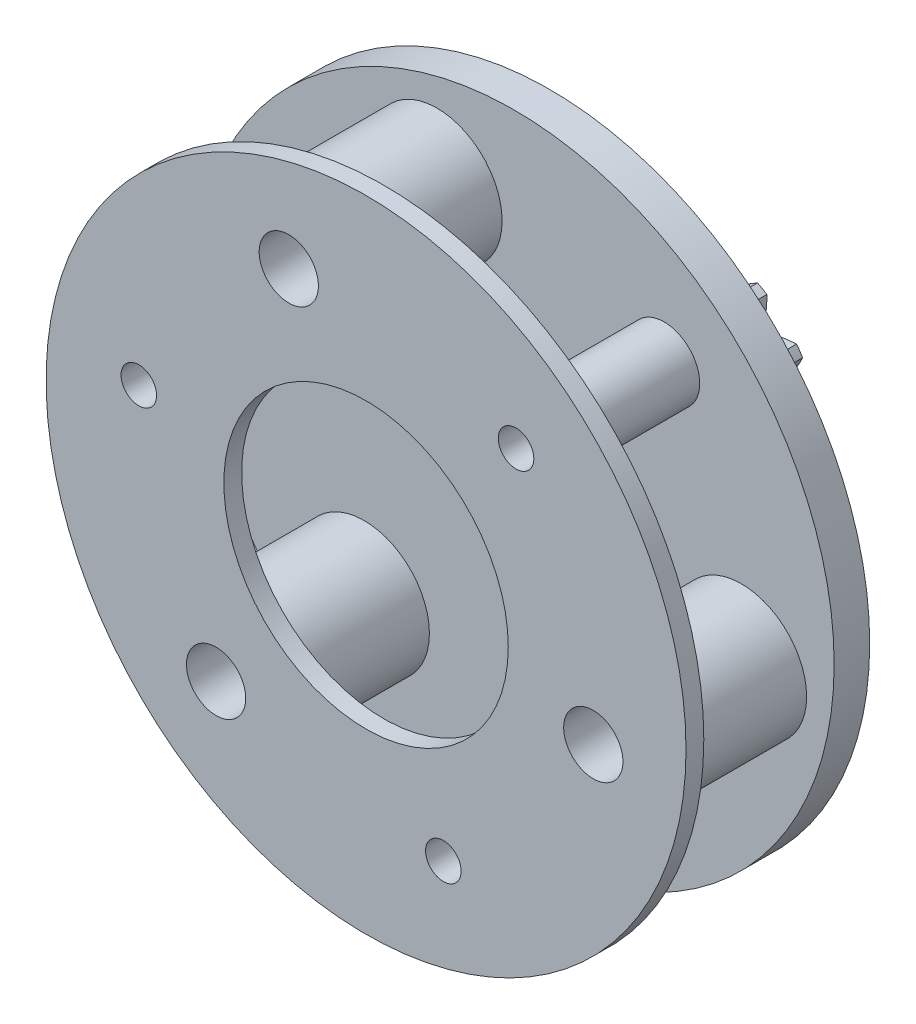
ISO-10303-21;
HEADER;
FILE_DESCRIPTION(('STEP AP214'),'2;1');
FILE_NAME('part.step','',(''),(''),'','','');
FILE_SCHEMA(('AUTOMOTIVE_DESIGN { 1 0 10303 214 1 1 1 1 }'));
ENDSEC;
DATA;
#1=APPLICATION_CONTEXT('core data for automotive mechanical design processes');
#2=APPLICATION_PROTOCOL_DEFINITION('international standard','automotive_design',2000,#1);
#3=PRODUCT_CONTEXT('',#1,'mechanical');
#4=PRODUCT('Part','Part','',(#3));
#5=PRODUCT_RELATED_PRODUCT_CATEGORY('part','',(#4));
#6=PRODUCT_DEFINITION_FORMATION('','',#4);
#7=PRODUCT_DEFINITION_CONTEXT('part definition',#1,'design');
#8=PRODUCT_DEFINITION('design','',#6,#7);
#9=PRODUCT_DEFINITION_SHAPE('','',#8);
#10=(LENGTH_UNIT() NAMED_UNIT(*) SI_UNIT(.MILLI.,.METRE.));
#11=(NAMED_UNIT(*) PLANE_ANGLE_UNIT() SI_UNIT($,.RADIAN.));
#12=(NAMED_UNIT(*) SI_UNIT($,.STERADIAN.) SOLID_ANGLE_UNIT());
#13=UNCERTAINTY_MEASURE_WITH_UNIT(LENGTH_MEASURE(1.E-05),#10,'distance_accuracy_value','');
#14=(GEOMETRIC_REPRESENTATION_CONTEXT(3) GLOBAL_UNCERTAINTY_ASSIGNED_CONTEXT((#13)) GLOBAL_UNIT_ASSIGNED_CONTEXT((#10,
#11,#12)) REPRESENTATION_CONTEXT('',''));
#15=CARTESIAN_POINT('',(0.,0.,0.));
#16=DIRECTION('',(0.,0.,1.));
#17=DIRECTION('',(1.,0.,0.));
#18=AXIS2_PLACEMENT_3D('',#15,#16,#17);
#19=CARTESIAN_POINT('',(0.,0.,13.));
#20=DIRECTION('',(0.,0.,1.));
#21=DIRECTION('',(1.,0.,0.));
#22=AXIS2_PLACEMENT_3D('',#19,#20,#21);
#23=PLANE('',#22);
#24=CARTESIAN_POINT('',(0.,0.,13.));
#25=DIRECTION('',(0.,0.,1.));
#26=DIRECTION('',(1.,0.,0.));
#27=AXIS2_PLACEMENT_3D('',#24,#25,#26);
#28=CIRCLE('',#27,27.);
#29=CARTESIAN_POINT('',(27.,0.,13.));
#30=VERTEX_POINT('',#29);
#31=EDGE_CURVE('E1242',#30,#30,#28,.T.);
#32=ORIENTED_EDGE('',*,*,#31,.F.);
#33=EDGE_LOOP('',(#32));
#34=FACE_BOUND('',#33,.T.);
#35=CARTESIAN_POINT('',(-6.52099198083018,18.3773410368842,13.));
#36=DIRECTION('',(0.,0.,1.));
#37=DIRECTION('',(1.,0.,0.));
#38=AXIS2_PLACEMENT_3D('',#35,#36,#37);
#39=CIRCLE('',#38,2.5);
#40=CARTESIAN_POINT('',(-4.02099198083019,18.3773410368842,13.));
#41=VERTEX_POINT('',#40);
#42=EDGE_CURVE('E1185',#41,#41,#39,.T.);
#43=ORIENTED_EDGE('',*,*,#42,.T.);
#44=EDGE_LOOP('',(#43));
#45=FACE_BOUND('',#44,.T.);
#46=CARTESIAN_POINT('',(12.654748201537,14.8360152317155,13.));
#47=DIRECTION('',(0.,0.,1.));
#48=DIRECTION('',(1.,0.,0.));
#49=AXIS2_PLACEMENT_3D('',#46,#47,#48);
#50=CIRCLE('',#49,1.5);
#51=CARTESIAN_POINT('',(14.154748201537,14.8360152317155,13.));
#52=VERTEX_POINT('',#51);
#53=EDGE_CURVE('E1179',#52,#52,#50,.T.);
#54=ORIENTED_EDGE('',*,*,#53,.T.);
#55=EDGE_LOOP('',(#54));
#56=FACE_BOUND('',#55,.T.);
#57=CARTESIAN_POINT('',(-12.6547482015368,-14.8360152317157,13.));
#58=DIRECTION('',(0.,0.,1.));
#59=DIRECTION('',(1.,0.,0.));
#60=AXIS2_PLACEMENT_3D('',#57,#58,#59);
#61=CIRCLE('',#60,2.5);
#62=CARTESIAN_POINT('',(-10.1547482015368,-14.8360152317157,13.));
#63=VERTEX_POINT('',#62);
#64=EDGE_CURVE('E1173',#63,#63,#61,.T.);
#65=ORIENTED_EDGE('',*,*,#64,.T.);
#66=EDGE_LOOP('',(#65));
#67=FACE_BOUND('',#66,.T.);
#68=CARTESIAN_POINT('',(-19.1757401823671,3.54132580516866,13.));
#69=DIRECTION('',(0.,0.,1.));
#70=DIRECTION('',(1.,0.,0.));
#71=AXIS2_PLACEMENT_3D('',#68,#69,#70);
#72=CIRCLE('',#71,1.5);
#73=CARTESIAN_POINT('',(-17.6757401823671,3.54132580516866,13.));
#74=VERTEX_POINT('',#73);
#75=EDGE_CURVE('E1167',#74,#74,#72,.T.);
#76=ORIENTED_EDGE('',*,*,#75,.T.);
#77=EDGE_LOOP('',(#76));
#78=FACE_BOUND('',#77,.T.);
#79=CARTESIAN_POINT('',(19.1757401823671,-3.54132580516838,13.));
#80=DIRECTION('',(0.,0.,1.));
#81=DIRECTION('',(1.,0.,0.));
#82=AXIS2_PLACEMENT_3D('',#79,#80,#81);
#83=CIRCLE('',#82,2.5);
#84=CARTESIAN_POINT('',(21.6757401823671,-3.54132580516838,13.));
#85=VERTEX_POINT('',#84);
#86=EDGE_CURVE('E1161',#85,#85,#83,.T.);
#87=ORIENTED_EDGE('',*,*,#86,.T.);
#88=EDGE_LOOP('',(#87));
#89=FACE_BOUND('',#88,.T.);
#90=CARTESIAN_POINT('',(6.52099198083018,-18.3773410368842,13.));
#91=DIRECTION('',(0.,0.,1.));
#92=DIRECTION('',(1.,0.,0.));
#93=AXIS2_PLACEMENT_3D('',#90,#91,#92);
#94=CIRCLE('',#93,1.5);
#95=CARTESIAN_POINT('',(8.02099198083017,-18.3773410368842,13.));
#96=VERTEX_POINT('',#95);
#97=EDGE_CURVE('E1155',#96,#96,#94,.T.);
#98=ORIENTED_EDGE('',*,*,#97,.T.);
#99=EDGE_LOOP('',(#98));
#100=FACE_BOUND('',#99,.T.);
#101=CARTESIAN_POINT('',(0.,0.,13.));
#102=DIRECTION('',(0.,0.,1.));
#103=DIRECTION('',(1.,0.,0.));
#104=AXIS2_PLACEMENT_3D('',#101,#102,#103);
#105=CIRCLE('',#104,8.24999999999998);
#106=CARTESIAN_POINT('',(-1.83579770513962,8.04315527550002,13.));
#107=VERTEX_POINT('',#106);
#108=CARTESIAN_POINT('',(-0.50294228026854,8.23465537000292,13.));
#109=VERTEX_POINT('',#108);
#110=EDGE_CURVE('E546',#107,#109,#105,.F.);
#111=ORIENTED_EDGE('',*,*,#110,.F.);
#112=CARTESIAN_POINT('',(-2.00898911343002,6.05017253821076,13.));
#113=CARTESIAN_POINT('',(-1.99003245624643,6.12240859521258,13.));
#114=CARTESIAN_POINT('',(-1.85696825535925,6.62946176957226,13.));
#115=CARTESIAN_POINT('',(-1.4103897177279,7.32951235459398,13.));
#116=CARTESIAN_POINT('',(-2.03836606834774,8.42536142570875,13.));
#117=CARTESIAN_POINT('',(-2.62207245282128,8.89259700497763,13.));
#118=CARTESIAN_POINT('',(-3.07257158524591,9.25320505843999,13.));
#119=B_SPLINE_CURVE_WITH_KNOTS('',3,(#112,#113,#114,#115,#116,#117,#118),.UNSPECIFIED.,.F.,.F.,
(4,1,1,1,4),(0.,0.0589679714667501,0.413919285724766,0.547668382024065,1.),.UNSPECIFIED.);
#120=CARTESIAN_POINT('',(-3.07257158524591,9.25320505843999,13.));
#121=VERTEX_POINT('',#120);
#122=EDGE_CURVE('E556',#107,#121,#119,.T.);
#123=ORIENTED_EDGE('',*,*,#122,.T.);
#124=CARTESIAN_POINT('',(0.,0.,13.));
#125=DIRECTION('',(0.,0.,1.));
#126=DIRECTION('',(-0.222520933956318,0.974927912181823,0.));
#127=AXIS2_PLACEMENT_3D('',#124,#125,#126);
#128=CIRCLE('',#127,9.75);
#129=CARTESIAN_POINT('',(-3.91860195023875,8.92788097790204,13.));
#130=VERTEX_POINT('',#129);
#131=EDGE_CURVE('E567',#121,#130,#128,.T.);
#132=ORIENTED_EDGE('',*,*,#131,.T.);
#133=CARTESIAN_POINT('',(-3.91860195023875,8.92788097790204,13.));
#134=CARTESIAN_POINT('',(-4.01143318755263,8.35834608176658,13.));
#135=CARTESIAN_POINT('',(-4.13171352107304,7.62040646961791,13.));
#136=CARTESIAN_POINT('',(-3.86369199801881,6.38614395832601,13.));
#137=CARTESIAN_POINT('',(-3.06313774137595,6.16565338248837,13.));
#138=CARTESIAN_POINT('',(-2.62463325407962,5.8783855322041,13.));
#139=CARTESIAN_POINT('',(-2.56216281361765,5.83746063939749,13.));
#140=B_SPLINE_CURVE_WITH_KNOTS('',3,(#133,#134,#135,#136,#137,#138,#139),.UNSPECIFIED.,.F.,.F.,
(4,1,1,1,4),(0.,0.452331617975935,0.586080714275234,0.94103202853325,1.),.UNSPECIFIED.);
#141=CARTESIAN_POINT('',(-3.38792805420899,6.28002129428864,13.));
#142=VERTEX_POINT('',#141);
#143=EDGE_CURVE('E570',#130,#142,#140,.T.);
#144=ORIENTED_EDGE('',*,*,#143,.T.);
#145=CARTESIAN_POINT('',(-3.62660390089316,5.84066512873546,13.));
#146=DIRECTION('',(0.,0.,1.));
#147=DIRECTION('',(1.,0.,0.));
#148=AXIS2_PLACEMENT_3D('',#145,#146,#147);
#149=CIRCLE('',#148,0.5);
#150=CARTESIAN_POINT('',(-3.36285088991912,5.41588948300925,13.));
#151=VERTEX_POINT('',#150);
#152=EDGE_CURVE('E1469',#142,#151,#149,.F.);
#153=ORIENTED_EDGE('',*,*,#152,.T.);
#154=CARTESIAN_POINT('',(0.,0.,13.));
#155=DIRECTION('',(0.,0.,1.));
#156=DIRECTION('',(1.,0.,0.));
#157=AXIS2_PLACEMENT_3D('',#154,#155,#156);
#158=CIRCLE('',#157,6.375);
#159=CARTESIAN_POINT('',(-3.74206004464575,5.16116378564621,13.));
#160=VERTEX_POINT('',#159);
#161=EDGE_CURVE('E1818',#151,#160,#158,.T.);
#162=ORIENTED_EDGE('',*,*,#161,.T.);
#163=CARTESIAN_POINT('',(-4.03555495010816,5.56596094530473,13.));
#164=DIRECTION('',(0.,0.,1.));
#165=DIRECTION('',(1.,0.,0.));
#166=AXIS2_PLACEMENT_3D('',#163,#164,#165);
#167=CIRCLE('',#166,0.5);
#168=CARTESIAN_POINT('',(-4.53254177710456,5.51115133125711,13.));
#169=VERTEX_POINT('',#168);
#170=EDGE_CURVE('E1497',#160,#169,#167,.F.);
#171=ORIENTED_EDGE('',*,*,#170,.T.);
#172=CARTESIAN_POINT('',(-4.43510813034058,4.57934939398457,13.));
#173=CARTESIAN_POINT('',(-4.44937082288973,4.65265681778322,13.));
#174=CARTESIAN_POINT('',(-4.54948624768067,5.167230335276,13.));
#175=CARTESIAN_POINT('',(-4.45087345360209,5.99171728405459,13.));
#176=CARTESIAN_POINT('',(-5.49213168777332,6.70657445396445,13.));
#177=CARTESIAN_POINT('',(-6.22075888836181,6.87427845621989,13.));
#178=CARTESIAN_POINT('',(-6.7831065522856,7.00371083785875,13.));
#179=B_SPLINE_CURVE_WITH_KNOTS('',3,(#172,#173,#174,#175,#176,#177,#178),.UNSPECIFIED.,.F.,.F.,
(4,1,1,1,4),(0.,0.0589679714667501,0.413919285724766,0.547668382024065,1.),.UNSPECIFIED.);
#180=CARTESIAN_POINT('',(-6.7831065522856,7.00371083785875,13.));
#181=VERTEX_POINT('',#180);
#182=EDGE_CURVE('E1441',#169,#181,#179,.T.);
#183=ORIENTED_EDGE('',*,*,#182,.T.);
#184=CARTESIAN_POINT('',(0.,0.,13.));
#185=DIRECTION('',(0.,0.,1.));
#186=DIRECTION('',(-0.623489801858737,0.781831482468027,0.));
#187=AXIS2_PLACEMENT_3D('',#184,#185,#186);
#188=CIRCLE('',#187,9.75);
#189=CARTESIAN_POINT('',(-7.40420074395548,6.34352515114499,13.));
#190=VERTEX_POINT('',#189);
#191=EDGE_CURVE('E1101',#181,#190,#188,.T.);
#192=ORIENTED_EDGE('',*,*,#191,.T.);
#193=CARTESIAN_POINT('',(-7.40420074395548,6.34352515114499,13.));
#194=CARTESIAN_POINT('',(-7.24072686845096,5.79011397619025,13.));
#195=CARTESIAN_POINT('',(-7.02891570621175,5.07306567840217,13.));
#196=CARTESIAN_POINT('',(-6.25191022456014,4.07732376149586,13.));
#197=CARTESIAN_POINT('',(-5.43496848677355,4.22601609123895,13.));
#198=CARTESIAN_POINT('',(-4.91524874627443,4.15745666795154,13.));
#199=CARTESIAN_POINT('',(-4.84120817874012,4.14768952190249,13.));
#200=B_SPLINE_CURVE_WITH_KNOTS('',3,(#193,#194,#195,#196,#197,#198,#199),.UNSPECIFIED.,.F.,.F.,
(4,1,1,1,4),(0.,0.452331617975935,0.586080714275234,0.94103202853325,1.),.UNSPECIFIED.);
#201=CARTESIAN_POINT('',(-5.77721682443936,4.18813678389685,13.));
#202=VERTEX_POINT('',#201);
#203=EDGE_CURVE('E1093',#190,#202,#200,.T.);
#204=ORIENTED_EDGE('',*,*,#203,.T.);
#205=CARTESIAN_POINT('',(-5.8016268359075,3.68873298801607,13.));
#206=DIRECTION('',(0.,0.,1.));
#207=DIRECTION('',(1.,0.,0.));
#208=AXIS2_PLACEMENT_3D('',#205,#206,#207);
#209=CIRCLE('',#208,0.5);
#210=CARTESIAN_POINT('',(-5.37969033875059,3.42046149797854,13.));
#211=VERTEX_POINT('',#210);
#212=EDGE_CURVE('E1492',#202,#211,#209,.F.);
#213=ORIENTED_EDGE('',*,*,#212,.T.);
#214=CARTESIAN_POINT('',(-5.61082464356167,3.02642888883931,13.));
#215=VERTEX_POINT('',#214);
#216=EDGE_CURVE('E1826',#211,#215,#158,.T.);
#217=ORIENTED_EDGE('',*,*,#216,.T.);
#218=CARTESIAN_POINT('',(-6.05088932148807,3.26379586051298,13.));
#219=DIRECTION('',(0.,0.,1.));
#220=DIRECTION('',(1.,0.,0.));
#221=AXIS2_PLACEMENT_3D('',#218,#219,#220);
#222=CIRCLE('',#221,0.5);
#223=CARTESIAN_POINT('',(-6.47487798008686,2.99877960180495,13.));
#224=VERTEX_POINT('',#223);
#225=EDGE_CURVE('E1517',#215,#224,#222,.F.);
#226=ORIENTED_EDGE('',*,*,#225,.T.);
#227=CARTESIAN_POINT('',(-5.98279958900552,2.20152994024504,13.));
#228=CARTESIAN_POINT('',(-6.0274567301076,2.26138929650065,13.));
#229=CARTESIAN_POINT('',(-6.34092269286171,2.68156556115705,13.));
#230=CARTESIAN_POINT('',(-6.60980711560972,3.46718912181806,13.));
#231=CARTESIAN_POINT('',(-7.85811326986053,3.65946816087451,13.));
#232=CARTESIAN_POINT('',(-8.58734773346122,3.49442475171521,13.));
#233=CARTESIAN_POINT('',(-9.15016407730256,3.36704579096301,13.));
#234=B_SPLINE_CURVE_WITH_KNOTS('',3,(#227,#228,#229,#230,#231,#232,#233),.UNSPECIFIED.,.F.,.F.,
(4,1,1,1,4),(0.,0.0589679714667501,0.413919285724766,0.547668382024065,1.),.UNSPECIFIED.);
#235=CARTESIAN_POINT('',(-9.15016407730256,3.36704579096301,13.));
#236=VERTEX_POINT('',#235);
#237=EDGE_CURVE('E1064',#224,#236,#234,.T.);
#238=ORIENTED_EDGE('',*,*,#237,.T.);
#239=CARTESIAN_POINT('',(0.,0.,13.));
#240=DIRECTION('',(0.,0.,1.));
#241=DIRECTION('',(-0.900968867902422,0.433883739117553,0.));
#242=AXIS2_PLACEMENT_3D('',#239,#240,#241);
#243=CIRCLE('',#242,9.75);
#244=CARTESIAN_POINT('',(-9.42330677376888,2.5027563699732,13.));
#245=VERTEX_POINT('',#244);
#246=EDGE_CURVE('E1073',#236,#245,#243,.T.);
#247=ORIENTED_EDGE('',*,*,#246,.T.);
#248=CARTESIAN_POINT('',(-9.42330677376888,2.5027563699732,13.));
#249=CARTESIAN_POINT('',(-9.03590579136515,2.07507878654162,13.));
#250=CARTESIAN_POINT('',(-8.53395493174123,1.52094201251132,13.));
#251=CARTESIAN_POINT('',(-7.4018609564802,0.960939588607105,13.));
#252=CARTESIAN_POINT('',(-6.73033706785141,1.44936448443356,13.));
#253=CARTESIAN_POINT('',(-6.2323389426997,1.61309252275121,13.));
#254=CARTESIAN_POINT('',(-6.1613928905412,1.63641762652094,13.));
#255=B_SPLINE_CURVE_WITH_KNOTS('',3,(#248,#249,#250,#251,#252,#253,#254),.UNSPECIFIED.,.F.,.F.,
(4,1,1,1,4),(0.,0.452331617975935,0.586080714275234,0.94103202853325,1.),.UNSPECIFIED.);
#256=CARTESIAN_POINT('',(-7.0222569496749,1.26674041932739,13.));
#257=VERTEX_POINT('',#256);
#258=EDGE_CURVE('E1413',#245,#257,#255,.T.);
#259=ORIENTED_EDGE('',*,*,#258,.T.);
#260=CARTESIAN_POINT('',(-6.82756642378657,0.806202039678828,13.));
#261=DIRECTION('',(0.,0.,1.));
#262=DIRECTION('',(1.,0.,0.));
#263=AXIS2_PLACEMENT_3D('',#260,#261,#262);
#264=CIRCLE('',#263,0.5);
#265=CARTESIAN_POINT('',(-6.33101613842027,0.747569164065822,13.));
#266=VERTEX_POINT('',#265);
#267=EDGE_CURVE('E1512',#257,#266,#264,.F.);
#268=ORIENTED_EDGE('',*,*,#267,.T.);
#269=CARTESIAN_POINT('',(-6.36829660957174,0.292272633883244,13.));
#270=VERTEX_POINT('',#269);
#271=EDGE_CURVE('E1829',#266,#270,#158,.T.);
#272=ORIENTED_EDGE('',*,*,#271,.T.);
#273=CARTESIAN_POINT('',(-6.86777085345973,0.315195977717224,13.));
#274=DIRECTION('',(0.,0.,1.));
#275=DIRECTION('',(1.,0.,0.));
#276=AXIS2_PLACEMENT_3D('',#273,#274,#275);
#277=CIRCLE('',#276,0.5);
#278=CARTESIAN_POINT('',(-7.13478518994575,-0.107537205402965,13.));
#279=VERTEX_POINT('',#278);
#280=EDGE_CURVE('E1537',#270,#279,#277,.F.);
#281=ORIENTED_EDGE('',*,*,#280,.T.);
#282=CARTESIAN_POINT('',(-6.34552421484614,-0.612329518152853,13.));
#283=CARTESIAN_POINT('',(-6.41173091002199,-0.577774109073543,13.));
#284=CARTESIAN_POINT('',(-6.87646163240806,-0.335216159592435,13.));
#285=CARTESIAN_POINT('',(-7.45958741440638,0.255941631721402,13.));
#286=CARTESIAN_POINT('',(-8.6676991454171,-0.112440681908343,13.));
#287=CARTESIAN_POINT('',(-9.2531070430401,-0.577542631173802,13.));
#288=CARTESIAN_POINT('',(-9.70491938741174,-0.936503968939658,13.));
#289=B_SPLINE_CURVE_WITH_KNOTS('',3,(#282,#283,#284,#285,#286,#287,#288),.UNSPECIFIED.,.F.,.F.,
(4,1,1,1,4),(0.,0.0589679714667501,0.413919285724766,0.547668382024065,1.),.UNSPECIFIED.);
#290=CARTESIAN_POINT('',(-9.70491938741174,-0.936503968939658,13.));
#291=VERTEX_POINT('',#290);
#292=EDGE_CURVE('E1396',#279,#291,#289,.T.);
#293=ORIENTED_EDGE('',*,*,#292,.T.);
#294=CARTESIAN_POINT('',(0.,0.,13.));
#295=DIRECTION('',(0.,0.,1.));
#296=DIRECTION('',(-1.,0.,0.));
#297=AXIS2_PLACEMENT_3D('',#294,#295,#296);
#298=CIRCLE('',#297,9.75);
#299=CARTESIAN_POINT('',(-9.57601132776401,-1.83371400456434,13.));
#300=VERTEX_POINT('',#299);
#301=EDGE_CURVE('E1040',#291,#300,#298,.T.);
#302=ORIENTED_EDGE('',*,*,#301,.T.);
#303=CARTESIAN_POINT('',(-9.57601132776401,-1.83371400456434,13.));
#304=CARTESIAN_POINT('',(-9.04141275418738,-2.05095120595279,13.));
#305=CARTESIAN_POINT('',(-8.34873972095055,-2.33242287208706,13.));
#306=CARTESIAN_POINT('',(-7.08578234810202,-2.34577045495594,13.));
#307=CARTESIAN_POINT('',(-6.692679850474,-1.6143515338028,13.));
#308=CARTESIAN_POINT('',(-6.31503797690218,-1.25076437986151,13.));
#309=CARTESIAN_POINT('',(-6.2612381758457,-1.19896684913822,13.));
#310=B_SPLINE_CURVE_WITH_KNOTS('',3,(#303,#304,#305,#306,#307,#308,#309),.UNSPECIFIED.,.F.,.F.,
(4,1,1,1,4),(0.,0.452331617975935,0.586080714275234,0.94103202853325,1.),.UNSPECIFIED.);
#311=CARTESIAN_POINT('',(-6.8764529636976,-1.90554942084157,13.));
#312=VERTEX_POINT('',#311);
#313=EDGE_CURVE('E1032',#300,#312,#310,.T.);
#314=ORIENTED_EDGE('',*,*,#313,.T.);
#315=CARTESIAN_POINT('',(-6.5012227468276,-2.23600711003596,13.));
#316=DIRECTION('',(0.,0.,1.));
#317=DIRECTION('',(1.,0.,0.));
#318=AXIS2_PLACEMENT_3D('',#315,#316,#317);
#319=CIRCLE('',#318,0.5);
#320=CARTESIAN_POINT('',(-6.02840654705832,-2.07338841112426,13.));
#321=VERTEX_POINT('',#320);
#322=EDGE_CURVE('E1532',#312,#321,#319,.F.);
#323=ORIENTED_EDGE('',*,*,#322,.T.);
#324=CARTESIAN_POINT('',(-5.86444933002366,-2.49977180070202,13.));
#325=VERTEX_POINT('',#324);
#326=EDGE_CURVE('E1831',#321,#325,#158,.T.);
#327=ORIENTED_EDGE('',*,*,#326,.T.);
#328=CARTESIAN_POINT('',(-6.3244061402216,-2.69583233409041,13.));
#329=DIRECTION('',(0.,0.,1.));
#330=DIRECTION('',(1.,0.,0.));
#331=AXIS2_PLACEMENT_3D('',#328,#329,#330);
#332=CIRCLE('',#331,0.5);
#333=CARTESIAN_POINT('',(-6.38156069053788,-3.19255495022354,13.));
#334=VERTEX_POINT('',#333);
#335=EDGE_CURVE('E1557',#325,#334,#332,.F.);
#336=ORIENTED_EDGE('',*,*,#335,.T.);
#337=CARTESIAN_POINT('',(-5.4514399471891,-3.30490960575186,13.));
#338=CARTESIAN_POINT('',(-5.52608314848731,-3.30250226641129,13.));
#339=CARTESIAN_POINT('',(-6.05003301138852,-3.28560420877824,13.));
#340=CARTESIAN_POINT('',(-6.83190493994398,-3.0059982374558,13.));
#341=CARTESIAN_POINT('',(-7.76054090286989,-3.86207926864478,13.));
#342=CARTESIAN_POINT('',(-8.08617502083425,-4.5351206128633,13.));
#343=CARTESIAN_POINT('',(-8.33749638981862,-5.05456763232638,13.));
#344=B_SPLINE_CURVE_WITH_KNOTS('',3,(#337,#338,#339,#340,#341,#342,#343),.UNSPECIFIED.,.F.,.F.,
(4,1,1,1,4),(0.,0.0589679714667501,0.413919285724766,0.547668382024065,1.),.UNSPECIFIED.);
#345=CARTESIAN_POINT('',(-8.33749638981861,-5.05456763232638,13.));
#346=VERTEX_POINT('',#345);
#347=EDGE_CURVE('E1003',#334,#346,#344,.T.);
#348=ORIENTED_EDGE('',*,*,#347,.T.);
#349=CARTESIAN_POINT('',(0.,0.,13.));
#350=DIRECTION('',(0.,0.,1.));
#351=DIRECTION('',(-0.900968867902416,-0.433883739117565,0.));
#352=AXIS2_PLACEMENT_3D('',#349,#350,#351);
#353=CIRCLE('',#352,9.75);
#354=CARTESIAN_POINT('',(-7.83206939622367,-5.80699483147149,13.));
#355=VERTEX_POINT('',#354);
#356=EDGE_CURVE('E1012',#346,#355,#353,.T.);
#357=ORIENTED_EDGE('',*,*,#356,.T.);
#358=CARTESIAN_POINT('',(-7.83206939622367,-5.80699483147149,13.));
#359=CARTESIAN_POINT('',(-7.25615703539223,-5.77076515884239,13.));
#360=CARTESIAN_POINT('',(-6.50995421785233,-5.7238228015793,13.));
#361=CARTESIAN_POINT('',(-5.36627764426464,-5.18787189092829,13.));
#362=CARTESIAN_POINT('',(-5.32945530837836,-4.35832543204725,13.));
#363=CARTESIAN_POINT('',(-5.14696629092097,-3.86689205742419,13.));
#364=CARTESIAN_POINT('',(-5.12096845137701,-3.79688123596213,13.));
#365=B_SPLINE_CURVE_WITH_KNOTS('',3,(#358,#359,#360,#361,#362,#363,#364),.UNSPECIFIED.,.F.,.F.,
(4,1,1,1,4),(0.,0.452331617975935,0.586080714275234,0.94103202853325,1.),.UNSPECIFIED.);
#366=CARTESIAN_POINT('',(-5.36868313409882,-4.70042182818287,13.));
#367=VERTEX_POINT('',#366);
#368=EDGE_CURVE('E1368',#355,#367,#365,.T.);
#369=ORIENTED_EDGE('',*,*,#368,.T.);
#370=CARTESIAN_POINT('',(-4.88723217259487,-4.83534762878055,13.));
#371=DIRECTION('',(0.,0.,1.));
#372=DIRECTION('',(1.,0.,0.));
#373=AXIS2_PLACEMENT_3D('',#370,#371,#372);
#374=CIRCLE('',#373,0.5);
#375=CARTESIAN_POINT('',(-4.53179710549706,-4.48368598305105,13.));
#376=VERTEX_POINT('',#375);
#377=EDGE_CURVE('E1552',#367,#376,#374,.F.);
#378=ORIENTED_EDGE('',*,*,#377,.T.);
#379=CARTESIAN_POINT('',(-4.19907593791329,-4.79670577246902,13.));
#380=VERTEX_POINT('',#379);
#381=EDGE_CURVE('E1833',#376,#380,#158,.T.);
#382=ORIENTED_EDGE('',*,*,#381,.T.);
#383=CARTESIAN_POINT('',(-4.5284152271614,-5.17291798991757,13.));
#384=DIRECTION('',(0.,0.,1.));
#385=DIRECTION('',(1.,0.,0.));
#386=AXIS2_PLACEMENT_3D('',#383,#384,#385);
#387=CIRCLE('',#386,0.5);
#388=CARTESIAN_POINT('',(-4.36438983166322,-5.64524803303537,13.));
#389=VERTEX_POINT('',#388);
#390=EDGE_CURVE('E1577',#380,#389,#387,.F.);
#391=ORIENTED_EDGE('',*,*,#390,.T.);
#392=CARTESIAN_POINT('',(-3.47763114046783,-5.34291181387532,13.));
#393=CARTESIAN_POINT('',(-3.5459268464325,-5.37312934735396,13.));
#394=CARTESIAN_POINT('',(-4.02532115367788,-5.58523804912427,13.));
#395=CARTESIAN_POINT('',(-4.85107990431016,-5.67256328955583,13.));
#396=CARTESIAN_POINT('',(-5.3163123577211,-6.84678569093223,13.));
#397=CARTESIAN_POINT('',(-5.31767686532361,-7.59446233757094,13.));
#398=CARTESIAN_POINT('',(-5.31872997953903,-8.17151218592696,13.));
#399=B_SPLINE_CURVE_WITH_KNOTS('',3,(#392,#393,#394,#395,#396,#397,#398),.UNSPECIFIED.,.F.,.F.,
(4,1,1,1,4),(0.,0.0589679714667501,0.413919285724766,0.547668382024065,1.),.UNSPECIFIED.);
#400=CARTESIAN_POINT('',(-5.31872997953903,-8.17151218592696,13.));
#401=VERTEX_POINT('',#400);
#402=EDGE_CURVE('E1351',#389,#401,#399,.T.);
#403=ORIENTED_EDGE('',*,*,#402,.T.);
#404=CARTESIAN_POINT('',(0.,0.,13.));
#405=DIRECTION('',(0.,0.,1.));
#406=DIRECTION('',(-0.623489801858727,-0.781831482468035,0.));
#407=AXIS2_PLACEMENT_3D('',#404,#405,#406);
#408=CIRCLE('',#407,9.75);
#409=CARTESIAN_POINT('',(-4.53689006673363,-8.63012911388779,13.));
#410=VERTEX_POINT('',#409);
#411=EDGE_CURVE('E979',#401,#410,#408,.T.);
#412=ORIENTED_EDGE('',*,*,#411,.T.);
#413=CARTESIAN_POINT('',(-4.53689006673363,-8.63012911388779,13.));
#414=CARTESIAN_POINT('',(-4.03373042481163,-8.34760829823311,13.));
#415=CARTESIAN_POINT('',(-3.38179244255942,-7.98154942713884,13.));
#416=CARTESIAN_POINT('',(-2.58391583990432,-7.00245167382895,13.));
#417=CARTESIAN_POINT('',(-2.91066678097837,-6.23907952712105,13.));
#418=CARTESIAN_POINT('',(-2.95947480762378,-5.71713433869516,13.));
#419=CARTESIAN_POINT('',(-2.9664281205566,-5.64277672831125,13.));
#420=B_SPLINE_CURVE_WITH_KNOTS('',3,(#413,#414,#415,#416,#417,#418,#419),.UNSPECIFIED.,.F.,.F.,
(4,1,1,1,4),(0.,0.452331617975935,0.586080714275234,0.94103202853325,1.),.UNSPECIFIED.);
#421=CARTESIAN_POINT('',(-2.79757976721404,-6.56431804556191,13.));
#422=VERTEX_POINT('',#421);
#423=EDGE_CURVE('E971',#410,#422,#420,.T.);
#424=ORIENTED_EDGE('',*,*,#423,.T.);
#425=CARTESIAN_POINT('',(-2.30526532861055,-6.47698824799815,13.));
#426=DIRECTION('',(0.,0.,1.));
#427=DIRECTION('',(1.,0.,0.));
#428=AXIS2_PLACEMENT_3D('',#425,#426,#427);
#429=CIRCLE('',#428,0.5);
#430=CARTESIAN_POINT('',(-2.13760966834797,-6.00593455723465,13.));
#431=VERTEX_POINT('',#430);
#432=EDGE_CURVE('E1572',#422,#431,#429,.F.);
#433=ORIENTED_EDGE('',*,*,#432,.T.);
#434=CARTESIAN_POINT('',(-1.70202405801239,-6.1435933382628,13.));
#435=VERTEX_POINT('',#434);
#436=EDGE_CURVE('E1747',#431,#435,#158,.T.);
#437=ORIENTED_EDGE('',*,*,#436,.T.);
#438=CARTESIAN_POINT('',(-1.83551614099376,-6.62544379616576,13.));
#439=DIRECTION('',(0.,0.,1.));
#440=DIRECTION('',(1.,0.,0.));
#441=AXIS2_PLACEMENT_3D('',#438,#439,#440);
#442=CIRCLE('',#441,0.5);
#443=CARTESIAN_POINT('',(-1.48279804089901,-6.97983050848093,13.));
#444=VERTEX_POINT('',#443);
#445=EDGE_CURVE('E1597',#435,#444,#442,.F.);
#446=ORIENTED_EDGE('',*,*,#445,.T.);
#447=CARTESIAN_POINT('',(-0.815034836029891,-6.32268481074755,13.));
#448=CARTESIAN_POINT('',(-0.863456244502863,-6.37954226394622,13.));
#449=CARTESIAN_POINT('',(-1.20334507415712,-6.77864699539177,13.));
#450=CARTESIAN_POINT('',(-1.90943899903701,-7.21560761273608,13.));
#451=CARTESIAN_POINT('',(-1.81912294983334,-8.47540223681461,13.));
#452=CARTESIAN_POINT('',(-1.49594758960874,-9.1496276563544,13.));
#453=CARTESIAN_POINT('',(-1.24652386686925,-9.66998853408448,13.));
#454=B_SPLINE_CURVE_WITH_KNOTS('',3,(#447,#448,#449,#450,#451,#452,#453),.UNSPECIFIED.,.F.,.F.,
(4,1,1,1,4),(0.,0.0589679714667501,0.413919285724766,0.547668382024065,1.),.UNSPECIFIED.);
#455=CARTESIAN_POINT('',(-1.24652386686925,-9.66998853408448,13.));
#456=VERTEX_POINT('',#455);
#457=EDGE_CURVE('E942',#444,#456,#454,.T.);
#458=ORIENTED_EDGE('',*,*,#457,.T.);
#459=CARTESIAN_POINT('',(0.,0.,13.));
#460=DIRECTION('',(0.,0.,1.));
#461=DIRECTION('',(-0.222520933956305,-0.974927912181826,0.));
#462=AXIS2_PLACEMENT_3D('',#459,#460,#461);
#463=CIRCLE('',#462,9.75);
#464=CARTESIAN_POINT('',(-0.343124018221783,-9.74396048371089,13.));
#465=VERTEX_POINT('',#464);
#466=EDGE_CURVE('E951',#456,#465,#463,.T.);
#467=ORIENTED_EDGE('',*,*,#466,.T.);
#468=CARTESIAN_POINT('',(-0.343124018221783,-9.74396048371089,13.));
#469=CARTESIAN_POINT('',(-0.0123740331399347,-9.27110523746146,13.));
#470=CARTESIAN_POINT('',(0.416174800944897,-8.65843230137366,13.));
#471=CARTESIAN_POINT('',(0.710222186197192,-7.43011002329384,13.));
#472=CARTESIAN_POINT('',(0.0846149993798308,-6.88410740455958,13.));
#473=CARTESIAN_POINT('',(-0.185823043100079,-6.43502804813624,13.));
#474=CARTESIAN_POINT('',(-0.224350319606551,-6.37105108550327,13.));
#475=B_SPLINE_CURVE_WITH_KNOTS('',3,(#468,#469,#470,#471,#472,#473,#474),.UNSPECIFIED.,.F.,.F.,
(4,1,1,1,4),(0.,0.452331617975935,0.586080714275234,0.94103202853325,1.),.UNSPECIFIED.);
#476=CARTESIAN_POINT('',(0.327618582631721,-7.12807056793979,13.));
#477=VERTEX_POINT('',#476);
#478=EDGE_CURVE('E1323',#465,#477,#475,.T.);
#479=ORIENTED_EDGE('',*,*,#478,.T.);
#480=CARTESIAN_POINT('',(0.733287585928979,-6.83578190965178,13.));
#481=DIRECTION('',(0.,0.,1.));
#482=DIRECTION('',(1.,0.,0.));
#483=AXIS2_PLACEMENT_3D('',#480,#481,#482);
#484=CIRCLE('',#483,0.5);
#485=CARTESIAN_POINT('',(0.679957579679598,-6.33863413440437,13.));
#486=VERTEX_POINT('',#485);
#487=EDGE_CURVE('E1592',#477,#486,#484,.F.);
#488=ORIENTED_EDGE('',*,*,#487,.T.);
#489=CARTESIAN_POINT('',(1.13213456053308,-6.27366689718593,13.));
#490=VERTEX_POINT('',#489);
#491=EDGE_CURVE('E1745',#486,#490,#158,.T.);
#492=ORIENTED_EDGE('',*,*,#491,.T.);
#493=CARTESIAN_POINT('',(1.22092942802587,-6.76571920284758,13.));
#494=DIRECTION('',(0.,0.,1.));
#495=DIRECTION('',(1.,0.,0.));
#496=AXIS2_PLACEMENT_3D('',#493,#494,#495);
#497=CIRCLE('',#496,0.5);
#498=CARTESIAN_POINT('',(1.69248008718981,-6.93197194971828,13.));
#499=VERTEX_POINT('',#498);
#500=EDGE_CURVE('E1617',#490,#499,#497,.F.);
#501=ORIENTED_EDGE('',*,*,#500,.T.);
#502=CARTESIAN_POINT('',(2.00898911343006,-6.05017253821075,13.));
#503=CARTESIAN_POINT('',(1.99003245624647,-6.12240859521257,13.));
#504=CARTESIAN_POINT('',(1.85696825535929,-6.62946176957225,13.));
#505=CARTESIAN_POINT('',(1.41038971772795,-7.32951235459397,13.));
#506=CARTESIAN_POINT('',(2.03836606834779,-8.42536142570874,13.));
#507=CARTESIAN_POINT('',(2.62207245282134,-8.89259700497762,13.));
#508=CARTESIAN_POINT('',(3.07257158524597,-9.25320505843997,13.));
#509=B_SPLINE_CURVE_WITH_KNOTS('',3,(#502,#503,#504,#505,#506,#507,#508),.UNSPECIFIED.,.F.,.F.,
(4,1,1,1,4),(0.,0.0589679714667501,0.413919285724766,0.547668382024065,1.),.UNSPECIFIED.);
#510=CARTESIAN_POINT('',(3.07257158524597,-9.25320505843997,13.));
#511=VERTEX_POINT('',#510);
#512=EDGE_CURVE('E1306',#499,#511,#509,.T.);
#513=ORIENTED_EDGE('',*,*,#512,.T.);
#514=CARTESIAN_POINT('',(0.,0.,13.));
#515=DIRECTION('',(0.,0.,1.));
#516=DIRECTION('',(0.222520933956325,-0.974927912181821,0.));
#517=AXIS2_PLACEMENT_3D('',#514,#515,#516);
#518=CIRCLE('',#517,9.75);
#519=CARTESIAN_POINT('',(3.91860195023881,-8.92788097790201,13.));
#520=VERTEX_POINT('',#519);
#521=EDGE_CURVE('E918',#511,#520,#518,.T.);
#522=ORIENTED_EDGE('',*,*,#521,.T.);
#523=CARTESIAN_POINT('',(3.91860195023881,-8.92788097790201,13.));
#524=CARTESIAN_POINT('',(4.01143318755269,-8.35834608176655,13.));
#525=CARTESIAN_POINT('',(4.13171352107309,-7.62040646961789,13.));
#526=CARTESIAN_POINT('',(3.86369199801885,-6.38614395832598,13.));
#527=CARTESIAN_POINT('',(3.063137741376,-6.16565338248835,13.));
#528=CARTESIAN_POINT('',(2.62463325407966,-5.87838553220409,13.));
#529=CARTESIAN_POINT('',(2.56216281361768,-5.83746063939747,13.));
#530=B_SPLINE_CURVE_WITH_KNOTS('',3,(#523,#524,#525,#526,#527,#528,#529),.UNSPECIFIED.,.F.,.F.,
(4,1,1,1,4),(0.,0.452331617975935,0.586080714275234,0.94103202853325,1.),.UNSPECIFIED.);
#531=CARTESIAN_POINT('',(3.38792805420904,-6.28002129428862,13.));
#532=VERTEX_POINT('',#531);
#533=EDGE_CURVE('E910',#520,#532,#530,.T.);
#534=ORIENTED_EDGE('',*,*,#533,.T.);
#535=CARTESIAN_POINT('',(3.62660390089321,-5.84066512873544,13.));
#536=DIRECTION('',(0.,0.,1.));
#537=DIRECTION('',(1.,0.,0.));
#538=AXIS2_PLACEMENT_3D('',#535,#536,#537);
#539=CIRCLE('',#538,0.5);
#540=CARTESIAN_POINT('',(3.36285088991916,-5.41588948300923,13.));
#541=VERTEX_POINT('',#540);
#542=EDGE_CURVE('E1612',#532,#541,#539,.F.);
#543=ORIENTED_EDGE('',*,*,#542,.T.);
#544=CARTESIAN_POINT('',(3.74206004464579,-5.16116378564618,13.));
#545=VERTEX_POINT('',#544);
#546=EDGE_CURVE('E1743',#541,#545,#158,.T.);
#547=ORIENTED_EDGE('',*,*,#546,.T.);
#548=CARTESIAN_POINT('',(4.0355549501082,-5.5659609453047,13.));
#549=DIRECTION('',(0.,0.,1.));
#550=DIRECTION('',(1.,0.,0.));
#551=AXIS2_PLACEMENT_3D('',#548,#549,#550);
#552=CIRCLE('',#551,0.5);
#553=CARTESIAN_POINT('',(4.5325417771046,-5.51115133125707,13.));
#554=VERTEX_POINT('',#553);
#555=EDGE_CURVE('E1637',#545,#554,#552,.F.);
#556=ORIENTED_EDGE('',*,*,#555,.T.);
#557=CARTESIAN_POINT('',(4.43510813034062,-4.57934939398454,13.));
#558=CARTESIAN_POINT('',(4.44937082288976,-4.65265681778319,13.));
#559=CARTESIAN_POINT('',(4.54948624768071,-5.16723033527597,13.));
#560=CARTESIAN_POINT('',(4.45087345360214,-5.99171728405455,13.));
#561=CARTESIAN_POINT('',(5.49213168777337,-6.70657445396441,13.));
#562=CARTESIAN_POINT('',(6.22075888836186,-6.87427845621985,13.));
#563=CARTESIAN_POINT('',(6.78310655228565,-7.0037108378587,13.));
#564=B_SPLINE_CURVE_WITH_KNOTS('',3,(#557,#558,#559,#560,#561,#562,#563),.UNSPECIFIED.,.F.,.F.,
(4,1,1,1,4),(0.,0.0589679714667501,0.413919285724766,0.547668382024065,1.),.UNSPECIFIED.);
#565=CARTESIAN_POINT('',(6.78310655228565,-7.0037108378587,13.));
#566=VERTEX_POINT('',#565);
#567=EDGE_CURVE('E881',#554,#566,#564,.T.);
#568=ORIENTED_EDGE('',*,*,#567,.T.);
#569=CARTESIAN_POINT('',(0.,0.,13.));
#570=DIRECTION('',(0.,0.,1.));
#571=DIRECTION('',(0.623489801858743,-0.781831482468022,0.));
#572=AXIS2_PLACEMENT_3D('',#569,#570,#571);
#573=CIRCLE('',#572,9.75);
#574=CARTESIAN_POINT('',(7.40420074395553,-6.34352515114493,13.));
#575=VERTEX_POINT('',#574);
#576=EDGE_CURVE('E890',#566,#575,#573,.T.);
#577=ORIENTED_EDGE('',*,*,#576,.T.);
#578=CARTESIAN_POINT('',(7.40420074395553,-6.34352515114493,13.));
#579=CARTESIAN_POINT('',(7.24072686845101,-5.79011397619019,13.));
#580=CARTESIAN_POINT('',(7.02891570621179,-5.07306567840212,13.));
#581=CARTESIAN_POINT('',(6.25191022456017,-4.07732376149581,13.));
#582=CARTESIAN_POINT('',(5.43496848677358,-4.22601609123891,13.));
#583=CARTESIAN_POINT('',(4.91524874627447,-4.1574566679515,13.));
#584=CARTESIAN_POINT('',(4.84120817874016,-4.14768952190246,13.));
#585=B_SPLINE_CURVE_WITH_KNOTS('',3,(#578,#579,#580,#581,#582,#583,#584),.UNSPECIFIED.,.F.,.F.,
(4,1,1,1,4),(0.,0.452331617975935,0.586080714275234,0.94103202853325,1.),.UNSPECIFIED.);
#586=CARTESIAN_POINT('',(5.7772168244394,-4.1881367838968,13.));
#587=VERTEX_POINT('',#586);
#588=EDGE_CURVE('E1278',#575,#587,#585,.T.);
#589=ORIENTED_EDGE('',*,*,#588,.T.);
#590=CARTESIAN_POINT('',(5.80162683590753,-3.68873298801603,13.));
#591=DIRECTION('',(0.,0.,1.));
#592=DIRECTION('',(1.,0.,0.));
#593=AXIS2_PLACEMENT_3D('',#590,#591,#592);
#594=CIRCLE('',#593,0.5);
#595=CARTESIAN_POINT('',(5.37969033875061,-3.4204614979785,13.));
#596=VERTEX_POINT('',#595);
#597=EDGE_CURVE('E1632',#587,#596,#594,.F.);
#598=ORIENTED_EDGE('',*,*,#597,.T.);
#599=CARTESIAN_POINT('',(5.61082464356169,-3.02642888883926,13.));
#600=VERTEX_POINT('',#599);
#601=EDGE_CURVE('E1686',#596,#600,#158,.T.);
#602=ORIENTED_EDGE('',*,*,#601,.T.);
#603=CARTESIAN_POINT('',(6.0508893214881,-3.26379586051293,13.));
#604=DIRECTION('',(0.,0.,1.));
#605=DIRECTION('',(1.,0.,0.));
#606=AXIS2_PLACEMENT_3D('',#603,#604,#605);
#607=CIRCLE('',#606,0.5);
#608=CARTESIAN_POINT('',(6.47487798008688,-2.9987796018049,13.));
#609=VERTEX_POINT('',#608);
#610=EDGE_CURVE('E11',#600,#609,#607,.F.);
#611=ORIENTED_EDGE('',*,*,#610,.T.);
#612=CARTESIAN_POINT('',(5.98279958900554,-2.201529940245,13.));
#613=CARTESIAN_POINT('',(6.02745673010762,-2.26138929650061,13.));
#614=CARTESIAN_POINT('',(6.34092269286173,-2.68156556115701,13.));
#615=CARTESIAN_POINT('',(6.60980711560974,-3.46718912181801,13.));
#616=CARTESIAN_POINT('',(7.85811326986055,-3.65946816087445,13.));
#617=CARTESIAN_POINT('',(8.58734773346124,-3.49442475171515,13.));
#618=CARTESIAN_POINT('',(9.15016407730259,-3.36704579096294,13.));
#619=B_SPLINE_CURVE_WITH_KNOTS('',3,(#612,#613,#614,#615,#616,#617,#618),.UNSPECIFIED.,.F.,.F.,
(4,1,1,1,4),(0.,0.0589679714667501,0.413919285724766,0.547668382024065,1.),.UNSPECIFIED.);
#620=CARTESIAN_POINT('',(9.15016407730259,-3.36704579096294,13.));
#621=VERTEX_POINT('',#620);
#622=EDGE_CURVE('E1261',#609,#621,#619,.T.);
#623=ORIENTED_EDGE('',*,*,#622,.T.);
#624=CARTESIAN_POINT('',(0.,0.,13.));
#625=DIRECTION('',(0.,0.,1.));
#626=DIRECTION('',(0.900968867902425,-0.433883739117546,0.));
#627=AXIS2_PLACEMENT_3D('',#624,#625,#626);
#628=CIRCLE('',#627,9.75);
#629=CARTESIAN_POINT('',(9.4233067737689,-2.50275636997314,13.));
#630=VERTEX_POINT('',#629);
#631=EDGE_CURVE('E857',#621,#630,#628,.T.);
#632=ORIENTED_EDGE('',*,*,#631,.T.);
#633=CARTESIAN_POINT('',(9.4233067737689,-2.50275636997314,13.));
#634=CARTESIAN_POINT('',(9.03590579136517,-2.07507878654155,13.));
#635=CARTESIAN_POINT('',(8.53395493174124,-1.52094201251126,13.));
#636=CARTESIAN_POINT('',(7.4018609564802,-0.960939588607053,13.));
#637=CARTESIAN_POINT('',(6.73033706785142,-1.44936448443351,13.));
#638=CARTESIAN_POINT('',(6.23233894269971,-1.61309252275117,13.));
#639=CARTESIAN_POINT('',(6.16139289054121,-1.6364176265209,13.));
#640=B_SPLINE_CURVE_WITH_KNOTS('',3,(#633,#634,#635,#636,#637,#638,#639),.UNSPECIFIED.,.F.,.F.,
(4,1,1,1,4),(0.,0.452331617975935,0.586080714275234,0.94103202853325,1.),.UNSPECIFIED.);
#641=CARTESIAN_POINT('',(7.0222569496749,-1.26674041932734,13.));
#642=VERTEX_POINT('',#641);
#643=EDGE_CURVE('E849',#630,#642,#640,.T.);
#644=ORIENTED_EDGE('',*,*,#643,.T.);
#645=CARTESIAN_POINT('',(6.82756642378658,-0.806202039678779,13.));
#646=DIRECTION('',(0.,0.,1.));
#647=DIRECTION('',(1.,0.,0.));
#648=AXIS2_PLACEMENT_3D('',#645,#646,#647);
#649=CIRCLE('',#648,0.5);
#650=CARTESIAN_POINT('',(6.33101613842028,-0.747569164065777,13.));
#651=VERTEX_POINT('',#650);
#652=EDGE_CURVE('E1652',#642,#651,#649,.F.);
#653=ORIENTED_EDGE('',*,*,#652,.T.);
#654=CARTESIAN_POINT('',(6.36829660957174,-0.292272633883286,13.));
#655=VERTEX_POINT('',#654);
#656=EDGE_CURVE('E1658',#651,#655,#158,.T.);
#657=ORIENTED_EDGE('',*,*,#656,.T.);
#658=CARTESIAN_POINT('',(6.86777085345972,-0.31519597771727,13.));
#659=DIRECTION('',(0.,0.,1.));
#660=DIRECTION('',(1.,0.,0.));
#661=AXIS2_PLACEMENT_3D('',#658,#659,#660);
#662=CIRCLE('',#661,0.5);
#663=CARTESIAN_POINT('',(7.13478518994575,0.107537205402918,13.));
#664=VERTEX_POINT('',#663);
#665=EDGE_CURVE('E1767',#655,#664,#662,.F.);
#666=ORIENTED_EDGE('',*,*,#665,.T.);
#667=CARTESIAN_POINT('',(6.34552421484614,0.612329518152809,13.));
#668=CARTESIAN_POINT('',(6.41173091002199,0.577774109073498,13.));
#669=CARTESIAN_POINT('',(6.87646163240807,0.335216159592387,13.));
#670=CARTESIAN_POINT('',(7.45958741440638,-0.255941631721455,13.));
#671=CARTESIAN_POINT('',(8.6676991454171,0.112440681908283,13.));
#672=CARTESIAN_POINT('',(9.2531070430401,0.577542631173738,13.));
#673=CARTESIAN_POINT('',(9.70491938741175,0.93650396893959,13.));
#674=B_SPLINE_CURVE_WITH_KNOTS('',3,(#667,#668,#669,#670,#671,#672,#673),.UNSPECIFIED.,.F.,.F.,
(4,1,1,1,4),(0.,0.0589679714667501,0.413919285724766,0.547668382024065,1.),.UNSPECIFIED.);
#675=CARTESIAN_POINT('',(9.70491938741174,0.93650396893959,13.));
#676=VERTEX_POINT('',#675);
#677=EDGE_CURVE('E697',#664,#676,#674,.T.);
#678=ORIENTED_EDGE('',*,*,#677,.T.);
#679=CARTESIAN_POINT('',(0.,0.,13.));
#680=DIRECTION('',(0.,0.,1.));
#681=DIRECTION('',(1.,0.,0.));
#682=AXIS2_PLACEMENT_3D('',#679,#680,#681);
#683=CIRCLE('',#682,9.75);
#684=CARTESIAN_POINT('',(9.57601132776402,1.83371400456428,13.));
#685=VERTEX_POINT('',#684);
#686=EDGE_CURVE('E706',#676,#685,#683,.T.);
#687=ORIENTED_EDGE('',*,*,#686,.T.);
#688=CARTESIAN_POINT('',(9.57601132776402,1.83371400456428,13.));
#689=CARTESIAN_POINT('',(9.04141275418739,2.05095120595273,13.));
#690=CARTESIAN_POINT('',(8.34873972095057,2.332422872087,13.));
#691=CARTESIAN_POINT('',(7.08578234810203,2.34577045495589,13.));
#692=CARTESIAN_POINT('',(6.69267985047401,1.61435153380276,13.));
#693=CARTESIAN_POINT('',(6.31503797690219,1.25076437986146,13.));
#694=CARTESIAN_POINT('',(6.26123817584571,1.19896684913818,13.));
#695=B_SPLINE_CURVE_WITH_KNOTS('',3,(#688,#689,#690,#691,#692,#693,#694),.UNSPECIFIED.,.F.,.F.,
(4,1,1,1,4),(0.,0.452331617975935,0.586080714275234,0.94103202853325,1.),.UNSPECIFIED.);
#696=CARTESIAN_POINT('',(6.87645296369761,1.90554942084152,13.));
#697=VERTEX_POINT('',#696);
#698=EDGE_CURVE('E2707',#685,#697,#695,.T.);
#699=ORIENTED_EDGE('',*,*,#698,.T.);
#700=CARTESIAN_POINT('',(6.50122274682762,2.23600711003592,13.));
#701=DIRECTION('',(0.,0.,1.));
#702=DIRECTION('',(1.,0.,0.));
#703=AXIS2_PLACEMENT_3D('',#700,#701,#702);
#704=CIRCLE('',#703,0.5);
#705=CARTESIAN_POINT('',(6.02840654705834,2.07338841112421,13.));
#706=VERTEX_POINT('',#705);
#707=EDGE_CURVE('E1763',#697,#706,#704,.F.);
#708=ORIENTED_EDGE('',*,*,#707,.T.);
#709=CARTESIAN_POINT('',(5.86444933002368,2.49977180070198,13.));
#710=VERTEX_POINT('',#709);
#711=EDGE_CURVE('E1687',#706,#710,#158,.T.);
#712=ORIENTED_EDGE('',*,*,#711,.T.);
#713=CARTESIAN_POINT('',(6.32440614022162,2.69583233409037,13.));
#714=DIRECTION('',(0.,0.,1.));
#715=DIRECTION('',(1.,0.,0.));
#716=AXIS2_PLACEMENT_3D('',#713,#714,#715);
#717=CIRCLE('',#716,0.5);
#718=CARTESIAN_POINT('',(6.3815606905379,3.1925549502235,13.));
#719=VERTEX_POINT('',#718);
#720=EDGE_CURVE('E1785',#710,#719,#717,.F.);
#721=ORIENTED_EDGE('',*,*,#720,.T.);
#722=CARTESIAN_POINT('',(5.45143994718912,3.30490960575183,13.));
#723=CARTESIAN_POINT('',(5.52608314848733,3.30250226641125,13.));
#724=CARTESIAN_POINT('',(6.05003301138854,3.2856042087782,13.));
#725=CARTESIAN_POINT('',(6.831904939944,3.00599823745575,13.));
#726=CARTESIAN_POINT('',(7.76054090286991,3.86207926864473,13.));
#727=CARTESIAN_POINT('',(8.08617502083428,4.53512061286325,13.));
#728=CARTESIAN_POINT('',(8.33749638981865,5.05456763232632,13.));
#729=B_SPLINE_CURVE_WITH_KNOTS('',3,(#722,#723,#724,#725,#726,#727,#728),.UNSPECIFIED.,.F.,.F.,
(4,1,1,1,4),(0.,0.0589679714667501,0.413919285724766,0.547668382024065,1.),.UNSPECIFIED.);
#730=CARTESIAN_POINT('',(8.33749638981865,5.05456763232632,13.));
#731=VERTEX_POINT('',#730);
#732=EDGE_CURVE('E2720',#719,#731,#729,.T.);
#733=ORIENTED_EDGE('',*,*,#732,.T.);
#734=CARTESIAN_POINT('',(0.,0.,13.));
#735=DIRECTION('',(0.,0.,1.));
#736=DIRECTION('',(0.900968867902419,0.433883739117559,0.));
#737=AXIS2_PLACEMENT_3D('',#734,#735,#736);
#738=CIRCLE('',#737,9.75);
#739=CARTESIAN_POINT('',(7.83206939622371,5.80699483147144,13.));
#740=VERTEX_POINT('',#739);
#741=EDGE_CURVE('E673',#731,#740,#738,.T.);
#742=ORIENTED_EDGE('',*,*,#741,.T.);
#743=CARTESIAN_POINT('',(7.83206939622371,5.80699483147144,13.));
#744=CARTESIAN_POINT('',(7.25615703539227,5.77076515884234,13.));
#745=CARTESIAN_POINT('',(6.50995421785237,5.72382280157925,13.));
#746=CARTESIAN_POINT('',(5.36627764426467,5.18787189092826,13.));
#747=CARTESIAN_POINT('',(5.32945530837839,4.35832543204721,13.));
#748=CARTESIAN_POINT('',(5.146966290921,3.86689205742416,13.));
#749=CARTESIAN_POINT('',(5.12096845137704,3.7968812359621,13.));
#750=B_SPLINE_CURVE_WITH_KNOTS('',3,(#743,#744,#745,#746,#747,#748,#749),.UNSPECIFIED.,.F.,.F.,
(4,1,1,1,4),(0.,0.452331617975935,0.586080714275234,0.94103202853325,1.),.UNSPECIFIED.);
#751=CARTESIAN_POINT('',(5.36868313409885,4.70042182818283,13.));
#752=VERTEX_POINT('',#751);
#753=EDGE_CURVE('E665',#740,#752,#750,.T.);
#754=ORIENTED_EDGE('',*,*,#753,.T.);
#755=CARTESIAN_POINT('',(4.8872321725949,4.83534762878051,13.));
#756=DIRECTION('',(0.,0.,1.));
#757=DIRECTION('',(1.,0.,0.));
#758=AXIS2_PLACEMENT_3D('',#755,#756,#757);
#759=CIRCLE('',#758,0.5);
#760=CARTESIAN_POINT('',(4.53179710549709,4.48368598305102,13.));
#761=VERTEX_POINT('',#760);
#762=EDGE_CURVE('E1780',#752,#761,#759,.F.);
#763=ORIENTED_EDGE('',*,*,#762,.T.);
#764=CARTESIAN_POINT('',(4.19907593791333,4.79670577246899,13.));
#765=VERTEX_POINT('',#764);
#766=EDGE_CURVE('E1752',#761,#765,#158,.T.);
#767=ORIENTED_EDGE('',*,*,#766,.T.);
#768=CARTESIAN_POINT('',(4.52841522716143,5.17291798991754,13.));
#769=DIRECTION('',(0.,0.,1.));
#770=DIRECTION('',(1.,0.,0.));
#771=AXIS2_PLACEMENT_3D('',#768,#769,#770);
#772=CIRCLE('',#771,0.5);
#773=CARTESIAN_POINT('',(4.36438983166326,5.64524803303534,13.));
#774=VERTEX_POINT('',#773);
#775=EDGE_CURVE('E1804',#765,#774,#772,.F.);
#776=ORIENTED_EDGE('',*,*,#775,.T.);
#777=CARTESIAN_POINT('',(3.47763114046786,5.3429118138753,13.));
#778=CARTESIAN_POINT('',(3.54592684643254,5.37312934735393,13.));
#779=CARTESIAN_POINT('',(4.02532115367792,5.58523804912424,13.));
#780=CARTESIAN_POINT('',(4.8510799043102,5.6725632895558,13.));
#781=CARTESIAN_POINT('',(5.31631235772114,6.8467856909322,13.));
#782=CARTESIAN_POINT('',(5.31767686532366,7.59446233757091,13.));
#783=CARTESIAN_POINT('',(5.31872997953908,8.17151218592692,13.));
#784=B_SPLINE_CURVE_WITH_KNOTS('',3,(#777,#778,#779,#780,#781,#782,#783),.UNSPECIFIED.,.F.,.F.,
(4,1,1,1,4),(0.,0.0589679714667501,0.413919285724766,0.547668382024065,1.),.UNSPECIFIED.);
#785=CARTESIAN_POINT('',(5.31872997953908,8.17151218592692,13.));
#786=VERTEX_POINT('',#785);
#787=EDGE_CURVE('E636',#774,#786,#784,.T.);
#788=ORIENTED_EDGE('',*,*,#787,.T.);
#789=CARTESIAN_POINT('',(0.,0.,13.));
#790=DIRECTION('',(0.,0.,1.));
#791=DIRECTION('',(0.623489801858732,0.781831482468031,0.));
#792=AXIS2_PLACEMENT_3D('',#789,#790,#791);
#793=CIRCLE('',#792,9.75);
#794=CARTESIAN_POINT('',(4.53689006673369,8.63012911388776,13.));
#795=VERTEX_POINT('',#794);
#796=EDGE_CURVE('E645',#786,#795,#793,.T.);
#797=ORIENTED_EDGE('',*,*,#796,.T.);
#798=CARTESIAN_POINT('',(4.53689006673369,8.63012911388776,13.));
#799=CARTESIAN_POINT('',(4.03373042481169,8.34760829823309,13.));
#800=CARTESIAN_POINT('',(3.38179244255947,7.98154942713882,13.));
#801=CARTESIAN_POINT('',(2.58391583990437,7.00245167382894,13.));
#802=CARTESIAN_POINT('',(2.91066678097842,6.23907952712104,13.));
#803=CARTESIAN_POINT('',(2.95947480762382,5.71713433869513,13.));
#804=CARTESIAN_POINT('',(2.96642812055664,5.64277672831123,13.));
#805=B_SPLINE_CURVE_WITH_KNOTS('',3,(#798,#799,#800,#801,#802,#803,#804),.UNSPECIFIED.,.F.,.F.,
(4,1,1,1,4),(0.,0.452331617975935,0.586080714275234,0.94103202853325,1.),.UNSPECIFIED.);
#806=CARTESIAN_POINT('',(2.79757976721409,6.56431804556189,13.));
#807=VERTEX_POINT('',#806);
#808=EDGE_CURVE('E2750',#795,#807,#805,.T.);
#809=ORIENTED_EDGE('',*,*,#808,.T.);
#810=CARTESIAN_POINT('',(2.30526532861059,6.47698824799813,13.));
#811=DIRECTION('',(0.,0.,1.));
#812=DIRECTION('',(1.,0.,0.));
#813=AXIS2_PLACEMENT_3D('',#810,#811,#812);
#814=CIRCLE('',#813,0.5);
#815=CARTESIAN_POINT('',(2.13760966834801,6.00593455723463,13.));
#816=VERTEX_POINT('',#815);
#817=EDGE_CURVE('E1799',#807,#816,#814,.F.);
#818=ORIENTED_EDGE('',*,*,#817,.T.);
#819=CARTESIAN_POINT('',(1.70202405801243,6.14359333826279,13.));
#820=VERTEX_POINT('',#819);
#821=EDGE_CURVE('E1825',#816,#820,#158,.T.);
#822=ORIENTED_EDGE('',*,*,#821,.T.);
#823=CARTESIAN_POINT('',(1.8355161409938,6.62544379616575,13.));
#824=DIRECTION('',(0.,0.,1.));
#825=DIRECTION('',(1.,0.,0.));
#826=AXIS2_PLACEMENT_3D('',#823,#824,#825);
#827=CIRCLE('',#826,0.5);
#828=CARTESIAN_POINT('',(1.48279804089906,6.97983050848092,13.));
#829=VERTEX_POINT('',#828);
#830=EDGE_CURVE('E1814',#820,#829,#827,.F.);
#831=ORIENTED_EDGE('',*,*,#830,.T.);
#832=CARTESIAN_POINT('',(0.815034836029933,6.32268481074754,13.));
#833=CARTESIAN_POINT('',(0.863456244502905,6.37954226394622,13.));
#834=CARTESIAN_POINT('',(1.20334507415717,6.77864699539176,13.));
#835=CARTESIAN_POINT('',(1.90943899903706,7.21560761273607,13.));
#836=CARTESIAN_POINT('',(1.81912294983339,8.4754022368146,13.));
#837=CARTESIAN_POINT('',(1.4959475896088,9.14962765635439,13.));
#838=CARTESIAN_POINT('',(1.24652386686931,9.66998853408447,13.));
#839=B_SPLINE_CURVE_WITH_KNOTS('',3,(#832,#833,#834,#835,#836,#837,#838),.UNSPECIFIED.,.F.,.F.,
(4,1,1,1,4),(0.,0.0589679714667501,0.413919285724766,0.547668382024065,1.),.UNSPECIFIED.);
#840=CARTESIAN_POINT('',(1.24652386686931,9.66998853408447,13.));
#841=VERTEX_POINT('',#840);
#842=EDGE_CURVE('E1137',#829,#841,#839,.T.);
#843=ORIENTED_EDGE('',*,*,#842,.T.);
#844=CARTESIAN_POINT('',(0.,0.,13.));
#845=DIRECTION('',(0.,0.,1.));
#846=DIRECTION('',(0.222520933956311,0.974927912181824,0.));
#847=AXIS2_PLACEMENT_3D('',#844,#845,#846);
#848=CIRCLE('',#847,9.75);
#849=CARTESIAN_POINT('',(0.343124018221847,9.74396048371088,13.));
#850=VERTEX_POINT('',#849);
#851=EDGE_CURVE('E610',#841,#850,#848,.T.);
#852=ORIENTED_EDGE('',*,*,#851,.T.);
#853=CARTESIAN_POINT('',(0.343124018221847,9.74396048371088,13.));
#854=CARTESIAN_POINT('',(0.0123740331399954,9.27110523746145,13.));
#855=CARTESIAN_POINT('',(-0.41617480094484,8.65843230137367,13.));
#856=CARTESIAN_POINT('',(-0.710222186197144,7.43011002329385,13.));
#857=CARTESIAN_POINT('',(-0.084614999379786,6.88410740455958,13.));
#858=CARTESIAN_POINT('',(0.185823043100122,6.43502804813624,13.));
#859=CARTESIAN_POINT('',(0.224350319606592,6.37105108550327,13.));
#860=B_SPLINE_CURVE_WITH_KNOTS('',3,(#853,#854,#855,#856,#857,#858,#859),.UNSPECIFIED.,.F.,.F.,
(4,1,1,1,4),(0.,0.452331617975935,0.586080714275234,0.94103202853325,1.),.UNSPECIFIED.);
#861=EDGE_CURVE('E560',#850,#109,#860,.T.);
#862=ORIENTED_EDGE('',*,*,#861,.T.);
#863=EDGE_LOOP('',(#111,#123,#132,#144,#153,#162,#171,#183,#192,#204,#213,#217,#226,#238,#247,
#259,#268,#272,#281,#293,#302,#314,#323,#327,#336,#348,#357,#369,#378,#382,#391,#403,#412,#424,
#433,#437,#446,#458,#467,#479,#488,#492,#501,#513,#522,#534,#543,#547,#556,#568,#577,#589,#598,
#602,#611,#623,#632,#644,#653,#657,#666,#678,#687,#699,#708,#712,#721,#733,#742,#754,#763,#767,
#776,#788,#797,#809,#818,#822,#831,#843,#852,#862));
#864=FACE_BOUND('',#863,.T.);
#865=ADVANCED_FACE('F35',(#34,#45,#56,#67,#78,#89,#100,#864),#23,.F.);
#866=CARTESIAN_POINT('',(0.,0.,16.));
#867=DIRECTION('',(0.,0.,1.));
#868=DIRECTION('',(1.,0.,0.));
#869=AXIS2_PLACEMENT_3D('',#866,#867,#868);
#870=PLANE('',#869);
#871=CARTESIAN_POINT('',(0.,0.,16.));
#872=DIRECTION('',(0.,0.,1.));
#873=DIRECTION('',(1.,0.,0.));
#874=AXIS2_PLACEMENT_3D('',#871,#872,#873);
#875=CIRCLE('',#874,27.);
#876=CARTESIAN_POINT('',(27.,0.,16.));
#877=VERTEX_POINT('',#876);
#878=EDGE_CURVE('E1245',#877,#877,#875,.T.);
#879=ORIENTED_EDGE('',*,*,#878,.T.);
#880=EDGE_LOOP('',(#879));
#881=FACE_BOUND('',#880,.T.);
#882=CARTESIAN_POINT('',(0.,0.,16.));
#883=DIRECTION('',(0.,0.,1.));
#884=DIRECTION('',(1.,0.,0.));
#885=AXIS2_PLACEMENT_3D('',#882,#883,#884);
#886=CIRCLE('',#885,4.);
#887=CARTESIAN_POINT('',(4.,0.,16.));
#888=VERTEX_POINT('',#887);
#889=EDGE_CURVE('E1239',#888,#888,#886,.T.);
#890=ORIENTED_EDGE('',*,*,#889,.F.);
#891=EDGE_LOOP('',(#890));
#892=FACE_BOUND('',#891,.T.);
#893=CARTESIAN_POINT('',(6.52099198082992,-18.3773410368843,16.));
#894=DIRECTION('',(0.,0.,1.));
#895=DIRECTION('',(1.,0.,0.));
#896=AXIS2_PLACEMENT_3D('',#893,#894,#895);
#897=CIRCLE('',#896,3.);
#898=CARTESIAN_POINT('',(9.52099198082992,-18.3773410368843,16.));
#899=VERTEX_POINT('',#898);
#900=EDGE_CURVE('E1230',#899,#899,#897,.T.);
#901=ORIENTED_EDGE('',*,*,#900,.F.);
#902=EDGE_LOOP('',(#901));
#903=FACE_BOUND('',#902,.T.);
#904=CARTESIAN_POINT('',(19.1757401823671,-3.54132580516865,16.));
#905=DIRECTION('',(0.,0.,1.));
#906=DIRECTION('',(1.,0.,0.));
#907=AXIS2_PLACEMENT_3D('',#904,#905,#906);
#908=CIRCLE('',#907,5.5);
#909=CARTESIAN_POINT('',(24.6757401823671,-3.54132580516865,16.));
#910=VERTEX_POINT('',#909);
#911=EDGE_CURVE('E1224',#910,#910,#908,.T.);
#912=ORIENTED_EDGE('',*,*,#911,.F.);
#913=EDGE_LOOP('',(#912));
#914=FACE_BOUND('',#913,.T.);
#915=CARTESIAN_POINT('',(12.654748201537,14.8360152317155,16.));
#916=DIRECTION('',(0.,0.,1.));
#917=DIRECTION('',(-0.500000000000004,0.866025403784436,0.));
#918=AXIS2_PLACEMENT_3D('',#915,#916,#917);
#919=CIRCLE('',#918,3.);
#920=CARTESIAN_POINT('',(11.154748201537,17.4340914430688,16.));
#921=VERTEX_POINT('',#920);
#922=EDGE_CURVE('E1218',#921,#921,#919,.T.);
#923=ORIENTED_EDGE('',*,*,#922,.F.);
#924=EDGE_LOOP('',(#923));
#925=FACE_BOUND('',#924,.T.);
#926=CARTESIAN_POINT('',(-6.52099198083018,18.3773410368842,16.));
#927=DIRECTION('',(0.,0.,1.));
#928=DIRECTION('',(-0.500000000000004,0.866025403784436,0.));
#929=AXIS2_PLACEMENT_3D('',#926,#927,#928);
#930=CIRCLE('',#929,5.5);
#931=CARTESIAN_POINT('',(-9.27099198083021,23.1404807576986,16.));
#932=VERTEX_POINT('',#931);
#933=EDGE_CURVE('E1212',#932,#932,#930,.T.);
#934=ORIENTED_EDGE('',*,*,#933,.F.);
#935=EDGE_LOOP('',(#934));
#936=FACE_BOUND('',#935,.T.);
#937=CARTESIAN_POINT('',(-19.1757401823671,3.54132580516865,16.));
#938=DIRECTION('',(0.,0.,1.));
#939=DIRECTION('',(-0.499999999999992,-0.866025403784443,0.));
#940=AXIS2_PLACEMENT_3D('',#937,#938,#939);
#941=CIRCLE('',#940,3.);
#942=CARTESIAN_POINT('',(-20.675740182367,0.943249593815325,16.));
#943=VERTEX_POINT('',#942);
#944=EDGE_CURVE('E1206',#943,#943,#941,.T.);
#945=ORIENTED_EDGE('',*,*,#944,.F.);
#946=EDGE_LOOP('',(#945));
#947=FACE_BOUND('',#946,.T.);
#948=CARTESIAN_POINT('',(-12.6547482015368,-14.8360152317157,16.));
#949=DIRECTION('',(0.,0.,1.));
#950=DIRECTION('',(-0.499999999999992,-0.866025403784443,0.));
#951=AXIS2_PLACEMENT_3D('',#948,#949,#950);
#952=CIRCLE('',#951,5.5);
#953=CARTESIAN_POINT('',(-15.4047482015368,-19.5991549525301,16.));
#954=VERTEX_POINT('',#953);
#955=EDGE_CURVE('E1200',#954,#954,#952,.T.);
#956=ORIENTED_EDGE('',*,*,#955,.F.);
#957=EDGE_LOOP('',(#956));
#958=FACE_BOUND('',#957,.T.);
#959=ADVANCED_FACE('F721',(#881,#892,#903,#914,#925,#936,#947,#958),#870,.T.);
#960=CARTESIAN_POINT('',(0.,0.,0.));
#961=DIRECTION('',(0.,0.,1.));
#962=DIRECTION('',(1.,0.,0.));
#963=AXIS2_PLACEMENT_3D('',#960,#961,#962);
#964=PLANE('',#963);
#965=CARTESIAN_POINT('',(-2.00898911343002,6.05017253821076,0.));
#966=CARTESIAN_POINT('',(-1.99003245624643,6.12240859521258,0.));
#967=CARTESIAN_POINT('',(-1.85696825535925,6.62946176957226,0.));
#968=CARTESIAN_POINT('',(-1.4103897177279,7.32951235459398,0.));
#969=CARTESIAN_POINT('',(-2.03836606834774,8.42536142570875,0.));
#970=CARTESIAN_POINT('',(-2.62207245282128,8.89259700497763,0.));
#971=CARTESIAN_POINT('',(-3.07257158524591,9.25320505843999,0.));
#972=B_SPLINE_CURVE_WITH_KNOTS('',3,(#965,#966,#967,#968,#969,#970,#971),.UNSPECIFIED.,.F.,.F.,
(4,1,1,1,4),(0.,0.0589679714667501,0.413919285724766,0.547668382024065,1.),.UNSPECIFIED.);
#973=CARTESIAN_POINT('',(-1.83579770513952,8.04315527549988,0.));
#974=VERTEX_POINT('',#973);
#975=CARTESIAN_POINT('',(-3.07257158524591,9.25320505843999,0.));
#976=VERTEX_POINT('',#975);
#977=EDGE_CURVE('E579',#974,#976,#972,.T.);
#978=ORIENTED_EDGE('',*,*,#977,.F.);
#979=CARTESIAN_POINT('',(0.,0.,0.));
#980=DIRECTION('',(0.,0.,-1.));
#981=DIRECTION('',(-1.,0.,0.));
#982=AXIS2_PLACEMENT_3D('',#979,#980,#981);
#983=CIRCLE('',#982,8.24999999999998);
#984=CARTESIAN_POINT('',(-0.50294228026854,8.23465537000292,0.));
#985=VERTEX_POINT('',#984);
#986=EDGE_CURVE('E52',#974,#985,#983,.T.);
#987=ORIENTED_EDGE('',*,*,#986,.T.);
#988=CARTESIAN_POINT('',(0.343124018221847,9.74396048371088,0.));
#989=CARTESIAN_POINT('',(0.0123740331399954,9.27110523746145,0.));
#990=CARTESIAN_POINT('',(-0.41617480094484,8.65843230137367,0.));
#991=CARTESIAN_POINT('',(-0.710222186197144,7.43011002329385,0.));
#992=CARTESIAN_POINT('',(-0.084614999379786,6.88410740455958,0.));
#993=CARTESIAN_POINT('',(0.185823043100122,6.43502804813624,0.));
#994=CARTESIAN_POINT('',(0.224350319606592,6.37105108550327,0.));
#995=B_SPLINE_CURVE_WITH_KNOTS('',3,(#988,#989,#990,#991,#992,#993,#994),.UNSPECIFIED.,.F.,.F.,
(4,1,1,1,4),(0.,0.452331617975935,0.586080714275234,0.94103202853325,1.),.UNSPECIFIED.);
#996=CARTESIAN_POINT('',(0.343124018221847,9.74396048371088,0.));
#997=VERTEX_POINT('',#996);
#998=EDGE_CURVE('E1133',#997,#985,#995,.T.);
#999=ORIENTED_EDGE('',*,*,#998,.F.);
#1000=CARTESIAN_POINT('',(0.,0.,0.));
#1001=DIRECTION('',(0.,0.,1.));
#1002=DIRECTION('',(0.222520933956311,0.974927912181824,0.));
#1003=AXIS2_PLACEMENT_3D('',#1000,#1001,#1002);
#1004=CIRCLE('',#1003,9.75);
#1005=CARTESIAN_POINT('',(1.24652386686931,9.66998853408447,0.));
#1006=VERTEX_POINT('',#1005);
#1007=EDGE_CURVE('E1123',#1006,#997,#1004,.T.);
#1008=ORIENTED_EDGE('',*,*,#1007,.F.);
#1009=CARTESIAN_POINT('',(0.815034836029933,6.32268481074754,0.));
#1010=CARTESIAN_POINT('',(0.863456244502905,6.37954226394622,0.));
#1011=CARTESIAN_POINT('',(1.20334507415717,6.77864699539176,0.));
#1012=CARTESIAN_POINT('',(1.90943899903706,7.21560761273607,0.));
#1013=CARTESIAN_POINT('',(1.81912294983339,8.4754022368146,0.));
#1014=CARTESIAN_POINT('',(1.4959475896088,9.14962765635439,0.));
#1015=CARTESIAN_POINT('',(1.24652386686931,9.66998853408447,0.));
#1016=B_SPLINE_CURVE_WITH_KNOTS('',3,(#1009,#1010,#1011,#1012,#1013,#1014,#1015),.UNSPECIFIED.,
.F.,.F.,(4,1,1,1,4),(0.,0.0589679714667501,0.413919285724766,0.547668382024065,1.),.UNSPECIFIED.);
#1017=CARTESIAN_POINT('',(1.48279804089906,6.97983050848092,0.));
#1018=VERTEX_POINT('',#1017);
#1019=EDGE_CURVE('E1120',#1018,#1006,#1016,.T.);
#1020=ORIENTED_EDGE('',*,*,#1019,.F.);
#1021=CARTESIAN_POINT('',(1.8355161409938,6.62544379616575,0.));
#1022=DIRECTION('',(0.,0.,1.));
#1023=DIRECTION('',(1.,0.,0.));
#1024=AXIS2_PLACEMENT_3D('',#1021,#1022,#1023);
#1025=CIRCLE('',#1024,0.5);
#1026=CARTESIAN_POINT('',(1.70202405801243,6.14359333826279,0.));
#1027=VERTEX_POINT('',#1026);
#1028=EDGE_CURVE('E1812',#1018,#1027,#1025,.T.);
#1029=ORIENTED_EDGE('',*,*,#1028,.T.);
#1030=CARTESIAN_POINT('',(0.,0.,0.));
#1031=DIRECTION('',(0.,0.,1.));
#1032=DIRECTION('',(1.,0.,0.));
#1033=AXIS2_PLACEMENT_3D('',#1030,#1031,#1032);
#1034=CIRCLE('',#1033,6.375);
#1035=CARTESIAN_POINT('',(2.13760966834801,6.00593455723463,0.));
#1036=VERTEX_POINT('',#1035);
#1037=EDGE_CURVE('E1689',#1036,#1027,#1034,.T.);
#1038=ORIENTED_EDGE('',*,*,#1037,.F.);
#1039=CARTESIAN_POINT('',(2.30526532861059,6.47698824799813,0.));
#1040=DIRECTION('',(0.,0.,1.));
#1041=DIRECTION('',(1.,0.,0.));
#1042=AXIS2_PLACEMENT_3D('',#1039,#1040,#1041);
#1043=CIRCLE('',#1042,0.5);
#1044=CARTESIAN_POINT('',(2.79757976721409,6.56431804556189,0.));
#1045=VERTEX_POINT('',#1044);
#1046=EDGE_CURVE('E1797',#1036,#1045,#1043,.T.);
#1047=ORIENTED_EDGE('',*,*,#1046,.T.);
#1048=CARTESIAN_POINT('',(4.53689006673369,8.63012911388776,0.));
#1049=CARTESIAN_POINT('',(4.03373042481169,8.34760829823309,0.));
#1050=CARTESIAN_POINT('',(3.38179244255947,7.98154942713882,0.));
#1051=CARTESIAN_POINT('',(2.58391583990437,7.00245167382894,0.));
#1052=CARTESIAN_POINT('',(2.91066678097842,6.23907952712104,0.));
#1053=CARTESIAN_POINT('',(2.95947480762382,5.71713433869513,0.));
#1054=CARTESIAN_POINT('',(2.96642812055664,5.64277672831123,0.));
#1055=B_SPLINE_CURVE_WITH_KNOTS('',3,(#1048,#1049,#1050,#1051,#1052,#1053,#1054),.UNSPECIFIED.,
.F.,.F.,(4,1,1,1,4),(0.,0.452331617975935,0.586080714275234,0.94103202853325,1.),.UNSPECIFIED.);
#1056=CARTESIAN_POINT('',(4.53689006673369,8.63012911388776,0.));
#1057=VERTEX_POINT('',#1056);
#1058=EDGE_CURVE('E631',#1057,#1045,#1055,.T.);
#1059=ORIENTED_EDGE('',*,*,#1058,.F.);
#1060=CARTESIAN_POINT('',(0.,0.,0.));
#1061=DIRECTION('',(0.,0.,1.));
#1062=DIRECTION('',(0.623489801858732,0.781831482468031,0.));
#1063=AXIS2_PLACEMENT_3D('',#1060,#1061,#1062);
#1064=CIRCLE('',#1063,9.75);
#1065=CARTESIAN_POINT('',(5.31872997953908,8.17151218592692,0.));
#1066=VERTEX_POINT('',#1065);
#1067=EDGE_CURVE('E626',#1066,#1057,#1064,.T.);
#1068=ORIENTED_EDGE('',*,*,#1067,.F.);
#1069=CARTESIAN_POINT('',(3.47763114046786,5.3429118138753,0.));
#1070=CARTESIAN_POINT('',(3.54592684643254,5.37312934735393,0.));
#1071=CARTESIAN_POINT('',(4.02532115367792,5.58523804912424,0.));
#1072=CARTESIAN_POINT('',(4.8510799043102,5.6725632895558,0.));
#1073=CARTESIAN_POINT('',(5.31631235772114,6.8467856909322,0.));
#1074=CARTESIAN_POINT('',(5.31767686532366,7.59446233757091,0.));
#1075=CARTESIAN_POINT('',(5.31872997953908,8.17151218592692,0.));
#1076=B_SPLINE_CURVE_WITH_KNOTS('',3,(#1069,#1070,#1071,#1072,#1073,#1074,#1075),.UNSPECIFIED.,
.F.,.F.,(4,1,1,1,4),(0.,0.0589679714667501,0.413919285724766,0.547668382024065,1.),.UNSPECIFIED.);
#1077=CARTESIAN_POINT('',(4.36438983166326,5.64524803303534,0.));
#1078=VERTEX_POINT('',#1077);
#1079=EDGE_CURVE('E622',#1078,#1066,#1076,.T.);
#1080=ORIENTED_EDGE('',*,*,#1079,.F.);
#1081=CARTESIAN_POINT('',(4.52841522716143,5.17291798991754,0.));
#1082=DIRECTION('',(0.,0.,1.));
#1083=DIRECTION('',(1.,0.,0.));
#1084=AXIS2_PLACEMENT_3D('',#1081,#1082,#1083);
#1085=CIRCLE('',#1084,0.5);
#1086=CARTESIAN_POINT('',(4.19907593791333,4.79670577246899,0.));
#1087=VERTEX_POINT('',#1086);
#1088=EDGE_CURVE('E1802',#1078,#1087,#1085,.T.);
#1089=ORIENTED_EDGE('',*,*,#1088,.T.);
#1090=CARTESIAN_POINT('',(4.53179710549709,4.48368598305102,0.));
#1091=VERTEX_POINT('',#1090);
#1092=EDGE_CURVE('E1681',#1091,#1087,#1034,.T.);
#1093=ORIENTED_EDGE('',*,*,#1092,.F.);
#1094=CARTESIAN_POINT('',(4.8872321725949,4.83534762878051,0.));
#1095=DIRECTION('',(0.,0.,1.));
#1096=DIRECTION('',(1.,0.,0.));
#1097=AXIS2_PLACEMENT_3D('',#1094,#1095,#1096);
#1098=CIRCLE('',#1097,0.5);
#1099=CARTESIAN_POINT('',(5.36868313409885,4.70042182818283,0.));
#1100=VERTEX_POINT('',#1099);
#1101=EDGE_CURVE('E1778',#1091,#1100,#1098,.T.);
#1102=ORIENTED_EDGE('',*,*,#1101,.T.);
#1103=CARTESIAN_POINT('',(7.83206939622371,5.80699483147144,0.));
#1104=CARTESIAN_POINT('',(7.25615703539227,5.77076515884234,0.));
#1105=CARTESIAN_POINT('',(6.50995421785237,5.72382280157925,0.));
#1106=CARTESIAN_POINT('',(5.36627764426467,5.18787189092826,0.));
#1107=CARTESIAN_POINT('',(5.32945530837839,4.35832543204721,0.));
#1108=CARTESIAN_POINT('',(5.146966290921,3.86689205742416,0.));
#1109=CARTESIAN_POINT('',(5.12096845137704,3.7968812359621,0.));
#1110=B_SPLINE_CURVE_WITH_KNOTS('',3,(#1103,#1104,#1105,#1106,#1107,#1108,#1109),.UNSPECIFIED.,
.F.,.F.,(4,1,1,1,4),(0.,0.452331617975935,0.586080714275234,0.94103202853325,1.),.UNSPECIFIED.);
#1111=CARTESIAN_POINT('',(7.83206939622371,5.80699483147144,0.));
#1112=VERTEX_POINT('',#1111);
#1113=EDGE_CURVE('E2725',#1112,#1100,#1110,.T.);
#1114=ORIENTED_EDGE('',*,*,#1113,.F.);
#1115=CARTESIAN_POINT('',(0.,0.,0.));
#1116=DIRECTION('',(0.,0.,1.));
#1117=DIRECTION('',(0.900968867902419,0.433883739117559,0.));
#1118=AXIS2_PLACEMENT_3D('',#1115,#1116,#1117);
#1119=CIRCLE('',#1118,9.75);
#1120=CARTESIAN_POINT('',(8.33749638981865,5.05456763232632,0.));
#1121=VERTEX_POINT('',#1120);
#1122=EDGE_CURVE('E2733',#1121,#1112,#1119,.T.);
#1123=ORIENTED_EDGE('',*,*,#1122,.F.);
#1124=CARTESIAN_POINT('',(5.45143994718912,3.30490960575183,0.));
#1125=CARTESIAN_POINT('',(5.52608314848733,3.30250226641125,0.));
#1126=CARTESIAN_POINT('',(6.05003301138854,3.2856042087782,0.));
#1127=CARTESIAN_POINT('',(6.831904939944,3.00599823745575,0.));
#1128=CARTESIAN_POINT('',(7.76054090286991,3.86207926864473,0.));
#1129=CARTESIAN_POINT('',(8.08617502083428,4.53512061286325,0.));
#1130=CARTESIAN_POINT('',(8.33749638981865,5.05456763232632,0.));
#1131=B_SPLINE_CURVE_WITH_KNOTS('',3,(#1124,#1125,#1126,#1127,#1128,#1129,#1130),.UNSPECIFIED.,
.F.,.F.,(4,1,1,1,4),(0.,0.0589679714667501,0.413919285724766,0.547668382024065,1.),.UNSPECIFIED.);
#1132=CARTESIAN_POINT('',(6.3815606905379,3.1925549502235,0.));
#1133=VERTEX_POINT('',#1132);
#1134=EDGE_CURVE('E2738',#1133,#1121,#1131,.T.);
#1135=ORIENTED_EDGE('',*,*,#1134,.F.);
#1136=CARTESIAN_POINT('',(6.32440614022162,2.69583233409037,0.));
#1137=DIRECTION('',(0.,0.,1.));
#1138=DIRECTION('',(1.,0.,0.));
#1139=AXIS2_PLACEMENT_3D('',#1136,#1137,#1138);
#1140=CIRCLE('',#1139,0.5);
#1141=CARTESIAN_POINT('',(5.86444933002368,2.49977180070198,0.));
#1142=VERTEX_POINT('',#1141);
#1143=EDGE_CURVE('E1783',#1133,#1142,#1140,.T.);
#1144=ORIENTED_EDGE('',*,*,#1143,.T.);
#1145=CARTESIAN_POINT('',(6.02840654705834,2.07338841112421,0.));
#1146=VERTEX_POINT('',#1145);
#1147=EDGE_CURVE('E1674',#1146,#1142,#1034,.T.);
#1148=ORIENTED_EDGE('',*,*,#1147,.F.);
#1149=CARTESIAN_POINT('',(6.50122274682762,2.23600711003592,0.));
#1150=DIRECTION('',(0.,0.,1.));
#1151=DIRECTION('',(1.,0.,0.));
#1152=AXIS2_PLACEMENT_3D('',#1149,#1150,#1151);
#1153=CIRCLE('',#1152,0.5);
#1154=CARTESIAN_POINT('',(6.87645296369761,1.90554942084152,0.));
#1155=VERTEX_POINT('',#1154);
#1156=EDGE_CURVE('E1761',#1146,#1155,#1153,.T.);
#1157=ORIENTED_EDGE('',*,*,#1156,.T.);
#1158=CARTESIAN_POINT('',(9.57601132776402,1.83371400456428,0.));
#1159=CARTESIAN_POINT('',(9.04141275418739,2.05095120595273,0.));
#1160=CARTESIAN_POINT('',(8.34873972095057,2.332422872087,0.));
#1161=CARTESIAN_POINT('',(7.08578234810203,2.34577045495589,0.));
#1162=CARTESIAN_POINT('',(6.69267985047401,1.61435153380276,0.));
#1163=CARTESIAN_POINT('',(6.31503797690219,1.25076437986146,0.));
#1164=CARTESIAN_POINT('',(6.26123817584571,1.19896684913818,0.));
#1165=B_SPLINE_CURVE_WITH_KNOTS('',3,(#1158,#1159,#1160,#1161,#1162,#1163,#1164),.UNSPECIFIED.,
.F.,.F.,(4,1,1,1,4),(0.,0.452331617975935,0.586080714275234,0.94103202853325,1.),.UNSPECIFIED.);
#1166=CARTESIAN_POINT('',(9.57601132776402,1.83371400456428,0.));
#1167=VERTEX_POINT('',#1166);
#1168=EDGE_CURVE('E692',#1167,#1155,#1165,.T.);
#1169=ORIENTED_EDGE('',*,*,#1168,.F.);
#1170=CARTESIAN_POINT('',(0.,0.,0.));
#1171=DIRECTION('',(0.,0.,1.));
#1172=DIRECTION('',(1.,0.,0.));
#1173=AXIS2_PLACEMENT_3D('',#1170,#1171,#1172);
#1174=CIRCLE('',#1173,9.75);
#1175=CARTESIAN_POINT('',(9.70491938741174,0.93650396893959,0.));
#1176=VERTEX_POINT('',#1175);
#1177=EDGE_CURVE('E687',#1176,#1167,#1174,.T.);
#1178=ORIENTED_EDGE('',*,*,#1177,.F.);
#1179=CARTESIAN_POINT('',(6.34552421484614,0.612329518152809,0.));
#1180=CARTESIAN_POINT('',(6.41173091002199,0.577774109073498,0.));
#1181=CARTESIAN_POINT('',(6.87646163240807,0.335216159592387,0.));
#1182=CARTESIAN_POINT('',(7.45958741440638,-0.255941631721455,0.));
#1183=CARTESIAN_POINT('',(8.6676991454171,0.112440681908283,0.));
#1184=CARTESIAN_POINT('',(9.2531070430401,0.577542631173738,0.));
#1185=CARTESIAN_POINT('',(9.70491938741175,0.93650396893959,0.));
#1186=B_SPLINE_CURVE_WITH_KNOTS('',3,(#1179,#1180,#1181,#1182,#1183,#1184,#1185),.UNSPECIFIED.,
.F.,.F.,(4,1,1,1,4),(0.,0.0589679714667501,0.413919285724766,0.547668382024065,1.),.UNSPECIFIED.);
#1187=CARTESIAN_POINT('',(7.13478518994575,0.107537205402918,0.));
#1188=VERTEX_POINT('',#1187);
#1189=EDGE_CURVE('E683',#1188,#1176,#1186,.T.);
#1190=ORIENTED_EDGE('',*,*,#1189,.F.);
#1191=CARTESIAN_POINT('',(6.86777085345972,-0.31519597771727,0.));
#1192=DIRECTION('',(0.,0.,1.));
#1193=DIRECTION('',(1.,0.,0.));
#1194=AXIS2_PLACEMENT_3D('',#1191,#1192,#1193);
#1195=CIRCLE('',#1194,0.5);
#1196=CARTESIAN_POINT('',(6.36829660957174,-0.292272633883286,0.));
#1197=VERTEX_POINT('',#1196);
#1198=EDGE_CURVE('E1669',#1188,#1197,#1195,.T.);
#1199=ORIENTED_EDGE('',*,*,#1198,.T.);
#1200=CARTESIAN_POINT('',(6.33101613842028,-0.747569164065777,0.));
#1201=VERTEX_POINT('',#1200);
#1202=EDGE_CURVE('E1665',#1201,#1197,#1034,.T.);
#1203=ORIENTED_EDGE('',*,*,#1202,.F.);
#1204=CARTESIAN_POINT('',(6.82756642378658,-0.806202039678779,0.));
#1205=DIRECTION('',(0.,0.,1.));
#1206=DIRECTION('',(1.,0.,0.));
#1207=AXIS2_PLACEMENT_3D('',#1204,#1205,#1206);
#1208=CIRCLE('',#1207,0.5);
#1209=CARTESIAN_POINT('',(7.0222569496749,-1.26674041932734,0.));
#1210=VERTEX_POINT('',#1209);
#1211=EDGE_CURVE('E1650',#1201,#1210,#1208,.T.);
#1212=ORIENTED_EDGE('',*,*,#1211,.T.);
#1213=CARTESIAN_POINT('',(9.4233067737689,-2.50275636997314,0.));
#1214=CARTESIAN_POINT('',(9.03590579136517,-2.07507878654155,0.));
#1215=CARTESIAN_POINT('',(8.53395493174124,-1.52094201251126,0.));
#1216=CARTESIAN_POINT('',(7.4018609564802,-0.960939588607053,0.));
#1217=CARTESIAN_POINT('',(6.73033706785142,-1.44936448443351,0.));
#1218=CARTESIAN_POINT('',(6.23233894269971,-1.61309252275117,0.));
#1219=CARTESIAN_POINT('',(6.16139289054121,-1.6364176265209,0.));
#1220=B_SPLINE_CURVE_WITH_KNOTS('',3,(#1213,#1214,#1215,#1216,#1217,#1218,#1219),.UNSPECIFIED.,
.F.,.F.,(4,1,1,1,4),(0.,0.452331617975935,0.586080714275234,0.94103202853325,1.),.UNSPECIFIED.);
#1221=CARTESIAN_POINT('',(9.4233067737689,-2.50275636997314,0.));
#1222=VERTEX_POINT('',#1221);
#1223=EDGE_CURVE('E1257',#1222,#1210,#1220,.T.);
#1224=ORIENTED_EDGE('',*,*,#1223,.F.);
#1225=CARTESIAN_POINT('',(0.,0.,0.));
#1226=DIRECTION('',(0.,0.,1.));
#1227=DIRECTION('',(0.900968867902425,-0.433883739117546,0.));
#1228=AXIS2_PLACEMENT_3D('',#1225,#1226,#1227);
#1229=CIRCLE('',#1228,9.75);
#1230=CARTESIAN_POINT('',(9.15016407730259,-3.36704579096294,0.));
#1231=VERTEX_POINT('',#1230);
#1232=EDGE_CURVE('E1252',#1231,#1222,#1229,.T.);
#1233=ORIENTED_EDGE('',*,*,#1232,.F.);
#1234=CARTESIAN_POINT('',(5.98279958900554,-2.201529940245,0.));
#1235=CARTESIAN_POINT('',(6.02745673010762,-2.26138929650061,0.));
#1236=CARTESIAN_POINT('',(6.34092269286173,-2.68156556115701,0.));
#1237=CARTESIAN_POINT('',(6.60980711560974,-3.46718912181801,0.));
#1238=CARTESIAN_POINT('',(7.85811326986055,-3.65946816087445,0.));
#1239=CARTESIAN_POINT('',(8.58734773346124,-3.49442475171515,0.));
#1240=CARTESIAN_POINT('',(9.15016407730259,-3.36704579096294,0.));
#1241=B_SPLINE_CURVE_WITH_KNOTS('',3,(#1234,#1235,#1236,#1237,#1238,#1239,#1240),.UNSPECIFIED.,
.F.,.F.,(4,1,1,1,4),(0.,0.0589679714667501,0.413919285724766,0.547668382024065,1.),.UNSPECIFIED.);
#1242=CARTESIAN_POINT('',(6.47487798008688,-2.9987796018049,0.));
#1243=VERTEX_POINT('',#1242);
#1244=EDGE_CURVE('E1248',#1243,#1231,#1241,.T.);
#1245=ORIENTED_EDGE('',*,*,#1244,.F.);
#1246=CARTESIAN_POINT('',(6.0508893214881,-3.26379586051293,0.));
#1247=DIRECTION('',(0.,0.,1.));
#1248=DIRECTION('',(1.,0.,0.));
#1249=AXIS2_PLACEMENT_3D('',#1246,#1247,#1248);
#1250=CIRCLE('',#1249,0.5);
#1251=CARTESIAN_POINT('',(5.61082464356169,-3.02642888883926,0.));
#1252=VERTEX_POINT('',#1251);
#1253=EDGE_CURVE('E44',#1243,#1252,#1250,.T.);
#1254=ORIENTED_EDGE('',*,*,#1253,.T.);
#1255=CARTESIAN_POINT('',(5.37969033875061,-3.4204614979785,0.));
#1256=VERTEX_POINT('',#1255);
#1257=EDGE_CURVE('E1671',#1256,#1252,#1034,.T.);
#1258=ORIENTED_EDGE('',*,*,#1257,.F.);
#1259=CARTESIAN_POINT('',(5.80162683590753,-3.68873298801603,0.));
#1260=DIRECTION('',(0.,0.,1.));
#1261=DIRECTION('',(1.,0.,0.));
#1262=AXIS2_PLACEMENT_3D('',#1259,#1260,#1261);
#1263=CIRCLE('',#1262,0.5);
#1264=CARTESIAN_POINT('',(5.7772168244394,-4.1881367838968,0.));
#1265=VERTEX_POINT('',#1264);
#1266=EDGE_CURVE('E1630',#1256,#1265,#1263,.T.);
#1267=ORIENTED_EDGE('',*,*,#1266,.T.);
#1268=CARTESIAN_POINT('',(7.40420074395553,-6.34352515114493,0.));
#1269=CARTESIAN_POINT('',(7.24072686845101,-5.79011397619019,0.));
#1270=CARTESIAN_POINT('',(7.02891570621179,-5.07306567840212,0.));
#1271=CARTESIAN_POINT('',(6.25191022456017,-4.07732376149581,0.));
#1272=CARTESIAN_POINT('',(5.43496848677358,-4.22601609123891,0.));
#1273=CARTESIAN_POINT('',(4.91524874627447,-4.1574566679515,0.));
#1274=CARTESIAN_POINT('',(4.84120817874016,-4.14768952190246,0.));
#1275=B_SPLINE_CURVE_WITH_KNOTS('',3,(#1268,#1269,#1270,#1271,#1272,#1273,#1274),.UNSPECIFIED.,
.F.,.F.,(4,1,1,1,4),(0.,0.452331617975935,0.586080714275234,0.94103202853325,1.),.UNSPECIFIED.);
#1276=CARTESIAN_POINT('',(7.40420074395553,-6.34352515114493,0.));
#1277=VERTEX_POINT('',#1276);
#1278=EDGE_CURVE('E876',#1277,#1265,#1275,.T.);
#1279=ORIENTED_EDGE('',*,*,#1278,.F.);
#1280=CARTESIAN_POINT('',(0.,0.,0.));
#1281=DIRECTION('',(0.,0.,1.));
#1282=DIRECTION('',(0.623489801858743,-0.781831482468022,0.));
#1283=AXIS2_PLACEMENT_3D('',#1280,#1281,#1282);
#1284=CIRCLE('',#1283,9.75);
#1285=CARTESIAN_POINT('',(6.78310655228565,-7.0037108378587,0.));
#1286=VERTEX_POINT('',#1285);
#1287=EDGE_CURVE('E871',#1286,#1277,#1284,.T.);
#1288=ORIENTED_EDGE('',*,*,#1287,.F.);
#1289=CARTESIAN_POINT('',(4.43510813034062,-4.57934939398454,0.));
#1290=CARTESIAN_POINT('',(4.44937082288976,-4.65265681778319,0.));
#1291=CARTESIAN_POINT('',(4.54948624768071,-5.16723033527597,0.));
#1292=CARTESIAN_POINT('',(4.45087345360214,-5.99171728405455,0.));
#1293=CARTESIAN_POINT('',(5.49213168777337,-6.70657445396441,0.));
#1294=CARTESIAN_POINT('',(6.22075888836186,-6.87427845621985,0.));
#1295=CARTESIAN_POINT('',(6.78310655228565,-7.0037108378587,0.));
#1296=B_SPLINE_CURVE_WITH_KNOTS('',3,(#1289,#1290,#1291,#1292,#1293,#1294,#1295),.UNSPECIFIED.,
.F.,.F.,(4,1,1,1,4),(0.,0.0589679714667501,0.413919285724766,0.547668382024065,1.),.UNSPECIFIED.);
#1297=CARTESIAN_POINT('',(4.5325417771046,-5.51115133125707,0.));
#1298=VERTEX_POINT('',#1297);
#1299=EDGE_CURVE('E867',#1298,#1286,#1296,.T.);
#1300=ORIENTED_EDGE('',*,*,#1299,.F.);
#1301=CARTESIAN_POINT('',(4.0355549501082,-5.5659609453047,0.));
#1302=DIRECTION('',(0.,0.,1.));
#1303=DIRECTION('',(1.,0.,0.));
#1304=AXIS2_PLACEMENT_3D('',#1301,#1302,#1303);
#1305=CIRCLE('',#1304,0.5);
#1306=CARTESIAN_POINT('',(3.74206004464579,-5.16116378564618,0.));
#1307=VERTEX_POINT('',#1306);
#1308=EDGE_CURVE('E1635',#1298,#1307,#1305,.T.);
#1309=ORIENTED_EDGE('',*,*,#1308,.T.);
#1310=CARTESIAN_POINT('',(3.36285088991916,-5.41588948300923,0.));
#1311=VERTEX_POINT('',#1310);
#1312=EDGE_CURVE('E1675',#1311,#1307,#1034,.T.);
#1313=ORIENTED_EDGE('',*,*,#1312,.F.);
#1314=CARTESIAN_POINT('',(3.62660390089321,-5.84066512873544,0.));
#1315=DIRECTION('',(0.,0.,1.));
#1316=DIRECTION('',(1.,0.,0.));
#1317=AXIS2_PLACEMENT_3D('',#1314,#1315,#1316);
#1318=CIRCLE('',#1317,0.5);
#1319=CARTESIAN_POINT('',(3.38792805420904,-6.28002129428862,0.));
#1320=VERTEX_POINT('',#1319);
#1321=EDGE_CURVE('E1610',#1311,#1320,#1318,.T.);
#1322=ORIENTED_EDGE('',*,*,#1321,.T.);
#1323=CARTESIAN_POINT('',(3.91860195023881,-8.92788097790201,0.));
#1324=CARTESIAN_POINT('',(4.01143318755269,-8.35834608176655,0.));
#1325=CARTESIAN_POINT('',(4.13171352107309,-7.62040646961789,0.));
#1326=CARTESIAN_POINT('',(3.86369199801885,-6.38614395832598,0.));
#1327=CARTESIAN_POINT('',(3.063137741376,-6.16565338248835,0.));
#1328=CARTESIAN_POINT('',(2.62463325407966,-5.87838553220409,0.));
#1329=CARTESIAN_POINT('',(2.56216281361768,-5.83746063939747,0.));
#1330=B_SPLINE_CURVE_WITH_KNOTS('',3,(#1323,#1324,#1325,#1326,#1327,#1328,#1329),.UNSPECIFIED.,
.F.,.F.,(4,1,1,1,4),(0.,0.452331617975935,0.586080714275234,0.94103202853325,1.),.UNSPECIFIED.);
#1331=CARTESIAN_POINT('',(3.91860195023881,-8.92788097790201,0.));
#1332=VERTEX_POINT('',#1331);
#1333=EDGE_CURVE('E1302',#1332,#1320,#1330,.T.);
#1334=ORIENTED_EDGE('',*,*,#1333,.F.);
#1335=CARTESIAN_POINT('',(0.,0.,0.));
#1336=DIRECTION('',(0.,0.,1.));
#1337=DIRECTION('',(0.222520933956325,-0.974927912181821,0.));
#1338=AXIS2_PLACEMENT_3D('',#1335,#1336,#1337);
#1339=CIRCLE('',#1338,9.75);
#1340=CARTESIAN_POINT('',(3.07257158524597,-9.25320505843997,0.));
#1341=VERTEX_POINT('',#1340);
#1342=EDGE_CURVE('E1297',#1341,#1332,#1339,.T.);
#1343=ORIENTED_EDGE('',*,*,#1342,.F.);
#1344=CARTESIAN_POINT('',(2.00898911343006,-6.05017253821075,0.));
#1345=CARTESIAN_POINT('',(1.99003245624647,-6.12240859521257,0.));
#1346=CARTESIAN_POINT('',(1.85696825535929,-6.62946176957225,0.));
#1347=CARTESIAN_POINT('',(1.41038971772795,-7.32951235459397,0.));
#1348=CARTESIAN_POINT('',(2.03836606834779,-8.42536142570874,0.));
#1349=CARTESIAN_POINT('',(2.62207245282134,-8.89259700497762,0.));
#1350=CARTESIAN_POINT('',(3.07257158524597,-9.25320505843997,0.));
#1351=B_SPLINE_CURVE_WITH_KNOTS('',3,(#1344,#1345,#1346,#1347,#1348,#1349,#1350),.UNSPECIFIED.,
.F.,.F.,(4,1,1,1,4),(0.,0.0589679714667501,0.413919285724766,0.547668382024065,1.),.UNSPECIFIED.);
#1352=CARTESIAN_POINT('',(1.69248008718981,-6.93197194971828,0.));
#1353=VERTEX_POINT('',#1352);
#1354=EDGE_CURVE('E1293',#1353,#1341,#1351,.T.);
#1355=ORIENTED_EDGE('',*,*,#1354,.F.);
#1356=CARTESIAN_POINT('',(1.22092942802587,-6.76571920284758,0.));
#1357=DIRECTION('',(0.,0.,1.));
#1358=DIRECTION('',(1.,0.,0.));
#1359=AXIS2_PLACEMENT_3D('',#1356,#1357,#1358);
#1360=CIRCLE('',#1359,0.5);
#1361=CARTESIAN_POINT('',(1.13213456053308,-6.27366689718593,0.));
#1362=VERTEX_POINT('',#1361);
#1363=EDGE_CURVE('E1615',#1353,#1362,#1360,.T.);
#1364=ORIENTED_EDGE('',*,*,#1363,.T.);
#1365=CARTESIAN_POINT('',(0.679957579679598,-6.33863413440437,0.));
#1366=VERTEX_POINT('',#1365);
#1367=EDGE_CURVE('E1726',#1366,#1362,#1034,.T.);
#1368=ORIENTED_EDGE('',*,*,#1367,.F.);
#1369=CARTESIAN_POINT('',(0.733287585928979,-6.83578190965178,0.));
#1370=DIRECTION('',(0.,0.,1.));
#1371=DIRECTION('',(1.,0.,0.));
#1372=AXIS2_PLACEMENT_3D('',#1369,#1370,#1371);
#1373=CIRCLE('',#1372,0.5);
#1374=CARTESIAN_POINT('',(0.327618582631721,-7.12807056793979,0.));
#1375=VERTEX_POINT('',#1374);
#1376=EDGE_CURVE('E1590',#1366,#1375,#1373,.T.);
#1377=ORIENTED_EDGE('',*,*,#1376,.T.);
#1378=CARTESIAN_POINT('',(-0.343124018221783,-9.74396048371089,0.));
#1379=CARTESIAN_POINT('',(-0.0123740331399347,-9.27110523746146,0.));
#1380=CARTESIAN_POINT('',(0.416174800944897,-8.65843230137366,0.));
#1381=CARTESIAN_POINT('',(0.710222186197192,-7.43011002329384,0.));
#1382=CARTESIAN_POINT('',(0.0846149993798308,-6.88410740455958,0.));
#1383=CARTESIAN_POINT('',(-0.185823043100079,-6.43502804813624,0.));
#1384=CARTESIAN_POINT('',(-0.224350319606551,-6.37105108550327,0.));
#1385=B_SPLINE_CURVE_WITH_KNOTS('',3,(#1378,#1379,#1380,#1381,#1382,#1383,#1384),.UNSPECIFIED.,
.F.,.F.,(4,1,1,1,4),(0.,0.452331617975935,0.586080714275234,0.94103202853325,1.),.UNSPECIFIED.);
#1386=CARTESIAN_POINT('',(-0.343124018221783,-9.74396048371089,0.));
#1387=VERTEX_POINT('',#1386);
#1388=EDGE_CURVE('E937',#1387,#1375,#1385,.T.);
#1389=ORIENTED_EDGE('',*,*,#1388,.F.);
#1390=CARTESIAN_POINT('',(0.,0.,0.));
#1391=DIRECTION('',(0.,0.,1.));
#1392=DIRECTION('',(-0.222520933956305,-0.974927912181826,0.));
#1393=AXIS2_PLACEMENT_3D('',#1390,#1391,#1392);
#1394=CIRCLE('',#1393,9.75);
#1395=CARTESIAN_POINT('',(-1.24652386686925,-9.66998853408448,0.));
#1396=VERTEX_POINT('',#1395);
#1397=EDGE_CURVE('E932',#1396,#1387,#1394,.T.);
#1398=ORIENTED_EDGE('',*,*,#1397,.F.);
#1399=CARTESIAN_POINT('',(-0.815034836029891,-6.32268481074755,0.));
#1400=CARTESIAN_POINT('',(-0.863456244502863,-6.37954226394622,0.));
#1401=CARTESIAN_POINT('',(-1.20334507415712,-6.77864699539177,0.));
#1402=CARTESIAN_POINT('',(-1.90943899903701,-7.21560761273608,0.));
#1403=CARTESIAN_POINT('',(-1.81912294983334,-8.47540223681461,0.));
#1404=CARTESIAN_POINT('',(-1.49594758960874,-9.1496276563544,0.));
#1405=CARTESIAN_POINT('',(-1.24652386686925,-9.66998853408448,0.));
#1406=B_SPLINE_CURVE_WITH_KNOTS('',3,(#1399,#1400,#1401,#1402,#1403,#1404,#1405),.UNSPECIFIED.,
.F.,.F.,(4,1,1,1,4),(0.,0.0589679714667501,0.413919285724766,0.547668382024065,1.),.UNSPECIFIED.);
#1407=CARTESIAN_POINT('',(-1.48279804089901,-6.97983050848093,0.));
#1408=VERTEX_POINT('',#1407);
#1409=EDGE_CURVE('E928',#1408,#1396,#1406,.T.);
#1410=ORIENTED_EDGE('',*,*,#1409,.F.);
#1411=CARTESIAN_POINT('',(-1.83551614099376,-6.62544379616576,0.));
#1412=DIRECTION('',(0.,0.,1.));
#1413=DIRECTION('',(1.,0.,0.));
#1414=AXIS2_PLACEMENT_3D('',#1411,#1412,#1413);
#1415=CIRCLE('',#1414,0.5);
#1416=CARTESIAN_POINT('',(-1.70202405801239,-6.1435933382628,0.));
#1417=VERTEX_POINT('',#1416);
#1418=EDGE_CURVE('E1595',#1408,#1417,#1415,.T.);
#1419=ORIENTED_EDGE('',*,*,#1418,.T.);
#1420=CARTESIAN_POINT('',(-2.13760966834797,-6.00593455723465,0.));
#1421=VERTEX_POINT('',#1420);
#1422=EDGE_CURVE('E1721',#1421,#1417,#1034,.T.);
#1423=ORIENTED_EDGE('',*,*,#1422,.F.);
#1424=CARTESIAN_POINT('',(-2.30526532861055,-6.47698824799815,0.));
#1425=DIRECTION('',(0.,0.,1.));
#1426=DIRECTION('',(1.,0.,0.));
#1427=AXIS2_PLACEMENT_3D('',#1424,#1425,#1426);
#1428=CIRCLE('',#1427,0.5);
#1429=CARTESIAN_POINT('',(-2.79757976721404,-6.56431804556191,0.));
#1430=VERTEX_POINT('',#1429);
#1431=EDGE_CURVE('E1570',#1421,#1430,#1428,.T.);
#1432=ORIENTED_EDGE('',*,*,#1431,.T.);
#1433=CARTESIAN_POINT('',(-4.53689006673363,-8.63012911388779,0.));
#1434=CARTESIAN_POINT('',(-4.03373042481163,-8.34760829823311,0.));
#1435=CARTESIAN_POINT('',(-3.38179244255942,-7.98154942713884,0.));
#1436=CARTESIAN_POINT('',(-2.58391583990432,-7.00245167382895,0.));
#1437=CARTESIAN_POINT('',(-2.91066678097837,-6.23907952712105,0.));
#1438=CARTESIAN_POINT('',(-2.95947480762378,-5.71713433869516,0.));
#1439=CARTESIAN_POINT('',(-2.9664281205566,-5.64277672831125,0.));
#1440=B_SPLINE_CURVE_WITH_KNOTS('',3,(#1433,#1434,#1435,#1436,#1437,#1438,#1439),.UNSPECIFIED.,
.F.,.F.,(4,1,1,1,4),(0.,0.452331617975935,0.586080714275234,0.94103202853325,1.),.UNSPECIFIED.);
#1441=CARTESIAN_POINT('',(-4.53689006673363,-8.63012911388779,0.));
#1442=VERTEX_POINT('',#1441);
#1443=EDGE_CURVE('E1347',#1442,#1430,#1440,.T.);
#1444=ORIENTED_EDGE('',*,*,#1443,.F.);
#1445=CARTESIAN_POINT('',(0.,0.,0.));
#1446=DIRECTION('',(0.,0.,1.));
#1447=DIRECTION('',(-0.623489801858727,-0.781831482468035,0.));
#1448=AXIS2_PLACEMENT_3D('',#1445,#1446,#1447);
#1449=CIRCLE('',#1448,9.75);
#1450=CARTESIAN_POINT('',(-5.31872997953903,-8.17151218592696,0.));
#1451=VERTEX_POINT('',#1450);
#1452=EDGE_CURVE('E1342',#1451,#1442,#1449,.T.);
#1453=ORIENTED_EDGE('',*,*,#1452,.F.);
#1454=CARTESIAN_POINT('',(-3.47763114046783,-5.34291181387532,0.));
#1455=CARTESIAN_POINT('',(-3.5459268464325,-5.37312934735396,0.));
#1456=CARTESIAN_POINT('',(-4.02532115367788,-5.58523804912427,0.));
#1457=CARTESIAN_POINT('',(-4.85107990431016,-5.67256328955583,0.));
#1458=CARTESIAN_POINT('',(-5.3163123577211,-6.84678569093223,0.));
#1459=CARTESIAN_POINT('',(-5.31767686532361,-7.59446233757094,0.));
#1460=CARTESIAN_POINT('',(-5.31872997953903,-8.17151218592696,0.));
#1461=B_SPLINE_CURVE_WITH_KNOTS('',3,(#1454,#1455,#1456,#1457,#1458,#1459,#1460),.UNSPECIFIED.,
.F.,.F.,(4,1,1,1,4),(0.,0.0589679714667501,0.413919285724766,0.547668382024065,1.),.UNSPECIFIED.);
#1462=CARTESIAN_POINT('',(-4.36438983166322,-5.64524803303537,0.));
#1463=VERTEX_POINT('',#1462);
#1464=EDGE_CURVE('E1338',#1463,#1451,#1461,.T.);
#1465=ORIENTED_EDGE('',*,*,#1464,.F.);
#1466=CARTESIAN_POINT('',(-4.5284152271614,-5.17291798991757,0.));
#1467=DIRECTION('',(0.,0.,1.));
#1468=DIRECTION('',(1.,0.,0.));
#1469=AXIS2_PLACEMENT_3D('',#1466,#1467,#1468);
#1470=CIRCLE('',#1469,0.5);
#1471=CARTESIAN_POINT('',(-4.19907593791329,-4.79670577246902,0.));
#1472=VERTEX_POINT('',#1471);
#1473=EDGE_CURVE('E1575',#1463,#1472,#1470,.T.);
#1474=ORIENTED_EDGE('',*,*,#1473,.T.);
#1475=CARTESIAN_POINT('',(-4.53179710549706,-4.48368598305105,0.));
#1476=VERTEX_POINT('',#1475);
#1477=EDGE_CURVE('E1716',#1476,#1472,#1034,.T.);
#1478=ORIENTED_EDGE('',*,*,#1477,.F.);
#1479=CARTESIAN_POINT('',(-4.88723217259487,-4.83534762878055,0.));
#1480=DIRECTION('',(0.,0.,1.));
#1481=DIRECTION('',(1.,0.,0.));
#1482=AXIS2_PLACEMENT_3D('',#1479,#1480,#1481);
#1483=CIRCLE('',#1482,0.5);
#1484=CARTESIAN_POINT('',(-5.36868313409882,-4.70042182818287,0.));
#1485=VERTEX_POINT('',#1484);
#1486=EDGE_CURVE('E1550',#1476,#1485,#1483,.T.);
#1487=ORIENTED_EDGE('',*,*,#1486,.T.);
#1488=CARTESIAN_POINT('',(-7.83206939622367,-5.80699483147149,0.));
#1489=CARTESIAN_POINT('',(-7.25615703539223,-5.77076515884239,0.));
#1490=CARTESIAN_POINT('',(-6.50995421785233,-5.7238228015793,0.));
#1491=CARTESIAN_POINT('',(-5.36627764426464,-5.18787189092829,0.));
#1492=CARTESIAN_POINT('',(-5.32945530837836,-4.35832543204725,0.));
#1493=CARTESIAN_POINT('',(-5.14696629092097,-3.86689205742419,0.));
#1494=CARTESIAN_POINT('',(-5.12096845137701,-3.79688123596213,0.));
#1495=B_SPLINE_CURVE_WITH_KNOTS('',3,(#1488,#1489,#1490,#1491,#1492,#1493,#1494),.UNSPECIFIED.,
.F.,.F.,(4,1,1,1,4),(0.,0.452331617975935,0.586080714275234,0.94103202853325,1.),.UNSPECIFIED.);
#1496=CARTESIAN_POINT('',(-7.83206939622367,-5.80699483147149,0.));
#1497=VERTEX_POINT('',#1496);
#1498=EDGE_CURVE('E998',#1497,#1485,#1495,.T.);
#1499=ORIENTED_EDGE('',*,*,#1498,.F.);
#1500=CARTESIAN_POINT('',(0.,0.,0.));
#1501=DIRECTION('',(0.,0.,1.));
#1502=DIRECTION('',(-0.900968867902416,-0.433883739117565,0.));
#1503=AXIS2_PLACEMENT_3D('',#1500,#1501,#1502);
#1504=CIRCLE('',#1503,9.75);
#1505=CARTESIAN_POINT('',(-8.33749638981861,-5.05456763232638,0.));
#1506=VERTEX_POINT('',#1505);
#1507=EDGE_CURVE('E993',#1506,#1497,#1504,.T.);
#1508=ORIENTED_EDGE('',*,*,#1507,.F.);
#1509=CARTESIAN_POINT('',(-5.4514399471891,-3.30490960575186,0.));
#1510=CARTESIAN_POINT('',(-5.52608314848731,-3.30250226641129,0.));
#1511=CARTESIAN_POINT('',(-6.05003301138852,-3.28560420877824,0.));
#1512=CARTESIAN_POINT('',(-6.83190493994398,-3.0059982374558,0.));
#1513=CARTESIAN_POINT('',(-7.76054090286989,-3.86207926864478,0.));
#1514=CARTESIAN_POINT('',(-8.08617502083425,-4.5351206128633,0.));
#1515=CARTESIAN_POINT('',(-8.33749638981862,-5.05456763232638,0.));
#1516=B_SPLINE_CURVE_WITH_KNOTS('',3,(#1509,#1510,#1511,#1512,#1513,#1514,#1515),.UNSPECIFIED.,
.F.,.F.,(4,1,1,1,4),(0.,0.0589679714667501,0.413919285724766,0.547668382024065,1.),.UNSPECIFIED.);
#1517=CARTESIAN_POINT('',(-6.38156069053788,-3.19255495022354,0.));
#1518=VERTEX_POINT('',#1517);
#1519=EDGE_CURVE('E989',#1518,#1506,#1516,.T.);
#1520=ORIENTED_EDGE('',*,*,#1519,.F.);
#1521=CARTESIAN_POINT('',(-6.3244061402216,-2.69583233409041,0.));
#1522=DIRECTION('',(0.,0.,1.));
#1523=DIRECTION('',(1.,0.,0.));
#1524=AXIS2_PLACEMENT_3D('',#1521,#1522,#1523);
#1525=CIRCLE('',#1524,0.5);
#1526=CARTESIAN_POINT('',(-5.86444933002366,-2.49977180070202,0.));
#1527=VERTEX_POINT('',#1526);
#1528=EDGE_CURVE('E1555',#1518,#1527,#1525,.T.);
#1529=ORIENTED_EDGE('',*,*,#1528,.T.);
#1530=CARTESIAN_POINT('',(-6.02840654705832,-2.07338841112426,0.));
#1531=VERTEX_POINT('',#1530);
#1532=EDGE_CURVE('E1711',#1531,#1527,#1034,.T.);
#1533=ORIENTED_EDGE('',*,*,#1532,.F.);
#1534=CARTESIAN_POINT('',(-6.5012227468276,-2.23600711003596,0.));
#1535=DIRECTION('',(0.,0.,1.));
#1536=DIRECTION('',(1.,0.,0.));
#1537=AXIS2_PLACEMENT_3D('',#1534,#1535,#1536);
#1538=CIRCLE('',#1537,0.5);
#1539=CARTESIAN_POINT('',(-6.8764529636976,-1.90554942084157,0.));
#1540=VERTEX_POINT('',#1539);
#1541=EDGE_CURVE('E1530',#1531,#1540,#1538,.T.);
#1542=ORIENTED_EDGE('',*,*,#1541,.T.);
#1543=CARTESIAN_POINT('',(-9.57601132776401,-1.83371400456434,0.));
#1544=CARTESIAN_POINT('',(-9.04141275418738,-2.05095120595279,0.));
#1545=CARTESIAN_POINT('',(-8.34873972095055,-2.33242287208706,0.));
#1546=CARTESIAN_POINT('',(-7.08578234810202,-2.34577045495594,0.));
#1547=CARTESIAN_POINT('',(-6.692679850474,-1.6143515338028,0.));
#1548=CARTESIAN_POINT('',(-6.31503797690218,-1.25076437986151,0.));
#1549=CARTESIAN_POINT('',(-6.2612381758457,-1.19896684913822,0.));
#1550=B_SPLINE_CURVE_WITH_KNOTS('',3,(#1543,#1544,#1545,#1546,#1547,#1548,#1549),.UNSPECIFIED.,
.F.,.F.,(4,1,1,1,4),(0.,0.452331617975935,0.586080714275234,0.94103202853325,1.),.UNSPECIFIED.);
#1551=CARTESIAN_POINT('',(-9.57601132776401,-1.83371400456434,0.));
#1552=VERTEX_POINT('',#1551);
#1553=EDGE_CURVE('E1392',#1552,#1540,#1550,.T.);
#1554=ORIENTED_EDGE('',*,*,#1553,.F.);
#1555=CARTESIAN_POINT('',(0.,0.,0.));
#1556=DIRECTION('',(0.,0.,1.));
#1557=DIRECTION('',(-1.,0.,0.));
#1558=AXIS2_PLACEMENT_3D('',#1555,#1556,#1557);
#1559=CIRCLE('',#1558,9.75);
#1560=CARTESIAN_POINT('',(-9.70491938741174,-0.936503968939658,0.));
#1561=VERTEX_POINT('',#1560);
#1562=EDGE_CURVE('E1387',#1561,#1552,#1559,.T.);
#1563=ORIENTED_EDGE('',*,*,#1562,.F.);
#1564=CARTESIAN_POINT('',(-6.34552421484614,-0.612329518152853,0.));
#1565=CARTESIAN_POINT('',(-6.41173091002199,-0.577774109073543,0.));
#1566=CARTESIAN_POINT('',(-6.87646163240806,-0.335216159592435,0.));
#1567=CARTESIAN_POINT('',(-7.45958741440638,0.255941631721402,0.));
#1568=CARTESIAN_POINT('',(-8.6676991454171,-0.112440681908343,0.));
#1569=CARTESIAN_POINT('',(-9.2531070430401,-0.577542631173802,0.));
#1570=CARTESIAN_POINT('',(-9.70491938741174,-0.936503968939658,0.));
#1571=B_SPLINE_CURVE_WITH_KNOTS('',3,(#1564,#1565,#1566,#1567,#1568,#1569,#1570),.UNSPECIFIED.,
.F.,.F.,(4,1,1,1,4),(0.,0.0589679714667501,0.413919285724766,0.547668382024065,1.),.UNSPECIFIED.);
#1572=CARTESIAN_POINT('',(-7.13478518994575,-0.107537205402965,0.));
#1573=VERTEX_POINT('',#1572);
#1574=EDGE_CURVE('E1383',#1573,#1561,#1571,.T.);
#1575=ORIENTED_EDGE('',*,*,#1574,.F.);
#1576=CARTESIAN_POINT('',(-6.86777085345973,0.315195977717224,0.));
#1577=DIRECTION('',(0.,0.,1.));
#1578=DIRECTION('',(1.,0.,0.));
#1579=AXIS2_PLACEMENT_3D('',#1576,#1577,#1578);
#1580=CIRCLE('',#1579,0.5);
#1581=CARTESIAN_POINT('',(-6.36829660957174,0.292272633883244,0.));
#1582=VERTEX_POINT('',#1581);
#1583=EDGE_CURVE('E1535',#1573,#1582,#1580,.T.);
#1584=ORIENTED_EDGE('',*,*,#1583,.T.);
#1585=CARTESIAN_POINT('',(-6.33101613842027,0.747569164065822,0.));
#1586=VERTEX_POINT('',#1585);
#1587=EDGE_CURVE('E1706',#1586,#1582,#1034,.T.);
#1588=ORIENTED_EDGE('',*,*,#1587,.F.);
#1589=CARTESIAN_POINT('',(-6.82756642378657,0.806202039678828,0.));
#1590=DIRECTION('',(0.,0.,1.));
#1591=DIRECTION('',(1.,0.,0.));
#1592=AXIS2_PLACEMENT_3D('',#1589,#1590,#1591);
#1593=CIRCLE('',#1592,0.5);
#1594=CARTESIAN_POINT('',(-7.0222569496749,1.26674041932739,0.));
#1595=VERTEX_POINT('',#1594);
#1596=EDGE_CURVE('E1510',#1586,#1595,#1593,.T.);
#1597=ORIENTED_EDGE('',*,*,#1596,.T.);
#1598=CARTESIAN_POINT('',(-9.42330677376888,2.5027563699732,0.));
#1599=CARTESIAN_POINT('',(-9.03590579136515,2.07507878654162,0.));
#1600=CARTESIAN_POINT('',(-8.53395493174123,1.52094201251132,0.));
#1601=CARTESIAN_POINT('',(-7.4018609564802,0.960939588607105,0.));
#1602=CARTESIAN_POINT('',(-6.73033706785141,1.44936448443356,0.));
#1603=CARTESIAN_POINT('',(-6.2323389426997,1.61309252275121,0.));
#1604=CARTESIAN_POINT('',(-6.1613928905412,1.63641762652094,0.));
#1605=B_SPLINE_CURVE_WITH_KNOTS('',3,(#1598,#1599,#1600,#1601,#1602,#1603,#1604),.UNSPECIFIED.,
.F.,.F.,(4,1,1,1,4),(0.,0.452331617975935,0.586080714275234,0.94103202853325,1.),.UNSPECIFIED.);
#1606=CARTESIAN_POINT('',(-9.42330677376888,2.5027563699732,0.));
#1607=VERTEX_POINT('',#1606);
#1608=EDGE_CURVE('E1059',#1607,#1595,#1605,.T.);
#1609=ORIENTED_EDGE('',*,*,#1608,.F.);
#1610=CARTESIAN_POINT('',(0.,0.,0.));
#1611=DIRECTION('',(0.,0.,1.));
#1612=DIRECTION('',(-0.900968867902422,0.433883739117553,0.));
#1613=AXIS2_PLACEMENT_3D('',#1610,#1611,#1612);
#1614=CIRCLE('',#1613,9.75);
#1615=CARTESIAN_POINT('',(-9.15016407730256,3.36704579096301,0.));
#1616=VERTEX_POINT('',#1615);
#1617=EDGE_CURVE('E1054',#1616,#1607,#1614,.T.);
#1618=ORIENTED_EDGE('',*,*,#1617,.F.);
#1619=CARTESIAN_POINT('',(-5.98279958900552,2.20152994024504,0.));
#1620=CARTESIAN_POINT('',(-6.0274567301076,2.26138929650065,0.));
#1621=CARTESIAN_POINT('',(-6.34092269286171,2.68156556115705,0.));
#1622=CARTESIAN_POINT('',(-6.60980711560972,3.46718912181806,0.));
#1623=CARTESIAN_POINT('',(-7.85811326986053,3.65946816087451,0.));
#1624=CARTESIAN_POINT('',(-8.58734773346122,3.49442475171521,0.));
#1625=CARTESIAN_POINT('',(-9.15016407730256,3.36704579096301,0.));
#1626=B_SPLINE_CURVE_WITH_KNOTS('',3,(#1619,#1620,#1621,#1622,#1623,#1624,#1625),.UNSPECIFIED.,
.F.,.F.,(4,1,1,1,4),(0.,0.0589679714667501,0.413919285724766,0.547668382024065,1.),.UNSPECIFIED.);
#1627=CARTESIAN_POINT('',(-6.47487798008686,2.99877960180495,0.));
#1628=VERTEX_POINT('',#1627);
#1629=EDGE_CURVE('E1050',#1628,#1616,#1626,.T.);
#1630=ORIENTED_EDGE('',*,*,#1629,.F.);
#1631=CARTESIAN_POINT('',(-6.05088932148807,3.26379586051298,0.));
#1632=DIRECTION('',(0.,0.,1.));
#1633=DIRECTION('',(1.,0.,0.));
#1634=AXIS2_PLACEMENT_3D('',#1631,#1632,#1633);
#1635=CIRCLE('',#1634,0.5);
#1636=CARTESIAN_POINT('',(-5.61082464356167,3.02642888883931,0.));
#1637=VERTEX_POINT('',#1636);
#1638=EDGE_CURVE('E1515',#1628,#1637,#1635,.T.);
#1639=ORIENTED_EDGE('',*,*,#1638,.T.);
#1640=CARTESIAN_POINT('',(-5.37969033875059,3.42046149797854,0.));
#1641=VERTEX_POINT('',#1640);
#1642=EDGE_CURVE('E1701',#1641,#1637,#1034,.T.);
#1643=ORIENTED_EDGE('',*,*,#1642,.F.);
#1644=CARTESIAN_POINT('',(-5.8016268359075,3.68873298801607,0.));
#1645=DIRECTION('',(0.,0.,1.));
#1646=DIRECTION('',(1.,0.,0.));
#1647=AXIS2_PLACEMENT_3D('',#1644,#1645,#1646);
#1648=CIRCLE('',#1647,0.5);
#1649=CARTESIAN_POINT('',(-5.77721682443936,4.18813678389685,0.));
#1650=VERTEX_POINT('',#1649);
#1651=EDGE_CURVE('E1490',#1641,#1650,#1648,.T.);
#1652=ORIENTED_EDGE('',*,*,#1651,.T.);
#1653=CARTESIAN_POINT('',(-7.40420074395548,6.34352515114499,0.));
#1654=CARTESIAN_POINT('',(-7.24072686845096,5.79011397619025,0.));
#1655=CARTESIAN_POINT('',(-7.02891570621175,5.07306567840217,0.));
#1656=CARTESIAN_POINT('',(-6.25191022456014,4.07732376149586,0.));
#1657=CARTESIAN_POINT('',(-5.43496848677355,4.22601609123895,0.));
#1658=CARTESIAN_POINT('',(-4.91524874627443,4.15745666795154,0.));
#1659=CARTESIAN_POINT('',(-4.84120817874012,4.14768952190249,0.));
#1660=B_SPLINE_CURVE_WITH_KNOTS('',3,(#1653,#1654,#1655,#1656,#1657,#1658,#1659),.UNSPECIFIED.,
.F.,.F.,(4,1,1,1,4),(0.,0.452331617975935,0.586080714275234,0.94103202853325,1.),.UNSPECIFIED.);
#1661=CARTESIAN_POINT('',(-7.40420074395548,6.34352515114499,0.));
#1662=VERTEX_POINT('',#1661);
#1663=EDGE_CURVE('E1437',#1662,#1650,#1660,.T.);
#1664=ORIENTED_EDGE('',*,*,#1663,.F.);
#1665=CARTESIAN_POINT('',(0.,0.,0.));
#1666=DIRECTION('',(0.,0.,1.));
#1667=DIRECTION('',(-0.623489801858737,0.781831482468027,0.));
#1668=AXIS2_PLACEMENT_3D('',#1665,#1666,#1667);
#1669=CIRCLE('',#1668,9.75);
#1670=CARTESIAN_POINT('',(-6.7831065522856,7.00371083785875,0.));
#1671=VERTEX_POINT('',#1670);
#1672=EDGE_CURVE('E1432',#1671,#1662,#1669,.T.);
#1673=ORIENTED_EDGE('',*,*,#1672,.F.);
#1674=CARTESIAN_POINT('',(-4.43510813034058,4.57934939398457,0.));
#1675=CARTESIAN_POINT('',(-4.44937082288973,4.65265681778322,0.));
#1676=CARTESIAN_POINT('',(-4.54948624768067,5.167230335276,0.));
#1677=CARTESIAN_POINT('',(-4.45087345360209,5.99171728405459,0.));
#1678=CARTESIAN_POINT('',(-5.49213168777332,6.70657445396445,0.));
#1679=CARTESIAN_POINT('',(-6.22075888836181,6.87427845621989,0.));
#1680=CARTESIAN_POINT('',(-6.7831065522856,7.00371083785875,0.));
#1681=B_SPLINE_CURVE_WITH_KNOTS('',3,(#1674,#1675,#1676,#1677,#1678,#1679,#1680),.UNSPECIFIED.,
.F.,.F.,(4,1,1,1,4),(0.,0.0589679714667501,0.413919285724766,0.547668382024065,1.),.UNSPECIFIED.);
#1682=CARTESIAN_POINT('',(-4.53254177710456,5.51115133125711,0.));
#1683=VERTEX_POINT('',#1682);
#1684=EDGE_CURVE('E1428',#1683,#1671,#1681,.T.);
#1685=ORIENTED_EDGE('',*,*,#1684,.F.);
#1686=CARTESIAN_POINT('',(-4.03555495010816,5.56596094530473,0.));
#1687=DIRECTION('',(0.,0.,1.));
#1688=DIRECTION('',(1.,0.,0.));
#1689=AXIS2_PLACEMENT_3D('',#1686,#1687,#1688);
#1690=CIRCLE('',#1689,0.5);
#1691=CARTESIAN_POINT('',(-3.74206004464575,5.16116378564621,0.));
#1692=VERTEX_POINT('',#1691);
#1693=EDGE_CURVE('E1495',#1683,#1692,#1690,.T.);
#1694=ORIENTED_EDGE('',*,*,#1693,.T.);
#1695=CARTESIAN_POINT('',(-3.36285088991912,5.41588948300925,0.));
#1696=VERTEX_POINT('',#1695);
#1697=EDGE_CURVE('E1695',#1696,#1692,#1034,.T.);
#1698=ORIENTED_EDGE('',*,*,#1697,.F.);
#1699=CARTESIAN_POINT('',(-3.62660390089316,5.84066512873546,0.));
#1700=DIRECTION('',(0.,0.,1.));
#1701=DIRECTION('',(1.,0.,0.));
#1702=AXIS2_PLACEMENT_3D('',#1699,#1700,#1701);
#1703=CIRCLE('',#1702,0.5);
#1704=CARTESIAN_POINT('',(-3.38792805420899,6.28002129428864,0.));
#1705=VERTEX_POINT('',#1704);
#1706=EDGE_CURVE('E1472',#1696,#1705,#1703,.T.);
#1707=ORIENTED_EDGE('',*,*,#1706,.T.);
#1708=CARTESIAN_POINT('',(-3.91860195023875,8.92788097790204,0.));
#1709=CARTESIAN_POINT('',(-4.01143318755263,8.35834608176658,0.));
#1710=CARTESIAN_POINT('',(-4.13171352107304,7.62040646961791,0.));
#1711=CARTESIAN_POINT('',(-3.86369199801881,6.38614395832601,0.));
#1712=CARTESIAN_POINT('',(-3.06313774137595,6.16565338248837,0.));
#1713=CARTESIAN_POINT('',(-2.62463325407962,5.8783855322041,0.));
#1714=CARTESIAN_POINT('',(-2.56216281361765,5.83746063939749,0.));
#1715=B_SPLINE_CURVE_WITH_KNOTS('',3,(#1708,#1709,#1710,#1711,#1712,#1713,#1714),.UNSPECIFIED.,
.F.,.F.,(4,1,1,1,4),(0.,0.452331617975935,0.586080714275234,0.94103202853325,1.),.UNSPECIFIED.);
#1716=CARTESIAN_POINT('',(-3.91860195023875,8.92788097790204,0.));
#1717=VERTEX_POINT('',#1716);
#1718=EDGE_CURVE('E568',#1717,#1705,#1715,.T.);
#1719=ORIENTED_EDGE('',*,*,#1718,.F.);
#1720=CARTESIAN_POINT('',(0.,0.,0.));
#1721=DIRECTION('',(0.,0.,1.));
#1722=DIRECTION('',(-0.222520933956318,0.974927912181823,0.));
#1723=AXIS2_PLACEMENT_3D('',#1720,#1721,#1722);
#1724=CIRCLE('',#1723,9.75);
#1725=EDGE_CURVE('E573',#976,#1717,#1724,.T.);
#1726=ORIENTED_EDGE('',*,*,#1725,.F.);
#1727=EDGE_LOOP('',(#978,#987,#999,#1008,#1020,#1029,#1038,#1047,#1059,#1068,#1080,#1089,#1093,
#1102,#1114,#1123,#1135,#1144,#1148,#1157,#1169,#1178,#1190,#1199,#1203,#1212,#1224,#1233,#1245,
#1254,#1258,#1267,#1279,#1288,#1300,#1309,#1313,#1322,#1334,#1343,#1355,#1364,#1368,#1377,#1389,
#1398,#1410,#1419,#1423,#1432,#1444,#1453,#1465,#1474,#1478,#1487,#1499,#1508,#1520,#1529,#1533,
#1542,#1554,#1563,#1575,#1584,#1588,#1597,#1609,#1618,#1630,#1639,#1643,#1652,#1664,#1673,#1685,
#1694,#1698,#1707,#1719,#1726));
#1728=FACE_BOUND('',#1727,.T.);
#1729=CARTESIAN_POINT('',(0.,0.,0.));
#1730=DIRECTION('',(0.,0.,1.));
#1731=DIRECTION('',(1.,0.,0.));
#1732=AXIS2_PLACEMENT_3D('',#1729,#1730,#1731);
#1733=CIRCLE('',#1732,4.);
#1734=CARTESIAN_POINT('',(4.,0.,0.));
#1735=VERTEX_POINT('',#1734);
#1736=EDGE_CURVE('E1236',#1735,#1735,#1733,.T.);
#1737=ORIENTED_EDGE('',*,*,#1736,.T.);
#1738=EDGE_LOOP('',(#1737));
#1739=FACE_BOUND('',#1738,.T.);
#1740=ADVANCED_FACE('F718',(#1728,#1739),#964,.F.);
#1741=CARTESIAN_POINT('',(0.,0.,13.));
#1742=DIRECTION('',(0.,0.,-1.));
#1743=DIRECTION('',(-1.,0.,0.));
#1744=AXIS2_PLACEMENT_3D('',#1741,#1742,#1743);
#1745=CYLINDRICAL_SURFACE('',#1744,6.375);
#1746=ORIENTED_EDGE('',*,*,#1257,.T.);
#1747=DIRECTION('',(0.,0.,-1.));
#1748=VECTOR('',#1747,1.);
#1749=CARTESIAN_POINT('',(5.61082464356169,-3.02642888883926,13.));
#1750=LINE('',#1749,#1748);
#1751=EDGE_CURVE('E1648',#1252,#600,#1750,.F.);
#1752=ORIENTED_EDGE('',*,*,#1751,.T.);
#1753=ORIENTED_EDGE('',*,*,#601,.F.);
#1754=DIRECTION('',(0.,0.,-1.));
#1755=VECTOR('',#1754,1.);
#1756=CARTESIAN_POINT('',(5.37969033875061,-3.4204614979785,13.));
#1757=LINE('',#1756,#1755);
#1758=EDGE_CURVE('E1620',#596,#1256,#1757,.T.);
#1759=ORIENTED_EDGE('',*,*,#1758,.T.);
#1760=EDGE_LOOP('',(#1746,#1752,#1753,#1759));
#1761=FACE_BOUND('',#1760,.T.);
#1762=ADVANCED_FACE('F720',(#1761),#1745,.T.);
#1763=ORIENTED_EDGE('',*,*,#656,.F.);
#1764=DIRECTION('',(0.,0.,-1.));
#1765=VECTOR('',#1764,1.);
#1766=CARTESIAN_POINT('',(6.33101613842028,-0.747569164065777,13.));
#1767=LINE('',#1766,#1765);
#1768=EDGE_CURVE('E1640',#651,#1201,#1767,.T.);
#1769=ORIENTED_EDGE('',*,*,#1768,.T.);
#1770=ORIENTED_EDGE('',*,*,#1202,.T.);
#1771=DIRECTION('',(0.,0.,-1.));
#1772=VECTOR('',#1771,1.);
#1773=CARTESIAN_POINT('',(6.36829660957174,-0.292272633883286,13.));
#1774=LINE('',#1773,#1772);
#1775=EDGE_CURVE('E1751',#1197,#655,#1774,.F.);
#1776=ORIENTED_EDGE('',*,*,#1775,.T.);
#1777=EDGE_LOOP('',(#1763,#1769,#1770,#1776));
#1778=FACE_BOUND('',#1777,.T.);
#1779=ADVANCED_FACE('F726',(#1778),#1745,.T.);
#1780=ORIENTED_EDGE('',*,*,#1312,.T.);
#1781=DIRECTION('',(0.,0.,-1.));
#1782=VECTOR('',#1781,1.);
#1783=CARTESIAN_POINT('',(3.74206004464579,-5.16116378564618,13.));
#1784=LINE('',#1783,#1782);
#1785=EDGE_CURVE('E1628',#1307,#545,#1784,.F.);
#1786=ORIENTED_EDGE('',*,*,#1785,.T.);
#1787=ORIENTED_EDGE('',*,*,#546,.F.);
#1788=DIRECTION('',(0.,0.,-1.));
#1789=VECTOR('',#1788,1.);
#1790=CARTESIAN_POINT('',(3.36285088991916,-5.41588948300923,13.));
#1791=LINE('',#1790,#1789);
#1792=EDGE_CURVE('E1600',#541,#1311,#1791,.T.);
#1793=ORIENTED_EDGE('',*,*,#1792,.T.);
#1794=EDGE_LOOP('',(#1780,#1786,#1787,#1793));
#1795=FACE_BOUND('',#1794,.T.);
#1796=ADVANCED_FACE('F1738',(#1795),#1745,.T.);
#1797=ORIENTED_EDGE('',*,*,#1367,.T.);
#1798=DIRECTION('',(0.,0.,-1.));
#1799=VECTOR('',#1798,1.);
#1800=CARTESIAN_POINT('',(1.13213456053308,-6.27366689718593,13.));
#1801=LINE('',#1800,#1799);
#1802=EDGE_CURVE('E1608',#1362,#490,#1801,.F.);
#1803=ORIENTED_EDGE('',*,*,#1802,.T.);
#1804=ORIENTED_EDGE('',*,*,#491,.F.);
#1805=DIRECTION('',(0.,0.,-1.));
#1806=VECTOR('',#1805,1.);
#1807=CARTESIAN_POINT('',(0.679957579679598,-6.33863413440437,13.));
#1808=LINE('',#1807,#1806);
#1809=EDGE_CURVE('E1580',#486,#1366,#1808,.T.);
#1810=ORIENTED_EDGE('',*,*,#1809,.T.);
#1811=EDGE_LOOP('',(#1797,#1803,#1804,#1810));
#1812=FACE_BOUND('',#1811,.T.);
#1813=ADVANCED_FACE('F1910',(#1812),#1745,.T.);
#1814=ORIENTED_EDGE('',*,*,#1422,.T.);
#1815=DIRECTION('',(0.,0.,-1.));
#1816=VECTOR('',#1815,1.);
#1817=CARTESIAN_POINT('',(-1.70202405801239,-6.1435933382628,13.));
#1818=LINE('',#1817,#1816);
#1819=EDGE_CURVE('E1588',#1417,#435,#1818,.F.);
#1820=ORIENTED_EDGE('',*,*,#1819,.T.);
#1821=ORIENTED_EDGE('',*,*,#436,.F.);
#1822=DIRECTION('',(0.,0.,-1.));
#1823=VECTOR('',#1822,1.);
#1824=CARTESIAN_POINT('',(-2.13760966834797,-6.00593455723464,13.));
#1825=LINE('',#1824,#1823);
#1826=EDGE_CURVE('E1560',#431,#1421,#1825,.T.);
#1827=ORIENTED_EDGE('',*,*,#1826,.T.);
#1828=EDGE_LOOP('',(#1814,#1820,#1821,#1827));
#1829=FACE_BOUND('',#1828,.T.);
#1830=ADVANCED_FACE('F1839',(#1829),#1745,.T.);
#1831=ORIENTED_EDGE('',*,*,#1477,.T.);
#1832=DIRECTION('',(0.,0.,-1.));
#1833=VECTOR('',#1832,1.);
#1834=CARTESIAN_POINT('',(-4.19907593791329,-4.79670577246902,13.));
#1835=LINE('',#1834,#1833);
#1836=EDGE_CURVE('E1568',#1472,#380,#1835,.F.);
#1837=ORIENTED_EDGE('',*,*,#1836,.T.);
#1838=ORIENTED_EDGE('',*,*,#381,.F.);
#1839=DIRECTION('',(0.,0.,-1.));
#1840=VECTOR('',#1839,1.);
#1841=CARTESIAN_POINT('',(-4.53179710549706,-4.48368598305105,13.));
#1842=LINE('',#1841,#1840);
#1843=EDGE_CURVE('E1540',#376,#1476,#1842,.T.);
#1844=ORIENTED_EDGE('',*,*,#1843,.T.);
#1845=EDGE_LOOP('',(#1831,#1837,#1838,#1844));
#1846=FACE_BOUND('',#1845,.T.);
#1847=ADVANCED_FACE('F1850',(#1846),#1745,.T.);
#1848=ORIENTED_EDGE('',*,*,#1532,.T.);
#1849=DIRECTION('',(0.,0.,-1.));
#1850=VECTOR('',#1849,1.);
#1851=CARTESIAN_POINT('',(-5.86444933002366,-2.49977180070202,13.));
#1852=LINE('',#1851,#1850);
#1853=EDGE_CURVE('E1548',#1527,#325,#1852,.F.);
#1854=ORIENTED_EDGE('',*,*,#1853,.T.);
#1855=ORIENTED_EDGE('',*,*,#326,.F.);
#1856=DIRECTION('',(0.,0.,-1.));
#1857=VECTOR('',#1856,1.);
#1858=CARTESIAN_POINT('',(-6.02840654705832,-2.07338841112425,13.));
#1859=LINE('',#1858,#1857);
#1860=EDGE_CURVE('E1520',#321,#1531,#1859,.T.);
#1861=ORIENTED_EDGE('',*,*,#1860,.T.);
#1862=EDGE_LOOP('',(#1848,#1854,#1855,#1861));
#1863=FACE_BOUND('',#1862,.T.);
#1864=ADVANCED_FACE('F1900',(#1863),#1745,.T.);
#1865=ORIENTED_EDGE('',*,*,#1587,.T.);
#1866=DIRECTION('',(0.,0.,-1.));
#1867=VECTOR('',#1866,1.);
#1868=CARTESIAN_POINT('',(-6.36829660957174,0.292272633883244,13.));
#1869=LINE('',#1868,#1867);
#1870=EDGE_CURVE('E1528',#1582,#270,#1869,.F.);
#1871=ORIENTED_EDGE('',*,*,#1870,.T.);
#1872=ORIENTED_EDGE('',*,*,#271,.F.);
#1873=DIRECTION('',(0.,0.,-1.));
#1874=VECTOR('',#1873,1.);
#1875=CARTESIAN_POINT('',(-6.33101613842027,0.747569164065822,13.));
#1876=LINE('',#1875,#1874);
#1877=EDGE_CURVE('E1500',#266,#1586,#1876,.T.);
#1878=ORIENTED_EDGE('',*,*,#1877,.T.);
#1879=EDGE_LOOP('',(#1865,#1871,#1872,#1878));
#1880=FACE_BOUND('',#1879,.T.);
#1881=ADVANCED_FACE('F1875',(#1880),#1745,.T.);
#1882=ORIENTED_EDGE('',*,*,#1642,.T.);
#1883=DIRECTION('',(0.,0.,-1.));
#1884=VECTOR('',#1883,1.);
#1885=CARTESIAN_POINT('',(-5.61082464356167,3.02642888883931,13.));
#1886=LINE('',#1885,#1884);
#1887=EDGE_CURVE('E1508',#1637,#215,#1886,.F.);
#1888=ORIENTED_EDGE('',*,*,#1887,.T.);
#1889=ORIENTED_EDGE('',*,*,#216,.F.);
#1890=DIRECTION('',(0.,0.,-1.));
#1891=VECTOR('',#1890,1.);
#1892=CARTESIAN_POINT('',(-5.37969033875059,3.42046149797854,13.));
#1893=LINE('',#1892,#1891);
#1894=EDGE_CURVE('E1477',#211,#1641,#1893,.T.);
#1895=ORIENTED_EDGE('',*,*,#1894,.T.);
#1896=EDGE_LOOP('',(#1882,#1888,#1889,#1895));
#1897=FACE_BOUND('',#1896,.T.);
#1898=ADVANCED_FACE('F1893',(#1897),#1745,.T.);
#1899=ORIENTED_EDGE('',*,*,#1697,.T.);
#1900=DIRECTION('',(0.,0.,-1.));
#1901=VECTOR('',#1900,1.);
#1902=CARTESIAN_POINT('',(-3.74206004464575,5.16116378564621,13.));
#1903=LINE('',#1902,#1901);
#1904=EDGE_CURVE('E1488',#1692,#160,#1903,.F.);
#1905=ORIENTED_EDGE('',*,*,#1904,.T.);
#1906=ORIENTED_EDGE('',*,*,#161,.F.);
#1907=DIRECTION('',(0.,0.,-1.));
#1908=VECTOR('',#1907,1.);
#1909=CARTESIAN_POINT('',(-3.36285088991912,5.41588948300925,13.));
#1910=LINE('',#1909,#1908);
#1911=EDGE_CURVE('E1473',#151,#1696,#1910,.T.);
#1912=ORIENTED_EDGE('',*,*,#1911,.T.);
#1913=EDGE_LOOP('',(#1899,#1905,#1906,#1912));
#1914=FACE_BOUND('',#1913,.T.);
#1915=ADVANCED_FACE('F1817',(#1914),#1745,.T.);
#1916=ORIENTED_EDGE('',*,*,#1037,.T.);
#1917=DIRECTION('',(0.,0.,-1.));
#1918=VECTOR('',#1917,1.);
#1919=CARTESIAN_POINT('',(1.70202405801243,6.14359333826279,13.));
#1920=LINE('',#1919,#1918);
#1921=EDGE_CURVE('E1810',#1027,#820,#1920,.F.);
#1922=ORIENTED_EDGE('',*,*,#1921,.T.);
#1923=ORIENTED_EDGE('',*,*,#821,.F.);
#1924=DIRECTION('',(0.,0.,-1.));
#1925=VECTOR('',#1924,1.);
#1926=CARTESIAN_POINT('',(2.13760966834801,6.00593455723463,13.));
#1927=LINE('',#1926,#1925);
#1928=EDGE_CURVE('E1788',#816,#1036,#1927,.T.);
#1929=ORIENTED_EDGE('',*,*,#1928,.T.);
#1930=EDGE_LOOP('',(#1916,#1922,#1923,#1929));
#1931=FACE_BOUND('',#1930,.T.);
#1932=ADVANCED_FACE('F1899',(#1931),#1745,.T.);
#1933=ORIENTED_EDGE('',*,*,#1092,.T.);
#1934=DIRECTION('',(0.,0.,-1.));
#1935=VECTOR('',#1934,1.);
#1936=CARTESIAN_POINT('',(4.19907593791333,4.79670577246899,13.));
#1937=LINE('',#1936,#1935);
#1938=EDGE_CURVE('E1795',#1087,#765,#1937,.F.);
#1939=ORIENTED_EDGE('',*,*,#1938,.T.);
#1940=ORIENTED_EDGE('',*,*,#766,.F.);
#1941=DIRECTION('',(0.,0.,-1.));
#1942=VECTOR('',#1941,1.);
#1943=CARTESIAN_POINT('',(4.53179710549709,4.48368598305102,13.));
#1944=LINE('',#1943,#1942);
#1945=EDGE_CURVE('E1769',#761,#1091,#1944,.T.);
#1946=ORIENTED_EDGE('',*,*,#1945,.T.);
#1947=EDGE_LOOP('',(#1933,#1939,#1940,#1946));
#1948=FACE_BOUND('',#1947,.T.);
#1949=ADVANCED_FACE('F2639',(#1948),#1745,.T.);
#1950=ORIENTED_EDGE('',*,*,#1147,.T.);
#1951=DIRECTION('',(0.,0.,-1.));
#1952=VECTOR('',#1951,1.);
#1953=CARTESIAN_POINT('',(5.86444933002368,2.49977180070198,13.));
#1954=LINE('',#1953,#1952);
#1955=EDGE_CURVE('E1776',#1142,#710,#1954,.F.);
#1956=ORIENTED_EDGE('',*,*,#1955,.T.);
#1957=ORIENTED_EDGE('',*,*,#711,.F.);
#1958=DIRECTION('',(0.,0.,-1.));
#1959=VECTOR('',#1958,1.);
#1960=CARTESIAN_POINT('',(6.02840654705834,2.07338841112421,13.));
#1961=LINE('',#1960,#1959);
#1962=EDGE_CURVE('E1754',#706,#1146,#1961,.T.);
#1963=ORIENTED_EDGE('',*,*,#1962,.T.);
#1964=EDGE_LOOP('',(#1950,#1956,#1957,#1963));
#1965=FACE_BOUND('',#1964,.T.);
#1966=ADVANCED_FACE('F37',(#1965),#1745,.T.);
#1967=DIRECTION('',(0.,0.,-1.));
#1968=VECTOR('',#1967,1.);
#1969=SURFACE_OF_LINEAR_EXTRUSION('',#674,#1968);
#1970=ORIENTED_EDGE('',*,*,#677,.F.);
#1971=DIRECTION('',(0.,0.,-1.));
#1972=VECTOR('',#1971,1.);
#1973=CARTESIAN_POINT('',(7.13478518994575,0.107537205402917,13.));
#1974=LINE('',#1973,#1972);
#1975=EDGE_CURVE('E1758',#664,#1188,#1974,.T.);
#1976=ORIENTED_EDGE('',*,*,#1975,.T.);
#1977=ORIENTED_EDGE('',*,*,#1189,.T.);
#1978=DIRECTION('',(0.,0.,-1.));
#1979=VECTOR('',#1978,1.);
#1980=CARTESIAN_POINT('',(9.70491938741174,0.93650396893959,13.));
#1981=LINE('',#1980,#1979);
#1982=EDGE_CURVE('E1672',#676,#1176,#1981,.T.);
#1983=ORIENTED_EDGE('',*,*,#1982,.F.);
#1984=EDGE_LOOP('',(#1970,#1976,#1977,#1983));
#1985=FACE_BOUND('',#1984,.T.);
#1986=ADVANCED_FACE('F712',(#1985),#1969,.F.);
#1987=CARTESIAN_POINT('',(0.,0.,13.));
#1988=DIRECTION('',(0.,0.,-1.));
#1989=DIRECTION('',(-1.,0.,0.));
#1990=AXIS2_PLACEMENT_3D('',#1987,#1988,#1989);
#1991=CYLINDRICAL_SURFACE('',#1990,9.75);
#1992=ORIENTED_EDGE('',*,*,#1177,.T.);
#1993=DIRECTION('',(0.,0.,-1.));
#1994=VECTOR('',#1993,1.);
#1995=CARTESIAN_POINT('',(9.57601132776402,1.83371400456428,13.));
#1996=LINE('',#1995,#1994);
#1997=EDGE_CURVE('E1677',#685,#1167,#1996,.T.);
#1998=ORIENTED_EDGE('',*,*,#1997,.F.);
#1999=ORIENTED_EDGE('',*,*,#686,.F.);
#2000=ORIENTED_EDGE('',*,*,#1982,.T.);
#2001=EDGE_LOOP('',(#1992,#1998,#1999,#2000));
#2002=FACE_BOUND('',#2001,.T.);
#2003=ADVANCED_FACE('F715',(#2002),#1991,.T.);
#2004=DIRECTION('',(0.,0.,-1.));
#2005=VECTOR('',#2004,1.);
#2006=SURFACE_OF_LINEAR_EXTRUSION('',#695,#2005);
#2007=ORIENTED_EDGE('',*,*,#1168,.T.);
#2008=DIRECTION('',(0.,0.,-1.));
#2009=VECTOR('',#2008,1.);
#2010=CARTESIAN_POINT('',(6.87645296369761,1.90554942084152,0.));
#2011=LINE('',#2010,#2009);
#2012=EDGE_CURVE('E1756',#1155,#697,#2011,.F.);
#2013=ORIENTED_EDGE('',*,*,#2012,.T.);
#2014=ORIENTED_EDGE('',*,*,#698,.F.);
#2015=ORIENTED_EDGE('',*,*,#1997,.T.);
#2016=EDGE_LOOP('',(#2007,#2013,#2014,#2015));
#2017=FACE_BOUND('',#2016,.T.);
#2018=ADVANCED_FACE('F2615',(#2017),#2006,.F.);
#2019=CARTESIAN_POINT('',(6.50122274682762,2.23600711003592,6.5));
#2020=DIRECTION('',(0.,0.,-1.));
#2021=DIRECTION('',(-1.,0.,0.));
#2022=AXIS2_PLACEMENT_3D('',#2019,#2020,#2021);
#2023=CYLINDRICAL_SURFACE('',#2022,0.5);
#2024=ORIENTED_EDGE('',*,*,#707,.F.);
#2025=ORIENTED_EDGE('',*,*,#2012,.F.);
#2026=ORIENTED_EDGE('',*,*,#1156,.F.);
#2027=ORIENTED_EDGE('',*,*,#1962,.F.);
#2028=EDGE_LOOP('',(#2024,#2025,#2026,#2027));
#2029=FACE_BOUND('',#2028,.T.);
#2030=ADVANCED_FACE('F2607',(#2029),#2023,.F.);
#2031=CARTESIAN_POINT('',(6.86777085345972,-0.31519597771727,6.5));
#2032=DIRECTION('',(0.,0.,-1.));
#2033=DIRECTION('',(-1.,0.,0.));
#2034=AXIS2_PLACEMENT_3D('',#2031,#2032,#2033);
#2035=CYLINDRICAL_SURFACE('',#2034,0.5);
#2036=ORIENTED_EDGE('',*,*,#665,.F.);
#2037=ORIENTED_EDGE('',*,*,#1775,.F.);
#2038=ORIENTED_EDGE('',*,*,#1198,.F.);
#2039=ORIENTED_EDGE('',*,*,#1975,.F.);
#2040=EDGE_LOOP('',(#2036,#2037,#2038,#2039));
#2041=FACE_BOUND('',#2040,.T.);
#2042=ADVANCED_FACE('F1940',(#2041),#2035,.F.);
#2043=DIRECTION('',(0.,0.,-1.));
#2044=VECTOR('',#2043,1.);
#2045=SURFACE_OF_LINEAR_EXTRUSION('',#729,#2044);
#2046=ORIENTED_EDGE('',*,*,#732,.F.);
#2047=DIRECTION('',(0.,0.,-1.));
#2048=VECTOR('',#2047,1.);
#2049=CARTESIAN_POINT('',(6.3815606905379,3.1925549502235,13.));
#2050=LINE('',#2049,#2048);
#2051=EDGE_CURVE('E1773',#719,#1133,#2050,.T.);
#2052=ORIENTED_EDGE('',*,*,#2051,.T.);
#2053=ORIENTED_EDGE('',*,*,#1134,.T.);
#2054=DIRECTION('',(0.,0.,-1.));
#2055=VECTOR('',#2054,1.);
#2056=CARTESIAN_POINT('',(8.33749638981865,5.05456763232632,13.));
#2057=LINE('',#2056,#2055);
#2058=EDGE_CURVE('E680',#731,#1121,#2057,.T.);
#2059=ORIENTED_EDGE('',*,*,#2058,.F.);
#2060=EDGE_LOOP('',(#2046,#2052,#2053,#2059));
#2061=FACE_BOUND('',#2060,.T.);
#2062=ADVANCED_FACE('F1934',(#2061),#2045,.F.);
#2063=CARTESIAN_POINT('',(0.,0.,13.));
#2064=DIRECTION('',(0.,0.,-1.));
#2065=DIRECTION('',(-1.,0.,0.));
#2066=AXIS2_PLACEMENT_3D('',#2063,#2064,#2065);
#2067=CYLINDRICAL_SURFACE('',#2066,9.75);
#2068=ORIENTED_EDGE('',*,*,#1122,.T.);
#2069=DIRECTION('',(0.,0.,-1.));
#2070=VECTOR('',#2069,1.);
#2071=CARTESIAN_POINT('',(7.83206939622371,5.80699483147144,13.));
#2072=LINE('',#2071,#2070);
#2073=EDGE_CURVE('E672',#740,#1112,#2072,.T.);
#2074=ORIENTED_EDGE('',*,*,#2073,.F.);
#2075=ORIENTED_EDGE('',*,*,#741,.F.);
#2076=ORIENTED_EDGE('',*,*,#2058,.T.);
#2077=EDGE_LOOP('',(#2068,#2074,#2075,#2076));
#2078=FACE_BOUND('',#2077,.T.);
#2079=ADVANCED_FACE('F662',(#2078),#2067,.T.);
#2080=DIRECTION('',(0.,0.,-1.));
#2081=VECTOR('',#2080,1.);
#2082=SURFACE_OF_LINEAR_EXTRUSION('',#750,#2081);
#2083=ORIENTED_EDGE('',*,*,#1113,.T.);
#2084=DIRECTION('',(0.,0.,-1.));
#2085=VECTOR('',#2084,1.);
#2086=CARTESIAN_POINT('',(5.36868313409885,4.70042182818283,0.));
#2087=LINE('',#2086,#2085);
#2088=EDGE_CURVE('E1771',#1100,#752,#2087,.F.);
#2089=ORIENTED_EDGE('',*,*,#2088,.T.);
#2090=ORIENTED_EDGE('',*,*,#753,.F.);
#2091=ORIENTED_EDGE('',*,*,#2073,.T.);
#2092=EDGE_LOOP('',(#2083,#2089,#2090,#2091));
#2093=FACE_BOUND('',#2092,.T.);
#2094=ADVANCED_FACE('F656',(#2093),#2082,.F.);
#2095=DIRECTION('',(0.,0.,-1.));
#2096=VECTOR('',#2095,1.);
#2097=SURFACE_OF_LINEAR_EXTRUSION('',#784,#2096);
#2098=ORIENTED_EDGE('',*,*,#787,.F.);
#2099=DIRECTION('',(0.,0.,-1.));
#2100=VECTOR('',#2099,1.);
#2101=CARTESIAN_POINT('',(4.36438983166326,5.64524803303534,13.));
#2102=LINE('',#2101,#2100);
#2103=EDGE_CURVE('E1792',#774,#1078,#2102,.T.);
#2104=ORIENTED_EDGE('',*,*,#2103,.T.);
#2105=ORIENTED_EDGE('',*,*,#1079,.T.);
#2106=DIRECTION('',(0.,0.,-1.));
#2107=VECTOR('',#2106,1.);
#2108=CARTESIAN_POINT('',(5.31872997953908,8.17151218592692,13.));
#2109=LINE('',#2108,#2107);
#2110=EDGE_CURVE('E2742',#786,#1066,#2109,.T.);
#2111=ORIENTED_EDGE('',*,*,#2110,.F.);
#2112=EDGE_LOOP('',(#2098,#2104,#2105,#2111));
#2113=FACE_BOUND('',#2112,.T.);
#2114=ADVANCED_FACE('F651',(#2113),#2097,.F.);
#2115=CARTESIAN_POINT('',(0.,0.,13.));
#2116=DIRECTION('',(0.,0.,-1.));
#2117=DIRECTION('',(-1.,0.,0.));
#2118=AXIS2_PLACEMENT_3D('',#2115,#2116,#2117);
#2119=CYLINDRICAL_SURFACE('',#2118,9.75);
#2120=ORIENTED_EDGE('',*,*,#1067,.T.);
#2121=DIRECTION('',(0.,0.,-1.));
#2122=VECTOR('',#2121,1.);
#2123=CARTESIAN_POINT('',(4.53689006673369,8.63012911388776,13.));
#2124=LINE('',#2123,#2122);
#2125=EDGE_CURVE('E2748',#795,#1057,#2124,.T.);
#2126=ORIENTED_EDGE('',*,*,#2125,.F.);
#2127=ORIENTED_EDGE('',*,*,#796,.F.);
#2128=ORIENTED_EDGE('',*,*,#2110,.T.);
#2129=EDGE_LOOP('',(#2120,#2126,#2127,#2128));
#2130=FACE_BOUND('',#2129,.T.);
#2131=ADVANCED_FACE('F655',(#2130),#2119,.T.);
#2132=DIRECTION('',(0.,0.,-1.));
#2133=VECTOR('',#2132,1.);
#2134=SURFACE_OF_LINEAR_EXTRUSION('',#805,#2133);
#2135=ORIENTED_EDGE('',*,*,#1058,.T.);
#2136=DIRECTION('',(0.,0.,-1.));
#2137=VECTOR('',#2136,1.);
#2138=CARTESIAN_POINT('',(2.79757976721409,6.56431804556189,0.));
#2139=LINE('',#2138,#2137);
#2140=EDGE_CURVE('E1790',#1045,#807,#2139,.F.);
#2141=ORIENTED_EDGE('',*,*,#2140,.T.);
#2142=ORIENTED_EDGE('',*,*,#808,.F.);
#2143=ORIENTED_EDGE('',*,*,#2125,.T.);
#2144=EDGE_LOOP('',(#2135,#2141,#2142,#2143));
#2145=FACE_BOUND('',#2144,.T.);
#2146=ADVANCED_FACE('F1966',(#2145),#2134,.F.);
#2147=DIRECTION('',(0.,0.,-1.));
#2148=VECTOR('',#2147,1.);
#2149=SURFACE_OF_LINEAR_EXTRUSION('',#839,#2148);
#2150=ORIENTED_EDGE('',*,*,#842,.F.);
#2151=DIRECTION('',(0.,0.,-1.));
#2152=VECTOR('',#2151,1.);
#2153=CARTESIAN_POINT('',(1.48279804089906,6.97983050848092,13.));
#2154=LINE('',#2153,#2152);
#2155=EDGE_CURVE('E1807',#829,#1018,#2154,.T.);
#2156=ORIENTED_EDGE('',*,*,#2155,.T.);
#2157=ORIENTED_EDGE('',*,*,#1019,.T.);
#2158=DIRECTION('',(0.,0.,-1.));
#2159=VECTOR('',#2158,1.);
#2160=CARTESIAN_POINT('',(1.24652386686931,9.66998853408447,13.));
#2161=LINE('',#2160,#2159);
#2162=EDGE_CURVE('E619',#841,#1006,#2161,.T.);
#2163=ORIENTED_EDGE('',*,*,#2162,.F.);
#2164=EDGE_LOOP('',(#2150,#2156,#2157,#2163));
#2165=FACE_BOUND('',#2164,.T.);
#2166=ADVANCED_FACE('F1974',(#2165),#2149,.F.);
#2167=CARTESIAN_POINT('',(0.,0.,13.));
#2168=DIRECTION('',(0.,0.,-1.));
#2169=DIRECTION('',(-1.,0.,0.));
#2170=AXIS2_PLACEMENT_3D('',#2167,#2168,#2169);
#2171=CYLINDRICAL_SURFACE('',#2170,9.75);
#2172=ORIENTED_EDGE('',*,*,#1007,.T.);
#2173=DIRECTION('',(0.,0.,-1.));
#2174=VECTOR('',#2173,1.);
#2175=CARTESIAN_POINT('',(0.343124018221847,9.74396048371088,13.));
#2176=LINE('',#2175,#2174);
#2177=EDGE_CURVE('E612',#850,#997,#2176,.T.);
#2178=ORIENTED_EDGE('',*,*,#2177,.F.);
#2179=ORIENTED_EDGE('',*,*,#851,.F.);
#2180=ORIENTED_EDGE('',*,*,#2162,.T.);
#2181=EDGE_LOOP('',(#2172,#2178,#2179,#2180));
#2182=FACE_BOUND('',#2181,.T.);
#2183=ADVANCED_FACE('F602',(#2182),#2171,.T.);
#2184=DIRECTION('',(0.,0.,-1.));
#2185=VECTOR('',#2184,1.);
#2186=SURFACE_OF_LINEAR_EXTRUSION('',#860,#2185);
#2187=ORIENTED_EDGE('',*,*,#998,.T.);
#2188=DIRECTION('',(0.,0.,-1.));
#2189=VECTOR('',#2188,1.);
#2190=CARTESIAN_POINT('',(-0.50294228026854,8.23465537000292,28.501));
#2191=LINE('',#2190,#2189);
#2192=EDGE_CURVE('E551',#109,#985,#2191,.T.);
#2193=ORIENTED_EDGE('',*,*,#2192,.F.);
#2194=ORIENTED_EDGE('',*,*,#861,.F.);
#2195=ORIENTED_EDGE('',*,*,#2177,.T.);
#2196=EDGE_LOOP('',(#2187,#2193,#2194,#2195));
#2197=FACE_BOUND('',#2196,.T.);
#2198=ADVANCED_FACE('F598',(#2197),#2186,.F.);
#2199=DIRECTION('',(0.,0.,-1.));
#2200=VECTOR('',#2199,1.);
#2201=SURFACE_OF_LINEAR_EXTRUSION('',#119,#2200);
#2202=ORIENTED_EDGE('',*,*,#122,.F.);
#2203=DIRECTION('',(0.,0.,-1.));
#2204=VECTOR('',#2203,1.);
#2205=CARTESIAN_POINT('',(-1.83579770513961,8.04315527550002,28.501));
#2206=LINE('',#2205,#2204);
#2207=EDGE_CURVE('E543',#107,#974,#2206,.T.);
#2208=ORIENTED_EDGE('',*,*,#2207,.T.);
#2209=ORIENTED_EDGE('',*,*,#977,.T.);
#2210=DIRECTION('',(0.,0.,-1.));
#2211=VECTOR('',#2210,1.);
#2212=CARTESIAN_POINT('',(-3.07257158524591,9.25320505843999,13.));
#2213=LINE('',#2212,#2211);
#2214=EDGE_CURVE('E566',#121,#976,#2213,.T.);
#2215=ORIENTED_EDGE('',*,*,#2214,.F.);
#2216=EDGE_LOOP('',(#2202,#2208,#2209,#2215));
#2217=FACE_BOUND('',#2216,.T.);
#2218=ADVANCED_FACE('F564',(#2217),#2201,.F.);
#2219=CARTESIAN_POINT('',(0.,0.,13.));
#2220=DIRECTION('',(0.,0.,-1.));
#2221=DIRECTION('',(-1.,0.,0.));
#2222=AXIS2_PLACEMENT_3D('',#2219,#2220,#2221);
#2223=CYLINDRICAL_SURFACE('',#2222,9.75);
#2224=ORIENTED_EDGE('',*,*,#1725,.T.);
#2225=DIRECTION('',(0.,0.,-1.));
#2226=VECTOR('',#2225,1.);
#2227=CARTESIAN_POINT('',(-3.91860195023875,8.92788097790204,13.));
#2228=LINE('',#2227,#2226);
#2229=EDGE_CURVE('E1121',#130,#1717,#2228,.T.);
#2230=ORIENTED_EDGE('',*,*,#2229,.F.);
#2231=ORIENTED_EDGE('',*,*,#131,.F.);
#2232=ORIENTED_EDGE('',*,*,#2214,.T.);
#2233=EDGE_LOOP('',(#2224,#2230,#2231,#2232));
#2234=FACE_BOUND('',#2233,.T.);
#2235=ADVANCED_FACE('F597',(#2234),#2223,.T.);
#2236=DIRECTION('',(0.,0.,-1.));
#2237=VECTOR('',#2236,1.);
#2238=SURFACE_OF_LINEAR_EXTRUSION('',#140,#2237);
#2239=ORIENTED_EDGE('',*,*,#1718,.T.);
#2240=DIRECTION('',(0.,0.,-1.));
#2241=VECTOR('',#2240,1.);
#2242=CARTESIAN_POINT('',(-3.38792805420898,6.28002129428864,0.));
#2243=LINE('',#2242,#2241);
#2244=EDGE_CURVE('E1471',#1705,#142,#2243,.F.);
#2245=ORIENTED_EDGE('',*,*,#2244,.T.);
#2246=ORIENTED_EDGE('',*,*,#143,.F.);
#2247=ORIENTED_EDGE('',*,*,#2229,.T.);
#2248=EDGE_LOOP('',(#2239,#2245,#2246,#2247));
#2249=FACE_BOUND('',#2248,.T.);
#2250=ADVANCED_FACE('F1454',(#2249),#2238,.F.);
#2251=DIRECTION('',(0.,0.,-1.));
#2252=VECTOR('',#2251,1.);
#2253=SURFACE_OF_LINEAR_EXTRUSION('',#179,#2252);
#2254=ORIENTED_EDGE('',*,*,#182,.F.);
#2255=DIRECTION('',(0.,0.,-1.));
#2256=VECTOR('',#2255,1.);
#2257=CARTESIAN_POINT('',(-4.53254177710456,5.51115133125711,13.));
#2258=LINE('',#2257,#2256);
#2259=EDGE_CURVE('E1485',#169,#1683,#2258,.T.);
#2260=ORIENTED_EDGE('',*,*,#2259,.T.);
#2261=ORIENTED_EDGE('',*,*,#1684,.T.);
#2262=DIRECTION('',(0.,0.,-1.));
#2263=VECTOR('',#2262,1.);
#2264=CARTESIAN_POINT('',(-6.7831065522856,7.00371083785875,13.));
#2265=LINE('',#2264,#2263);
#2266=EDGE_CURVE('E1108',#181,#1671,#2265,.T.);
#2267=ORIENTED_EDGE('',*,*,#2266,.F.);
#2268=EDGE_LOOP('',(#2254,#2260,#2261,#2267));
#2269=FACE_BOUND('',#2268,.T.);
#2270=ADVANCED_FACE('F1452',(#2269),#2253,.F.);
#2271=CARTESIAN_POINT('',(0.,0.,13.));
#2272=DIRECTION('',(0.,0.,-1.));
#2273=DIRECTION('',(-1.,0.,0.));
#2274=AXIS2_PLACEMENT_3D('',#2271,#2272,#2273);
#2275=CYLINDRICAL_SURFACE('',#2274,9.75);
#2276=ORIENTED_EDGE('',*,*,#1672,.T.);
#2277=DIRECTION('',(0.,0.,-1.));
#2278=VECTOR('',#2277,1.);
#2279=CARTESIAN_POINT('',(-7.40420074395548,6.34352515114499,13.));
#2280=LINE('',#2279,#2278);
#2281=EDGE_CURVE('E1100',#190,#1662,#2280,.T.);
#2282=ORIENTED_EDGE('',*,*,#2281,.F.);
#2283=ORIENTED_EDGE('',*,*,#191,.F.);
#2284=ORIENTED_EDGE('',*,*,#2266,.T.);
#2285=EDGE_LOOP('',(#2276,#2282,#2283,#2284));
#2286=FACE_BOUND('',#2285,.T.);
#2287=ADVANCED_FACE('F1090',(#2286),#2275,.T.);
#2288=DIRECTION('',(0.,0.,-1.));
#2289=VECTOR('',#2288,1.);
#2290=SURFACE_OF_LINEAR_EXTRUSION('',#200,#2289);
#2291=ORIENTED_EDGE('',*,*,#1663,.T.);
#2292=DIRECTION('',(0.,0.,-1.));
#2293=VECTOR('',#2292,1.);
#2294=CARTESIAN_POINT('',(-5.77721682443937,4.18813678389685,0.));
#2295=LINE('',#2294,#2293);
#2296=EDGE_CURVE('E1480',#1650,#202,#2295,.F.);
#2297=ORIENTED_EDGE('',*,*,#2296,.T.);
#2298=ORIENTED_EDGE('',*,*,#203,.F.);
#2299=ORIENTED_EDGE('',*,*,#2281,.T.);
#2300=EDGE_LOOP('',(#2291,#2297,#2298,#2299));
#2301=FACE_BOUND('',#2300,.T.);
#2302=ADVANCED_FACE('F1084',(#2301),#2290,.F.);
#2303=DIRECTION('',(0.,0.,-1.));
#2304=VECTOR('',#2303,1.);
#2305=SURFACE_OF_LINEAR_EXTRUSION('',#234,#2304);
#2306=ORIENTED_EDGE('',*,*,#237,.F.);
#2307=DIRECTION('',(0.,0.,-1.));
#2308=VECTOR('',#2307,1.);
#2309=CARTESIAN_POINT('',(-6.47487798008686,2.99877960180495,13.));
#2310=LINE('',#2309,#2308);
#2311=EDGE_CURVE('E1505',#224,#1628,#2310,.T.);
#2312=ORIENTED_EDGE('',*,*,#2311,.T.);
#2313=ORIENTED_EDGE('',*,*,#1629,.T.);
#2314=DIRECTION('',(0.,0.,-1.));
#2315=VECTOR('',#2314,1.);
#2316=CARTESIAN_POINT('',(-9.15016407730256,3.36704579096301,13.));
#2317=LINE('',#2316,#2315);
#2318=EDGE_CURVE('E1425',#236,#1616,#2317,.T.);
#2319=ORIENTED_EDGE('',*,*,#2318,.F.);
#2320=EDGE_LOOP('',(#2306,#2312,#2313,#2319));
#2321=FACE_BOUND('',#2320,.T.);
#2322=ADVANCED_FACE('F1079',(#2321),#2305,.F.);
#2323=CARTESIAN_POINT('',(0.,0.,13.));
#2324=DIRECTION('',(0.,0.,-1.));
#2325=DIRECTION('',(-1.,0.,0.));
#2326=AXIS2_PLACEMENT_3D('',#2323,#2324,#2325);
#2327=CYLINDRICAL_SURFACE('',#2326,9.75);
#2328=ORIENTED_EDGE('',*,*,#1617,.T.);
#2329=DIRECTION('',(0.,0.,-1.));
#2330=VECTOR('',#2329,1.);
#2331=CARTESIAN_POINT('',(-9.42330677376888,2.5027563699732,13.));
#2332=LINE('',#2331,#2330);
#2333=EDGE_CURVE('E1419',#245,#1607,#2332,.T.);
#2334=ORIENTED_EDGE('',*,*,#2333,.F.);
#2335=ORIENTED_EDGE('',*,*,#246,.F.);
#2336=ORIENTED_EDGE('',*,*,#2318,.T.);
#2337=EDGE_LOOP('',(#2328,#2334,#2335,#2336));
#2338=FACE_BOUND('',#2337,.T.);
#2339=ADVANCED_FACE('F1083',(#2338),#2327,.T.);
#2340=DIRECTION('',(0.,0.,-1.));
#2341=VECTOR('',#2340,1.);
#2342=SURFACE_OF_LINEAR_EXTRUSION('',#255,#2341);
#2343=ORIENTED_EDGE('',*,*,#1608,.T.);
#2344=DIRECTION('',(0.,0.,-1.));
#2345=VECTOR('',#2344,1.);
#2346=CARTESIAN_POINT('',(-7.0222569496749,1.26674041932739,0.));
#2347=LINE('',#2346,#2345);
#2348=EDGE_CURVE('E1503',#1595,#257,#2347,.F.);
#2349=ORIENTED_EDGE('',*,*,#2348,.T.);
#2350=ORIENTED_EDGE('',*,*,#258,.F.);
#2351=ORIENTED_EDGE('',*,*,#2333,.T.);
#2352=EDGE_LOOP('',(#2343,#2349,#2350,#2351));
#2353=FACE_BOUND('',#2352,.T.);
#2354=ADVANCED_FACE('F1409',(#2353),#2342,.F.);
#2355=DIRECTION('',(0.,0.,-1.));
#2356=VECTOR('',#2355,1.);
#2357=SURFACE_OF_LINEAR_EXTRUSION('',#289,#2356);
#2358=ORIENTED_EDGE('',*,*,#292,.F.);
#2359=DIRECTION('',(0.,0.,-1.));
#2360=VECTOR('',#2359,1.);
#2361=CARTESIAN_POINT('',(-7.13478518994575,-0.107537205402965,13.));
#2362=LINE('',#2361,#2360);
#2363=EDGE_CURVE('E1525',#279,#1573,#2362,.T.);
#2364=ORIENTED_EDGE('',*,*,#2363,.T.);
#2365=ORIENTED_EDGE('',*,*,#1574,.T.);
#2366=DIRECTION('',(0.,0.,-1.));
#2367=VECTOR('',#2366,1.);
#2368=CARTESIAN_POINT('',(-9.70491938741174,-0.936503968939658,13.));
#2369=LINE('',#2368,#2367);
#2370=EDGE_CURVE('E1047',#291,#1561,#2369,.T.);
#2371=ORIENTED_EDGE('',*,*,#2370,.F.);
#2372=EDGE_LOOP('',(#2358,#2364,#2365,#2371));
#2373=FACE_BOUND('',#2372,.T.);
#2374=ADVANCED_FACE('F1407',(#2373),#2357,.F.);
#2375=CARTESIAN_POINT('',(0.,0.,13.));
#2376=DIRECTION('',(0.,0.,-1.));
#2377=DIRECTION('',(-1.,0.,0.));
#2378=AXIS2_PLACEMENT_3D('',#2375,#2376,#2377);
#2379=CYLINDRICAL_SURFACE('',#2378,9.75);
#2380=ORIENTED_EDGE('',*,*,#1562,.T.);
#2381=DIRECTION('',(0.,0.,-1.));
#2382=VECTOR('',#2381,1.);
#2383=CARTESIAN_POINT('',(-9.57601132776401,-1.83371400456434,13.));
#2384=LINE('',#2383,#2382);
#2385=EDGE_CURVE('E1039',#300,#1552,#2384,.T.);
#2386=ORIENTED_EDGE('',*,*,#2385,.F.);
#2387=ORIENTED_EDGE('',*,*,#301,.F.);
#2388=ORIENTED_EDGE('',*,*,#2370,.T.);
#2389=EDGE_LOOP('',(#2380,#2386,#2387,#2388));
#2390=FACE_BOUND('',#2389,.T.);
#2391=ADVANCED_FACE('F1029',(#2390),#2379,.T.);
#2392=DIRECTION('',(0.,0.,-1.));
#2393=VECTOR('',#2392,1.);
#2394=SURFACE_OF_LINEAR_EXTRUSION('',#310,#2393);
#2395=ORIENTED_EDGE('',*,*,#1553,.T.);
#2396=DIRECTION('',(0.,0.,-1.));
#2397=VECTOR('',#2396,1.);
#2398=CARTESIAN_POINT('',(-6.8764529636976,-1.90554942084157,0.));
#2399=LINE('',#2398,#2397);
#2400=EDGE_CURVE('E1523',#1540,#312,#2399,.F.);
#2401=ORIENTED_EDGE('',*,*,#2400,.T.);
#2402=ORIENTED_EDGE('',*,*,#313,.F.);
#2403=ORIENTED_EDGE('',*,*,#2385,.T.);
#2404=EDGE_LOOP('',(#2395,#2401,#2402,#2403));
#2405=FACE_BOUND('',#2404,.T.);
#2406=ADVANCED_FACE('F1023',(#2405),#2394,.F.);
#2407=DIRECTION('',(0.,0.,-1.));
#2408=VECTOR('',#2407,1.);
#2409=SURFACE_OF_LINEAR_EXTRUSION('',#344,#2408);
#2410=ORIENTED_EDGE('',*,*,#347,.F.);
#2411=DIRECTION('',(0.,0.,-1.));
#2412=VECTOR('',#2411,1.);
#2413=CARTESIAN_POINT('',(-6.38156069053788,-3.19255495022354,13.));
#2414=LINE('',#2413,#2412);
#2415=EDGE_CURVE('E1545',#334,#1518,#2414,.T.);
#2416=ORIENTED_EDGE('',*,*,#2415,.T.);
#2417=ORIENTED_EDGE('',*,*,#1519,.T.);
#2418=DIRECTION('',(0.,0.,-1.));
#2419=VECTOR('',#2418,1.);
#2420=CARTESIAN_POINT('',(-8.33749638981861,-5.05456763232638,13.));
#2421=LINE('',#2420,#2419);
#2422=EDGE_CURVE('E1380',#346,#1506,#2421,.T.);
#2423=ORIENTED_EDGE('',*,*,#2422,.F.);
#2424=EDGE_LOOP('',(#2410,#2416,#2417,#2423));
#2425=FACE_BOUND('',#2424,.T.);
#2426=ADVANCED_FACE('F1018',(#2425),#2409,.F.);
#2427=CARTESIAN_POINT('',(0.,0.,13.));
#2428=DIRECTION('',(0.,0.,-1.));
#2429=DIRECTION('',(-1.,0.,0.));
#2430=AXIS2_PLACEMENT_3D('',#2427,#2428,#2429);
#2431=CYLINDRICAL_SURFACE('',#2430,9.75);
#2432=ORIENTED_EDGE('',*,*,#1507,.T.);
#2433=DIRECTION('',(0.,0.,-1.));
#2434=VECTOR('',#2433,1.);
#2435=CARTESIAN_POINT('',(-7.83206939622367,-5.80699483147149,13.));
#2436=LINE('',#2435,#2434);
#2437=EDGE_CURVE('E1374',#355,#1497,#2436,.T.);
#2438=ORIENTED_EDGE('',*,*,#2437,.F.);
#2439=ORIENTED_EDGE('',*,*,#356,.F.);
#2440=ORIENTED_EDGE('',*,*,#2422,.T.);
#2441=EDGE_LOOP('',(#2432,#2438,#2439,#2440));
#2442=FACE_BOUND('',#2441,.T.);
#2443=ADVANCED_FACE('F1022',(#2442),#2431,.T.);
#2444=DIRECTION('',(0.,0.,-1.));
#2445=VECTOR('',#2444,1.);
#2446=SURFACE_OF_LINEAR_EXTRUSION('',#365,#2445);
#2447=ORIENTED_EDGE('',*,*,#1498,.T.);
#2448=DIRECTION('',(0.,0.,-1.));
#2449=VECTOR('',#2448,1.);
#2450=CARTESIAN_POINT('',(-5.36868313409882,-4.70042182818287,0.));
#2451=LINE('',#2450,#2449);
#2452=EDGE_CURVE('E1543',#1485,#367,#2451,.F.);
#2453=ORIENTED_EDGE('',*,*,#2452,.T.);
#2454=ORIENTED_EDGE('',*,*,#368,.F.);
#2455=ORIENTED_EDGE('',*,*,#2437,.T.);
#2456=EDGE_LOOP('',(#2447,#2453,#2454,#2455));
#2457=FACE_BOUND('',#2456,.T.);
#2458=ADVANCED_FACE('F1364',(#2457),#2446,.F.);
#2459=DIRECTION('',(0.,0.,-1.));
#2460=VECTOR('',#2459,1.);
#2461=SURFACE_OF_LINEAR_EXTRUSION('',#399,#2460);
#2462=ORIENTED_EDGE('',*,*,#402,.F.);
#2463=DIRECTION('',(0.,0.,-1.));
#2464=VECTOR('',#2463,1.);
#2465=CARTESIAN_POINT('',(-4.36438983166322,-5.64524803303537,13.));
#2466=LINE('',#2465,#2464);
#2467=EDGE_CURVE('E1565',#389,#1463,#2466,.T.);
#2468=ORIENTED_EDGE('',*,*,#2467,.T.);
#2469=ORIENTED_EDGE('',*,*,#1464,.T.);
#2470=DIRECTION('',(0.,0.,-1.));
#2471=VECTOR('',#2470,1.);
#2472=CARTESIAN_POINT('',(-5.31872997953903,-8.17151218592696,13.));
#2473=LINE('',#2472,#2471);
#2474=EDGE_CURVE('E986',#401,#1451,#2473,.T.);
#2475=ORIENTED_EDGE('',*,*,#2474,.F.);
#2476=EDGE_LOOP('',(#2462,#2468,#2469,#2475));
#2477=FACE_BOUND('',#2476,.T.);
#2478=ADVANCED_FACE('F1362',(#2477),#2461,.F.);
#2479=CARTESIAN_POINT('',(0.,0.,13.));
#2480=DIRECTION('',(0.,0.,-1.));
#2481=DIRECTION('',(-1.,0.,0.));
#2482=AXIS2_PLACEMENT_3D('',#2479,#2480,#2481);
#2483=CYLINDRICAL_SURFACE('',#2482,9.75);
#2484=ORIENTED_EDGE('',*,*,#1452,.T.);
#2485=DIRECTION('',(0.,0.,-1.));
#2486=VECTOR('',#2485,1.);
#2487=CARTESIAN_POINT('',(-4.53689006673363,-8.63012911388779,13.));
#2488=LINE('',#2487,#2486);
#2489=EDGE_CURVE('E978',#410,#1442,#2488,.T.);
#2490=ORIENTED_EDGE('',*,*,#2489,.F.);
#2491=ORIENTED_EDGE('',*,*,#411,.F.);
#2492=ORIENTED_EDGE('',*,*,#2474,.T.);
#2493=EDGE_LOOP('',(#2484,#2490,#2491,#2492));
#2494=FACE_BOUND('',#2493,.T.);
#2495=ADVANCED_FACE('F968',(#2494),#2483,.T.);
#2496=DIRECTION('',(0.,0.,-1.));
#2497=VECTOR('',#2496,1.);
#2498=SURFACE_OF_LINEAR_EXTRUSION('',#420,#2497);
#2499=ORIENTED_EDGE('',*,*,#1443,.T.);
#2500=DIRECTION('',(0.,0.,-1.));
#2501=VECTOR('',#2500,1.);
#2502=CARTESIAN_POINT('',(-2.79757976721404,-6.56431804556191,0.));
#2503=LINE('',#2502,#2501);
#2504=EDGE_CURVE('E1563',#1430,#422,#2503,.F.);
#2505=ORIENTED_EDGE('',*,*,#2504,.T.);
#2506=ORIENTED_EDGE('',*,*,#423,.F.);
#2507=ORIENTED_EDGE('',*,*,#2489,.T.);
#2508=EDGE_LOOP('',(#2499,#2505,#2506,#2507));
#2509=FACE_BOUND('',#2508,.T.);
#2510=ADVANCED_FACE('F962',(#2509),#2498,.F.);
#2511=DIRECTION('',(0.,0.,-1.));
#2512=VECTOR('',#2511,1.);
#2513=SURFACE_OF_LINEAR_EXTRUSION('',#454,#2512);
#2514=ORIENTED_EDGE('',*,*,#457,.F.);
#2515=DIRECTION('',(0.,0.,-1.));
#2516=VECTOR('',#2515,1.);
#2517=CARTESIAN_POINT('',(-1.48279804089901,-6.97983050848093,13.));
#2518=LINE('',#2517,#2516);
#2519=EDGE_CURVE('E1585',#444,#1408,#2518,.T.);
#2520=ORIENTED_EDGE('',*,*,#2519,.T.);
#2521=ORIENTED_EDGE('',*,*,#1409,.T.);
#2522=DIRECTION('',(0.,0.,-1.));
#2523=VECTOR('',#2522,1.);
#2524=CARTESIAN_POINT('',(-1.24652386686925,-9.66998853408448,13.));
#2525=LINE('',#2524,#2523);
#2526=EDGE_CURVE('E1335',#456,#1396,#2525,.T.);
#2527=ORIENTED_EDGE('',*,*,#2526,.F.);
#2528=EDGE_LOOP('',(#2514,#2520,#2521,#2527));
#2529=FACE_BOUND('',#2528,.T.);
#2530=ADVANCED_FACE('F957',(#2529),#2513,.F.);
#2531=CARTESIAN_POINT('',(0.,0.,13.));
#2532=DIRECTION('',(0.,0.,-1.));
#2533=DIRECTION('',(-1.,0.,0.));
#2534=AXIS2_PLACEMENT_3D('',#2531,#2532,#2533);
#2535=CYLINDRICAL_SURFACE('',#2534,9.75);
#2536=ORIENTED_EDGE('',*,*,#1397,.T.);
#2537=DIRECTION('',(0.,0.,-1.));
#2538=VECTOR('',#2537,1.);
#2539=CARTESIAN_POINT('',(-0.343124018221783,-9.74396048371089,13.));
#2540=LINE('',#2539,#2538);
#2541=EDGE_CURVE('E1329',#465,#1387,#2540,.T.);
#2542=ORIENTED_EDGE('',*,*,#2541,.F.);
#2543=ORIENTED_EDGE('',*,*,#466,.F.);
#2544=ORIENTED_EDGE('',*,*,#2526,.T.);
#2545=EDGE_LOOP('',(#2536,#2542,#2543,#2544));
#2546=FACE_BOUND('',#2545,.T.);
#2547=ADVANCED_FACE('F961',(#2546),#2535,.T.);
#2548=DIRECTION('',(0.,0.,-1.));
#2549=VECTOR('',#2548,1.);
#2550=SURFACE_OF_LINEAR_EXTRUSION('',#475,#2549);
#2551=ORIENTED_EDGE('',*,*,#1388,.T.);
#2552=DIRECTION('',(0.,0.,-1.));
#2553=VECTOR('',#2552,1.);
#2554=CARTESIAN_POINT('',(0.32761858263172,-7.12807056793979,0.));
#2555=LINE('',#2554,#2553);
#2556=EDGE_CURVE('E1583',#1375,#477,#2555,.F.);
#2557=ORIENTED_EDGE('',*,*,#2556,.T.);
#2558=ORIENTED_EDGE('',*,*,#478,.F.);
#2559=ORIENTED_EDGE('',*,*,#2541,.T.);
#2560=EDGE_LOOP('',(#2551,#2557,#2558,#2559));
#2561=FACE_BOUND('',#2560,.T.);
#2562=ADVANCED_FACE('F1319',(#2561),#2550,.F.);
#2563=DIRECTION('',(0.,0.,-1.));
#2564=VECTOR('',#2563,1.);
#2565=SURFACE_OF_LINEAR_EXTRUSION('',#509,#2564);
#2566=ORIENTED_EDGE('',*,*,#512,.F.);
#2567=DIRECTION('',(0.,0.,-1.));
#2568=VECTOR('',#2567,1.);
#2569=CARTESIAN_POINT('',(1.69248008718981,-6.93197194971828,13.));
#2570=LINE('',#2569,#2568);
#2571=EDGE_CURVE('E1605',#499,#1353,#2570,.T.);
#2572=ORIENTED_EDGE('',*,*,#2571,.T.);
#2573=ORIENTED_EDGE('',*,*,#1354,.T.);
#2574=DIRECTION('',(0.,0.,-1.));
#2575=VECTOR('',#2574,1.);
#2576=CARTESIAN_POINT('',(3.07257158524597,-9.25320505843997,13.));
#2577=LINE('',#2576,#2575);
#2578=EDGE_CURVE('E925',#511,#1341,#2577,.T.);
#2579=ORIENTED_EDGE('',*,*,#2578,.F.);
#2580=EDGE_LOOP('',(#2566,#2572,#2573,#2579));
#2581=FACE_BOUND('',#2580,.T.);
#2582=ADVANCED_FACE('F1317',(#2581),#2565,.F.);
#2583=CARTESIAN_POINT('',(0.,0.,13.));
#2584=DIRECTION('',(0.,0.,-1.));
#2585=DIRECTION('',(-1.,0.,0.));
#2586=AXIS2_PLACEMENT_3D('',#2583,#2584,#2585);
#2587=CYLINDRICAL_SURFACE('',#2586,9.75);
#2588=ORIENTED_EDGE('',*,*,#1342,.T.);
#2589=DIRECTION('',(0.,0.,-1.));
#2590=VECTOR('',#2589,1.);
#2591=CARTESIAN_POINT('',(3.91860195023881,-8.92788097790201,13.));
#2592=LINE('',#2591,#2590);
#2593=EDGE_CURVE('E917',#520,#1332,#2592,.T.);
#2594=ORIENTED_EDGE('',*,*,#2593,.F.);
#2595=ORIENTED_EDGE('',*,*,#521,.F.);
#2596=ORIENTED_EDGE('',*,*,#2578,.T.);
#2597=EDGE_LOOP('',(#2588,#2594,#2595,#2596));
#2598=FACE_BOUND('',#2597,.T.);
#2599=ADVANCED_FACE('F907',(#2598),#2587,.T.);
#2600=DIRECTION('',(0.,0.,-1.));
#2601=VECTOR('',#2600,1.);
#2602=SURFACE_OF_LINEAR_EXTRUSION('',#530,#2601);
#2603=ORIENTED_EDGE('',*,*,#1333,.T.);
#2604=DIRECTION('',(0.,0.,-1.));
#2605=VECTOR('',#2604,1.);
#2606=CARTESIAN_POINT('',(3.38792805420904,-6.28002129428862,0.));
#2607=LINE('',#2606,#2605);
#2608=EDGE_CURVE('E1603',#1320,#532,#2607,.F.);
#2609=ORIENTED_EDGE('',*,*,#2608,.T.);
#2610=ORIENTED_EDGE('',*,*,#533,.F.);
#2611=ORIENTED_EDGE('',*,*,#2593,.T.);
#2612=EDGE_LOOP('',(#2603,#2609,#2610,#2611));
#2613=FACE_BOUND('',#2612,.T.);
#2614=ADVANCED_FACE('F901',(#2613),#2602,.F.);
#2615=DIRECTION('',(0.,0.,-1.));
#2616=VECTOR('',#2615,1.);
#2617=SURFACE_OF_LINEAR_EXTRUSION('',#564,#2616);
#2618=ORIENTED_EDGE('',*,*,#567,.F.);
#2619=DIRECTION('',(0.,0.,-1.));
#2620=VECTOR('',#2619,1.);
#2621=CARTESIAN_POINT('',(4.5325417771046,-5.51115133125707,13.));
#2622=LINE('',#2621,#2620);
#2623=EDGE_CURVE('E1625',#554,#1298,#2622,.T.);
#2624=ORIENTED_EDGE('',*,*,#2623,.T.);
#2625=ORIENTED_EDGE('',*,*,#1299,.T.);
#2626=DIRECTION('',(0.,0.,-1.));
#2627=VECTOR('',#2626,1.);
#2628=CARTESIAN_POINT('',(6.78310655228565,-7.0037108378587,13.));
#2629=LINE('',#2628,#2627);
#2630=EDGE_CURVE('E1290',#566,#1286,#2629,.T.);
#2631=ORIENTED_EDGE('',*,*,#2630,.F.);
#2632=EDGE_LOOP('',(#2618,#2624,#2625,#2631));
#2633=FACE_BOUND('',#2632,.T.);
#2634=ADVANCED_FACE('F896',(#2633),#2617,.F.);
#2635=CARTESIAN_POINT('',(0.,0.,13.));
#2636=DIRECTION('',(0.,0.,-1.));
#2637=DIRECTION('',(-1.,0.,0.));
#2638=AXIS2_PLACEMENT_3D('',#2635,#2636,#2637);
#2639=CYLINDRICAL_SURFACE('',#2638,9.75);
#2640=ORIENTED_EDGE('',*,*,#1287,.T.);
#2641=DIRECTION('',(0.,0.,-1.));
#2642=VECTOR('',#2641,1.);
#2643=CARTESIAN_POINT('',(7.40420074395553,-6.34352515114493,13.));
#2644=LINE('',#2643,#2642);
#2645=EDGE_CURVE('E1284',#575,#1277,#2644,.T.);
#2646=ORIENTED_EDGE('',*,*,#2645,.F.);
#2647=ORIENTED_EDGE('',*,*,#576,.F.);
#2648=ORIENTED_EDGE('',*,*,#2630,.T.);
#2649=EDGE_LOOP('',(#2640,#2646,#2647,#2648));
#2650=FACE_BOUND('',#2649,.T.);
#2651=ADVANCED_FACE('F900',(#2650),#2639,.T.);
#2652=DIRECTION('',(0.,0.,-1.));
#2653=VECTOR('',#2652,1.);
#2654=SURFACE_OF_LINEAR_EXTRUSION('',#585,#2653);
#2655=ORIENTED_EDGE('',*,*,#1278,.T.);
#2656=DIRECTION('',(0.,0.,-1.));
#2657=VECTOR('',#2656,1.);
#2658=CARTESIAN_POINT('',(5.7772168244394,-4.1881367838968,0.));
#2659=LINE('',#2658,#2657);
#2660=EDGE_CURVE('E1623',#1265,#587,#2659,.F.);
#2661=ORIENTED_EDGE('',*,*,#2660,.T.);
#2662=ORIENTED_EDGE('',*,*,#588,.F.);
#2663=ORIENTED_EDGE('',*,*,#2645,.T.);
#2664=EDGE_LOOP('',(#2655,#2661,#2662,#2663));
#2665=FACE_BOUND('',#2664,.T.);
#2666=ADVANCED_FACE('F1274',(#2665),#2654,.F.);
#2667=DIRECTION('',(0.,0.,-1.));
#2668=VECTOR('',#2667,1.);
#2669=SURFACE_OF_LINEAR_EXTRUSION('',#619,#2668);
#2670=ORIENTED_EDGE('',*,*,#622,.F.);
#2671=DIRECTION('',(0.,0.,-1.));
#2672=VECTOR('',#2671,1.);
#2673=CARTESIAN_POINT('',(6.47487798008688,-2.9987796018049,13.));
#2674=LINE('',#2673,#2672);
#2675=EDGE_CURVE('E1645',#609,#1243,#2674,.T.);
#2676=ORIENTED_EDGE('',*,*,#2675,.T.);
#2677=ORIENTED_EDGE('',*,*,#1244,.T.);
#2678=DIRECTION('',(0.,0.,-1.));
#2679=VECTOR('',#2678,1.);
#2680=CARTESIAN_POINT('',(9.15016407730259,-3.36704579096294,13.));
#2681=LINE('',#2680,#2679);
#2682=EDGE_CURVE('E864',#621,#1231,#2681,.T.);
#2683=ORIENTED_EDGE('',*,*,#2682,.F.);
#2684=EDGE_LOOP('',(#2670,#2676,#2677,#2683));
#2685=FACE_BOUND('',#2684,.T.);
#2686=ADVANCED_FACE('F1272',(#2685),#2669,.F.);
#2687=CARTESIAN_POINT('',(0.,0.,13.));
#2688=DIRECTION('',(0.,0.,-1.));
#2689=DIRECTION('',(-1.,0.,0.));
#2690=AXIS2_PLACEMENT_3D('',#2687,#2688,#2689);
#2691=CYLINDRICAL_SURFACE('',#2690,9.75);
#2692=ORIENTED_EDGE('',*,*,#1232,.T.);
#2693=DIRECTION('',(0.,0.,-1.));
#2694=VECTOR('',#2693,1.);
#2695=CARTESIAN_POINT('',(9.4233067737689,-2.50275636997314,13.));
#2696=LINE('',#2695,#2694);
#2697=EDGE_CURVE('E856',#630,#1222,#2696,.T.);
#2698=ORIENTED_EDGE('',*,*,#2697,.F.);
#2699=ORIENTED_EDGE('',*,*,#631,.F.);
#2700=ORIENTED_EDGE('',*,*,#2682,.T.);
#2701=EDGE_LOOP('',(#2692,#2698,#2699,#2700));
#2702=FACE_BOUND('',#2701,.T.);
#2703=ADVANCED_FACE('F846',(#2702),#2691,.T.);
#2704=DIRECTION('',(0.,0.,-1.));
#2705=VECTOR('',#2704,1.);
#2706=SURFACE_OF_LINEAR_EXTRUSION('',#640,#2705);
#2707=ORIENTED_EDGE('',*,*,#1223,.T.);
#2708=DIRECTION('',(0.,0.,-1.));
#2709=VECTOR('',#2708,1.);
#2710=CARTESIAN_POINT('',(7.0222569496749,-1.26674041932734,0.));
#2711=LINE('',#2710,#2709);
#2712=EDGE_CURVE('E1643',#1210,#642,#2711,.F.);
#2713=ORIENTED_EDGE('',*,*,#2712,.T.);
#2714=ORIENTED_EDGE('',*,*,#643,.F.);
#2715=ORIENTED_EDGE('',*,*,#2697,.T.);
#2716=EDGE_LOOP('',(#2707,#2713,#2714,#2715));
#2717=FACE_BOUND('',#2716,.T.);
#2718=ADVANCED_FACE('F841',(#2717),#2706,.F.);
#2719=CARTESIAN_POINT('',(4.8872321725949,4.83534762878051,6.5));
#2720=DIRECTION('',(0.,0.,-1.));
#2721=DIRECTION('',(-1.,0.,0.));
#2722=AXIS2_PLACEMENT_3D('',#2719,#2720,#2721);
#2723=CYLINDRICAL_SURFACE('',#2722,0.5);
#2724=ORIENTED_EDGE('',*,*,#762,.F.);
#2725=ORIENTED_EDGE('',*,*,#2088,.F.);
#2726=ORIENTED_EDGE('',*,*,#1101,.F.);
#2727=ORIENTED_EDGE('',*,*,#1945,.F.);
#2728=EDGE_LOOP('',(#2724,#2725,#2726,#2727));
#2729=FACE_BOUND('',#2728,.T.);
#2730=ADVANCED_FACE('F837',(#2729),#2723,.F.);
#2731=CARTESIAN_POINT('',(6.32440614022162,2.69583233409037,6.5));
#2732=DIRECTION('',(0.,0.,-1.));
#2733=DIRECTION('',(-1.,0.,0.));
#2734=AXIS2_PLACEMENT_3D('',#2731,#2732,#2733);
#2735=CYLINDRICAL_SURFACE('',#2734,0.5);
#2736=ORIENTED_EDGE('',*,*,#720,.F.);
#2737=ORIENTED_EDGE('',*,*,#1955,.F.);
#2738=ORIENTED_EDGE('',*,*,#1143,.F.);
#2739=ORIENTED_EDGE('',*,*,#2051,.F.);
#2740=EDGE_LOOP('',(#2736,#2737,#2738,#2739));
#2741=FACE_BOUND('',#2740,.T.);
#2742=ADVANCED_FACE('F833',(#2741),#2735,.F.);
#2743=CARTESIAN_POINT('',(2.30526532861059,6.47698824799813,6.5));
#2744=DIRECTION('',(0.,0.,-1.));
#2745=DIRECTION('',(-1.,0.,0.));
#2746=AXIS2_PLACEMENT_3D('',#2743,#2744,#2745);
#2747=CYLINDRICAL_SURFACE('',#2746,0.5);
#2748=ORIENTED_EDGE('',*,*,#817,.F.);
#2749=ORIENTED_EDGE('',*,*,#2140,.F.);
#2750=ORIENTED_EDGE('',*,*,#1046,.F.);
#2751=ORIENTED_EDGE('',*,*,#1928,.F.);
#2752=EDGE_LOOP('',(#2748,#2749,#2750,#2751));
#2753=FACE_BOUND('',#2752,.T.);
#2754=ADVANCED_FACE('F829',(#2753),#2747,.F.);
#2755=CARTESIAN_POINT('',(4.52841522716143,5.17291798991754,6.5));
#2756=DIRECTION('',(0.,0.,-1.));
#2757=DIRECTION('',(-1.,0.,0.));
#2758=AXIS2_PLACEMENT_3D('',#2755,#2756,#2757);
#2759=CYLINDRICAL_SURFACE('',#2758,0.5);
#2760=ORIENTED_EDGE('',*,*,#775,.F.);
#2761=ORIENTED_EDGE('',*,*,#1938,.F.);
#2762=ORIENTED_EDGE('',*,*,#1088,.F.);
#2763=ORIENTED_EDGE('',*,*,#2103,.F.);
#2764=EDGE_LOOP('',(#2760,#2761,#2762,#2763));
#2765=FACE_BOUND('',#2764,.T.);
#2766=ADVANCED_FACE('F825',(#2765),#2759,.F.);
#2767=CARTESIAN_POINT('',(1.8355161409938,6.62544379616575,6.5));
#2768=DIRECTION('',(0.,0.,-1.));
#2769=DIRECTION('',(-1.,0.,0.));
#2770=AXIS2_PLACEMENT_3D('',#2767,#2768,#2769);
#2771=CYLINDRICAL_SURFACE('',#2770,0.5);
#2772=ORIENTED_EDGE('',*,*,#830,.F.);
#2773=ORIENTED_EDGE('',*,*,#1921,.F.);
#2774=ORIENTED_EDGE('',*,*,#1028,.F.);
#2775=ORIENTED_EDGE('',*,*,#2155,.F.);
#2776=EDGE_LOOP('',(#2772,#2773,#2774,#2775));
#2777=FACE_BOUND('',#2776,.T.);
#2778=ADVANCED_FACE('F821',(#2777),#2771,.F.);
#2779=CARTESIAN_POINT('',(-3.62660390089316,5.84066512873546,6.5));
#2780=DIRECTION('',(0.,0.,-1.));
#2781=DIRECTION('',(-1.,0.,0.));
#2782=AXIS2_PLACEMENT_3D('',#2779,#2780,#2781);
#2783=CYLINDRICAL_SURFACE('',#2782,0.5);
#2784=ORIENTED_EDGE('',*,*,#152,.F.);
#2785=ORIENTED_EDGE('',*,*,#2244,.F.);
#2786=ORIENTED_EDGE('',*,*,#1706,.F.);
#2787=ORIENTED_EDGE('',*,*,#1911,.F.);
#2788=EDGE_LOOP('',(#2784,#2785,#2786,#2787));
#2789=FACE_BOUND('',#2788,.T.);
#2790=ADVANCED_FACE('F817',(#2789),#2783,.F.);
#2791=CARTESIAN_POINT('',(-5.8016268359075,3.68873298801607,6.5));
#2792=DIRECTION('',(0.,0.,-1.));
#2793=DIRECTION('',(-1.,0.,0.));
#2794=AXIS2_PLACEMENT_3D('',#2791,#2792,#2793);
#2795=CYLINDRICAL_SURFACE('',#2794,0.5);
#2796=ORIENTED_EDGE('',*,*,#212,.F.);
#2797=ORIENTED_EDGE('',*,*,#2296,.F.);
#2798=ORIENTED_EDGE('',*,*,#1651,.F.);
#2799=ORIENTED_EDGE('',*,*,#1894,.F.);
#2800=EDGE_LOOP('',(#2796,#2797,#2798,#2799));
#2801=FACE_BOUND('',#2800,.T.);
#2802=ADVANCED_FACE('F813',(#2801),#2795,.F.);
#2803=CARTESIAN_POINT('',(-4.03555495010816,5.56596094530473,6.5));
#2804=DIRECTION('',(0.,0.,-1.));
#2805=DIRECTION('',(-1.,0.,0.));
#2806=AXIS2_PLACEMENT_3D('',#2803,#2804,#2805);
#2807=CYLINDRICAL_SURFACE('',#2806,0.5);
#2808=ORIENTED_EDGE('',*,*,#170,.F.);
#2809=ORIENTED_EDGE('',*,*,#1904,.F.);
#2810=ORIENTED_EDGE('',*,*,#1693,.F.);
#2811=ORIENTED_EDGE('',*,*,#2259,.F.);
#2812=EDGE_LOOP('',(#2808,#2809,#2810,#2811));
#2813=FACE_BOUND('',#2812,.T.);
#2814=ADVANCED_FACE('F809',(#2813),#2807,.F.);
#2815=CARTESIAN_POINT('',(-6.82756642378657,0.806202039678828,6.5));
#2816=DIRECTION('',(0.,0.,-1.));
#2817=DIRECTION('',(-1.,0.,0.));
#2818=AXIS2_PLACEMENT_3D('',#2815,#2816,#2817);
#2819=CYLINDRICAL_SURFACE('',#2818,0.5);
#2820=ORIENTED_EDGE('',*,*,#267,.F.);
#2821=ORIENTED_EDGE('',*,*,#2348,.F.);
#2822=ORIENTED_EDGE('',*,*,#1596,.F.);
#2823=ORIENTED_EDGE('',*,*,#1877,.F.);
#2824=EDGE_LOOP('',(#2820,#2821,#2822,#2823));
#2825=FACE_BOUND('',#2824,.T.);
#2826=ADVANCED_FACE('F805',(#2825),#2819,.F.);
#2827=CARTESIAN_POINT('',(-6.05088932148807,3.26379586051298,6.5));
#2828=DIRECTION('',(0.,0.,-1.));
#2829=DIRECTION('',(-1.,0.,0.));
#2830=AXIS2_PLACEMENT_3D('',#2827,#2828,#2829);
#2831=CYLINDRICAL_SURFACE('',#2830,0.5);
#2832=ORIENTED_EDGE('',*,*,#225,.F.);
#2833=ORIENTED_EDGE('',*,*,#1887,.F.);
#2834=ORIENTED_EDGE('',*,*,#1638,.F.);
#2835=ORIENTED_EDGE('',*,*,#2311,.F.);
#2836=EDGE_LOOP('',(#2832,#2833,#2834,#2835));
#2837=FACE_BOUND('',#2836,.T.);
#2838=ADVANCED_FACE('F801',(#2837),#2831,.F.);
#2839=CARTESIAN_POINT('',(-6.5012227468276,-2.23600711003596,6.5));
#2840=DIRECTION('',(0.,0.,-1.));
#2841=DIRECTION('',(-1.,0.,0.));
#2842=AXIS2_PLACEMENT_3D('',#2839,#2840,#2841);
#2843=CYLINDRICAL_SURFACE('',#2842,0.5);
#2844=ORIENTED_EDGE('',*,*,#322,.F.);
#2845=ORIENTED_EDGE('',*,*,#2400,.F.);
#2846=ORIENTED_EDGE('',*,*,#1541,.F.);
#2847=ORIENTED_EDGE('',*,*,#1860,.F.);
#2848=EDGE_LOOP('',(#2844,#2845,#2846,#2847));
#2849=FACE_BOUND('',#2848,.T.);
#2850=ADVANCED_FACE('F797',(#2849),#2843,.F.);
#2851=CARTESIAN_POINT('',(-6.86777085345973,0.315195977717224,6.50000000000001));
#2852=DIRECTION('',(0.,0.,-1.));
#2853=DIRECTION('',(-1.,0.,0.));
#2854=AXIS2_PLACEMENT_3D('',#2851,#2852,#2853);
#2855=CYLINDRICAL_SURFACE('',#2854,0.5);
#2856=ORIENTED_EDGE('',*,*,#280,.F.);
#2857=ORIENTED_EDGE('',*,*,#1870,.F.);
#2858=ORIENTED_EDGE('',*,*,#1583,.F.);
#2859=ORIENTED_EDGE('',*,*,#2363,.F.);
#2860=EDGE_LOOP('',(#2856,#2857,#2858,#2859));
#2861=FACE_BOUND('',#2860,.T.);
#2862=ADVANCED_FACE('F793',(#2861),#2855,.F.);
#2863=CARTESIAN_POINT('',(-4.88723217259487,-4.83534762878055,6.5));
#2864=DIRECTION('',(0.,0.,-1.));
#2865=DIRECTION('',(-1.,0.,0.));
#2866=AXIS2_PLACEMENT_3D('',#2863,#2864,#2865);
#2867=CYLINDRICAL_SURFACE('',#2866,0.5);
#2868=ORIENTED_EDGE('',*,*,#377,.F.);
#2869=ORIENTED_EDGE('',*,*,#2452,.F.);
#2870=ORIENTED_EDGE('',*,*,#1486,.F.);
#2871=ORIENTED_EDGE('',*,*,#1843,.F.);
#2872=EDGE_LOOP('',(#2868,#2869,#2870,#2871));
#2873=FACE_BOUND('',#2872,.T.);
#2874=ADVANCED_FACE('F789',(#2873),#2867,.F.);
#2875=CARTESIAN_POINT('',(-6.3244061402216,-2.69583233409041,6.5));
#2876=DIRECTION('',(0.,0.,-1.));
#2877=DIRECTION('',(-1.,0.,0.));
#2878=AXIS2_PLACEMENT_3D('',#2875,#2876,#2877);
#2879=CYLINDRICAL_SURFACE('',#2878,0.5);
#2880=ORIENTED_EDGE('',*,*,#335,.F.);
#2881=ORIENTED_EDGE('',*,*,#1853,.F.);
#2882=ORIENTED_EDGE('',*,*,#1528,.F.);
#2883=ORIENTED_EDGE('',*,*,#2415,.F.);
#2884=EDGE_LOOP('',(#2880,#2881,#2882,#2883));
#2885=FACE_BOUND('',#2884,.T.);
#2886=ADVANCED_FACE('F785',(#2885),#2879,.F.);
#2887=CARTESIAN_POINT('',(-2.30526532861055,-6.47698824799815,6.5));
#2888=DIRECTION('',(0.,0.,-1.));
#2889=DIRECTION('',(-1.,0.,0.));
#2890=AXIS2_PLACEMENT_3D('',#2887,#2888,#2889);
#2891=CYLINDRICAL_SURFACE('',#2890,0.5);
#2892=ORIENTED_EDGE('',*,*,#432,.F.);
#2893=ORIENTED_EDGE('',*,*,#2504,.F.);
#2894=ORIENTED_EDGE('',*,*,#1431,.F.);
#2895=ORIENTED_EDGE('',*,*,#1826,.F.);
#2896=EDGE_LOOP('',(#2892,#2893,#2894,#2895));
#2897=FACE_BOUND('',#2896,.T.);
#2898=ADVANCED_FACE('F781',(#2897),#2891,.F.);
#2899=CARTESIAN_POINT('',(-4.5284152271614,-5.17291798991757,6.50000000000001));
#2900=DIRECTION('',(0.,0.,-1.));
#2901=DIRECTION('',(-1.,0.,0.));
#2902=AXIS2_PLACEMENT_3D('',#2899,#2900,#2901);
#2903=CYLINDRICAL_SURFACE('',#2902,0.5);
#2904=ORIENTED_EDGE('',*,*,#390,.F.);
#2905=ORIENTED_EDGE('',*,*,#1836,.F.);
#2906=ORIENTED_EDGE('',*,*,#1473,.F.);
#2907=ORIENTED_EDGE('',*,*,#2467,.F.);
#2908=EDGE_LOOP('',(#2904,#2905,#2906,#2907));
#2909=FACE_BOUND('',#2908,.T.);
#2910=ADVANCED_FACE('F777',(#2909),#2903,.F.);
#2911=CARTESIAN_POINT('',(0.733287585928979,-6.83578190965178,6.5));
#2912=DIRECTION('',(0.,0.,-1.));
#2913=DIRECTION('',(-1.,0.,0.));
#2914=AXIS2_PLACEMENT_3D('',#2911,#2912,#2913);
#2915=CYLINDRICAL_SURFACE('',#2914,0.5);
#2916=ORIENTED_EDGE('',*,*,#487,.F.);
#2917=ORIENTED_EDGE('',*,*,#2556,.F.);
#2918=ORIENTED_EDGE('',*,*,#1376,.F.);
#2919=ORIENTED_EDGE('',*,*,#1809,.F.);
#2920=EDGE_LOOP('',(#2916,#2917,#2918,#2919));
#2921=FACE_BOUND('',#2920,.T.);
#2922=ADVANCED_FACE('F773',(#2921),#2915,.F.);
#2923=CARTESIAN_POINT('',(-1.83551614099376,-6.62544379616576,6.5));
#2924=DIRECTION('',(0.,0.,-1.));
#2925=DIRECTION('',(-1.,0.,0.));
#2926=AXIS2_PLACEMENT_3D('',#2923,#2924,#2925);
#2927=CYLINDRICAL_SURFACE('',#2926,0.5);
#2928=ORIENTED_EDGE('',*,*,#445,.F.);
#2929=ORIENTED_EDGE('',*,*,#1819,.F.);
#2930=ORIENTED_EDGE('',*,*,#1418,.F.);
#2931=ORIENTED_EDGE('',*,*,#2519,.F.);
#2932=EDGE_LOOP('',(#2928,#2929,#2930,#2931));
#2933=FACE_BOUND('',#2932,.T.);
#2934=ADVANCED_FACE('F769',(#2933),#2927,.F.);
#2935=CARTESIAN_POINT('',(3.62660390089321,-5.84066512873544,6.5));
#2936=DIRECTION('',(0.,0.,-1.));
#2937=DIRECTION('',(-1.,0.,0.));
#2938=AXIS2_PLACEMENT_3D('',#2935,#2936,#2937);
#2939=CYLINDRICAL_SURFACE('',#2938,0.5);
#2940=ORIENTED_EDGE('',*,*,#542,.F.);
#2941=ORIENTED_EDGE('',*,*,#2608,.F.);
#2942=ORIENTED_EDGE('',*,*,#1321,.F.);
#2943=ORIENTED_EDGE('',*,*,#1792,.F.);
#2944=EDGE_LOOP('',(#2940,#2941,#2942,#2943));
#2945=FACE_BOUND('',#2944,.T.);
#2946=ADVANCED_FACE('F765',(#2945),#2939,.F.);
#2947=CARTESIAN_POINT('',(1.22092942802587,-6.76571920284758,6.5));
#2948=DIRECTION('',(0.,0.,-1.));
#2949=DIRECTION('',(-1.,0.,0.));
#2950=AXIS2_PLACEMENT_3D('',#2947,#2948,#2949);
#2951=CYLINDRICAL_SURFACE('',#2950,0.5);
#2952=ORIENTED_EDGE('',*,*,#500,.F.);
#2953=ORIENTED_EDGE('',*,*,#1802,.F.);
#2954=ORIENTED_EDGE('',*,*,#1363,.F.);
#2955=ORIENTED_EDGE('',*,*,#2571,.F.);
#2956=EDGE_LOOP('',(#2952,#2953,#2954,#2955));
#2957=FACE_BOUND('',#2956,.T.);
#2958=ADVANCED_FACE('F761',(#2957),#2951,.F.);
#2959=CARTESIAN_POINT('',(5.80162683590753,-3.68873298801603,6.5));
#2960=DIRECTION('',(0.,0.,-1.));
#2961=DIRECTION('',(-1.,0.,0.));
#2962=AXIS2_PLACEMENT_3D('',#2959,#2960,#2961);
#2963=CYLINDRICAL_SURFACE('',#2962,0.5);
#2964=ORIENTED_EDGE('',*,*,#597,.F.);
#2965=ORIENTED_EDGE('',*,*,#2660,.F.);
#2966=ORIENTED_EDGE('',*,*,#1266,.F.);
#2967=ORIENTED_EDGE('',*,*,#1758,.F.);
#2968=EDGE_LOOP('',(#2964,#2965,#2966,#2967));
#2969=FACE_BOUND('',#2968,.T.);
#2970=ADVANCED_FACE('F757',(#2969),#2963,.F.);
#2971=CARTESIAN_POINT('',(4.0355549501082,-5.5659609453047,6.5));
#2972=DIRECTION('',(0.,0.,-1.));
#2973=DIRECTION('',(-1.,0.,0.));
#2974=AXIS2_PLACEMENT_3D('',#2971,#2972,#2973);
#2975=CYLINDRICAL_SURFACE('',#2974,0.5);
#2976=ORIENTED_EDGE('',*,*,#555,.F.);
#2977=ORIENTED_EDGE('',*,*,#1785,.F.);
#2978=ORIENTED_EDGE('',*,*,#1308,.F.);
#2979=ORIENTED_EDGE('',*,*,#2623,.F.);
#2980=EDGE_LOOP('',(#2976,#2977,#2978,#2979));
#2981=FACE_BOUND('',#2980,.T.);
#2982=ADVANCED_FACE('F753',(#2981),#2975,.F.);
#2983=CARTESIAN_POINT('',(6.82756642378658,-0.806202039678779,6.5));
#2984=DIRECTION('',(0.,0.,-1.));
#2985=DIRECTION('',(-1.,0.,0.));
#2986=AXIS2_PLACEMENT_3D('',#2983,#2984,#2985);
#2987=CYLINDRICAL_SURFACE('',#2986,0.5);
#2988=ORIENTED_EDGE('',*,*,#652,.F.);
#2989=ORIENTED_EDGE('',*,*,#2712,.F.);
#2990=ORIENTED_EDGE('',*,*,#1211,.F.);
#2991=ORIENTED_EDGE('',*,*,#1768,.F.);
#2992=EDGE_LOOP('',(#2988,#2989,#2990,#2991));
#2993=FACE_BOUND('',#2992,.T.);
#2994=ADVANCED_FACE('F749',(#2993),#2987,.F.);
#2995=CARTESIAN_POINT('',(6.0508893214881,-3.26379586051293,6.5));
#2996=DIRECTION('',(0.,0.,-1.));
#2997=DIRECTION('',(-1.,0.,0.));
#2998=AXIS2_PLACEMENT_3D('',#2995,#2996,#2997);
#2999=CYLINDRICAL_SURFACE('',#2998,0.5);
#3000=ORIENTED_EDGE('',*,*,#610,.F.);
#3001=ORIENTED_EDGE('',*,*,#1751,.F.);
#3002=ORIENTED_EDGE('',*,*,#1253,.F.);
#3003=ORIENTED_EDGE('',*,*,#2675,.F.);
#3004=EDGE_LOOP('',(#3000,#3001,#3002,#3003));
#3005=FACE_BOUND('',#3004,.T.);
#3006=ADVANCED_FACE('F745',(#3005),#2999,.F.);
#3007=CARTESIAN_POINT('',(0.,0.,16.));
#3008=DIRECTION('',(0.,0.,-1.));
#3009=DIRECTION('',(-1.,0.,0.));
#3010=AXIS2_PLACEMENT_3D('',#3007,#3008,#3009);
#3011=CYLINDRICAL_SURFACE('',#3010,27.);
#3012=ORIENTED_EDGE('',*,*,#878,.F.);
#3013=EDGE_LOOP('',(#3012));
#3014=FACE_BOUND('',#3013,.T.);
#3015=ORIENTED_EDGE('',*,*,#31,.T.);
#3016=EDGE_LOOP('',(#3015));
#3017=FACE_BOUND('',#3016,.T.);
#3018=ADVANCED_FACE('F742',(#3014,#3017),#3011,.T.);
#3019=CARTESIAN_POINT('',(0.,0.,16.));
#3020=DIRECTION('',(0.,0.,-1.));
#3021=DIRECTION('',(-1.,0.,0.));
#3022=AXIS2_PLACEMENT_3D('',#3019,#3020,#3021);
#3023=CYLINDRICAL_SURFACE('',#3022,4.);
#3024=ORIENTED_EDGE('',*,*,#889,.T.);
#3025=EDGE_LOOP('',(#3024));
#3026=FACE_BOUND('',#3025,.T.);
#3027=ORIENTED_EDGE('',*,*,#1736,.F.);
#3028=EDGE_LOOP('',(#3027));
#3029=FACE_BOUND('',#3028,.T.);
#3030=ADVANCED_FACE('F739',(#3026,#3029),#3023,.F.);
#3031=CARTESIAN_POINT('',(6.52099198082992,-18.3773410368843,27.));
#3032=DIRECTION('',(0.,0.,-1.));
#3033=DIRECTION('',(-1.,0.,0.));
#3034=AXIS2_PLACEMENT_3D('',#3031,#3032,#3033);
#3035=CYLINDRICAL_SURFACE('',#3034,3.);
#3036=CARTESIAN_POINT('',(6.52099198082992,-18.3773410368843,27.));
#3037=DIRECTION('',(0.,0.,1.));
#3038=DIRECTION('',(1.,0.,0.));
#3039=AXIS2_PLACEMENT_3D('',#3036,#3037,#3038);
#3040=CIRCLE('',#3039,3.);
#3041=CARTESIAN_POINT('',(9.52099198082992,-18.3773410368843,27.));
#3042=VERTEX_POINT('',#3041);
#3043=EDGE_CURVE('E1233',#3042,#3042,#3040,.T.);
#3044=ORIENTED_EDGE('',*,*,#3043,.F.);
#3045=EDGE_LOOP('',(#3044));
#3046=FACE_BOUND('',#3045,.T.);
#3047=ORIENTED_EDGE('',*,*,#900,.T.);
#3048=EDGE_LOOP('',(#3047));
#3049=FACE_BOUND('',#3048,.T.);
#3050=ADVANCED_FACE('F2344',(#3046,#3049),#3035,.T.);
#3051=CARTESIAN_POINT('',(19.1757401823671,-3.54132580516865,27.));
#3052=DIRECTION('',(0.,0.,-1.));
#3053=DIRECTION('',(-1.,0.,0.));
#3054=AXIS2_PLACEMENT_3D('',#3051,#3052,#3053);
#3055=CYLINDRICAL_SURFACE('',#3054,5.5);
#3056=CARTESIAN_POINT('',(19.1757401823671,-3.54132580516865,27.));
#3057=DIRECTION('',(0.,0.,1.));
#3058=DIRECTION('',(1.,0.,0.));
#3059=AXIS2_PLACEMENT_3D('',#3056,#3057,#3058);
#3060=CIRCLE('',#3059,5.5);
#3061=CARTESIAN_POINT('',(24.6757401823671,-3.54132580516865,27.));
#3062=VERTEX_POINT('',#3061);
#3063=EDGE_CURVE('E1227',#3062,#3062,#3060,.T.);
#3064=ORIENTED_EDGE('',*,*,#3063,.F.);
#3065=EDGE_LOOP('',(#3064));
#3066=FACE_BOUND('',#3065,.T.);
#3067=ORIENTED_EDGE('',*,*,#911,.T.);
#3068=EDGE_LOOP('',(#3067));
#3069=FACE_BOUND('',#3068,.T.);
#3070=ADVANCED_FACE('F2352',(#3066,#3069),#3055,.T.);
#3071=CARTESIAN_POINT('',(12.654748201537,14.8360152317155,27.));
#3072=DIRECTION('',(0.,0.,-1.));
#3073=DIRECTION('',(-1.,0.,0.));
#3074=AXIS2_PLACEMENT_3D('',#3071,#3072,#3073);
#3075=CYLINDRICAL_SURFACE('',#3074,3.);
#3076=CARTESIAN_POINT('',(12.654748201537,14.8360152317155,27.));
#3077=DIRECTION('',(0.,0.,1.));
#3078=DIRECTION('',(-0.500000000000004,0.866025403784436,0.));
#3079=AXIS2_PLACEMENT_3D('',#3076,#3077,#3078);
#3080=CIRCLE('',#3079,3.);
#3081=CARTESIAN_POINT('',(11.154748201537,17.4340914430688,27.));
#3082=VERTEX_POINT('',#3081);
#3083=EDGE_CURVE('E1221',#3082,#3082,#3080,.T.);
#3084=ORIENTED_EDGE('',*,*,#3083,.F.);
#3085=EDGE_LOOP('',(#3084));
#3086=FACE_BOUND('',#3085,.T.);
#3087=ORIENTED_EDGE('',*,*,#922,.T.);
#3088=EDGE_LOOP('',(#3087));
#3089=FACE_BOUND('',#3088,.T.);
#3090=ADVANCED_FACE('F2373',(#3086,#3089),#3075,.T.);
#3091=CARTESIAN_POINT('',(-6.52099198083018,18.3773410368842,27.));
#3092=DIRECTION('',(0.,0.,-1.));
#3093=DIRECTION('',(-1.,0.,0.));
#3094=AXIS2_PLACEMENT_3D('',#3091,#3092,#3093);
#3095=CYLINDRICAL_SURFACE('',#3094,5.5);
#3096=CARTESIAN_POINT('',(-6.52099198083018,18.3773410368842,27.));
#3097=DIRECTION('',(0.,0.,1.));
#3098=DIRECTION('',(-0.500000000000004,0.866025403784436,0.));
#3099=AXIS2_PLACEMENT_3D('',#3096,#3097,#3098);
#3100=CIRCLE('',#3099,5.5);
#3101=CARTESIAN_POINT('',(-9.27099198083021,23.1404807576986,27.));
#3102=VERTEX_POINT('',#3101);
#3103=EDGE_CURVE('E1215',#3102,#3102,#3100,.T.);
#3104=ORIENTED_EDGE('',*,*,#3103,.F.);
#3105=EDGE_LOOP('',(#3104));
#3106=FACE_BOUND('',#3105,.T.);
#3107=ORIENTED_EDGE('',*,*,#933,.T.);
#3108=EDGE_LOOP('',(#3107));
#3109=FACE_BOUND('',#3108,.T.);
#3110=ADVANCED_FACE('F2398',(#3106,#3109),#3095,.T.);
#3111=CARTESIAN_POINT('',(-19.1757401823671,3.54132580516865,27.));
#3112=DIRECTION('',(0.,0.,-1.));
#3113=DIRECTION('',(-1.,0.,0.));
#3114=AXIS2_PLACEMENT_3D('',#3111,#3112,#3113);
#3115=CYLINDRICAL_SURFACE('',#3114,3.);
#3116=CARTESIAN_POINT('',(-19.1757401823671,3.54132580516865,27.));
#3117=DIRECTION('',(0.,0.,1.));
#3118=DIRECTION('',(-0.499999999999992,-0.866025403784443,0.));
#3119=AXIS2_PLACEMENT_3D('',#3116,#3117,#3118);
#3120=CIRCLE('',#3119,3.);
#3121=CARTESIAN_POINT('',(-20.675740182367,0.943249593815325,27.));
#3122=VERTEX_POINT('',#3121);
#3123=EDGE_CURVE('E1209',#3122,#3122,#3120,.T.);
#3124=ORIENTED_EDGE('',*,*,#3123,.F.);
#3125=EDGE_LOOP('',(#3124));
#3126=FACE_BOUND('',#3125,.T.);
#3127=ORIENTED_EDGE('',*,*,#944,.T.);
#3128=EDGE_LOOP('',(#3127));
#3129=FACE_BOUND('',#3128,.T.);
#3130=ADVANCED_FACE('F2422',(#3126,#3129),#3115,.T.);
#3131=CARTESIAN_POINT('',(-12.6547482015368,-14.8360152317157,27.));
#3132=DIRECTION('',(0.,0.,-1.));
#3133=DIRECTION('',(-1.,0.,0.));
#3134=AXIS2_PLACEMENT_3D('',#3131,#3132,#3133);
#3135=CYLINDRICAL_SURFACE('',#3134,5.5);
#3136=CARTESIAN_POINT('',(-12.6547482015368,-14.8360152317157,27.));
#3137=DIRECTION('',(0.,0.,1.));
#3138=DIRECTION('',(-0.499999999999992,-0.866025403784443,0.));
#3139=AXIS2_PLACEMENT_3D('',#3136,#3137,#3138);
#3140=CIRCLE('',#3139,5.5);
#3141=CARTESIAN_POINT('',(-15.4047482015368,-19.5991549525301,27.));
#3142=VERTEX_POINT('',#3141);
#3143=EDGE_CURVE('E1203',#3142,#3142,#3140,.T.);
#3144=ORIENTED_EDGE('',*,*,#3143,.F.);
#3145=EDGE_LOOP('',(#3144));
#3146=FACE_BOUND('',#3145,.T.);
#3147=ORIENTED_EDGE('',*,*,#955,.T.);
#3148=EDGE_LOOP('',(#3147));
#3149=FACE_BOUND('',#3148,.T.);
#3150=ADVANCED_FACE('F2442',(#3146,#3149),#3135,.T.);
#3151=CARTESIAN_POINT('',(0.,0.,28.5));
#3152=DIRECTION('',(0.,0.,-1.));
#3153=DIRECTION('',(-1.,0.,0.));
#3154=AXIS2_PLACEMENT_3D('',#3151,#3152,#3153);
#3155=CYLINDRICAL_SURFACE('',#3154,12.);
#3156=CARTESIAN_POINT('',(0.,0.,28.5));
#3157=DIRECTION('',(0.,0.,1.));
#3158=DIRECTION('',(1.,0.,0.));
#3159=AXIS2_PLACEMENT_3D('',#3156,#3157,#3158);
#3160=CIRCLE('',#3159,12.);
#3161=CARTESIAN_POINT('',(12.,0.,28.5));
#3162=VERTEX_POINT('',#3161);
#3163=EDGE_CURVE('E1191',#3162,#3162,#3160,.T.);
#3164=ORIENTED_EDGE('',*,*,#3163,.T.);
#3165=EDGE_LOOP('',(#3164));
#3166=FACE_BOUND('',#3165,.T.);
#3167=CARTESIAN_POINT('',(0.,0.,27.));
#3168=DIRECTION('',(0.,0.,1.));
#3169=DIRECTION('',(1.,0.,0.));
#3170=AXIS2_PLACEMENT_3D('',#3167,#3168,#3169);
#3171=CIRCLE('',#3170,12.);
#3172=CARTESIAN_POINT('',(12.,0.,27.));
#3173=VERTEX_POINT('',#3172);
#3174=EDGE_CURVE('E1188',#3173,#3173,#3171,.T.);
#3175=ORIENTED_EDGE('',*,*,#3174,.F.);
#3176=EDGE_LOOP('',(#3175));
#3177=FACE_BOUND('',#3176,.T.);
#3178=ADVANCED_FACE('F2460',(#3166,#3177),#3155,.F.);
#3179=CARTESIAN_POINT('',(0.,0.,28.5));
#3180=DIRECTION('',(0.,0.,-1.));
#3181=DIRECTION('',(-1.,0.,0.));
#3182=AXIS2_PLACEMENT_3D('',#3179,#3180,#3181);
#3183=CYLINDRICAL_SURFACE('',#3182,27.);
#3184=CARTESIAN_POINT('',(0.,0.,28.5));
#3185=DIRECTION('',(0.,0.,1.));
#3186=DIRECTION('',(1.,0.,0.));
#3187=AXIS2_PLACEMENT_3D('',#3184,#3185,#3186);
#3188=CIRCLE('',#3187,27.);
#3189=CARTESIAN_POINT('',(27.,0.,28.5));
#3190=VERTEX_POINT('',#3189);
#3191=EDGE_CURVE('E1197',#3190,#3190,#3188,.T.);
#3192=ORIENTED_EDGE('',*,*,#3191,.F.);
#3193=EDGE_LOOP('',(#3192));
#3194=FACE_BOUND('',#3193,.T.);
#3195=CARTESIAN_POINT('',(0.,0.,27.));
#3196=DIRECTION('',(0.,0.,1.));
#3197=DIRECTION('',(1.,0.,0.));
#3198=AXIS2_PLACEMENT_3D('',#3195,#3196,#3197);
#3199=CIRCLE('',#3198,27.);
#3200=CARTESIAN_POINT('',(27.,0.,27.));
#3201=VERTEX_POINT('',#3200);
#3202=EDGE_CURVE('E1194',#3201,#3201,#3199,.T.);
#3203=ORIENTED_EDGE('',*,*,#3202,.T.);
#3204=EDGE_LOOP('',(#3203));
#3205=FACE_BOUND('',#3204,.T.);
#3206=ADVANCED_FACE('F2478',(#3194,#3205),#3183,.T.);
#3207=CARTESIAN_POINT('',(0.,0.,28.5));
#3208=DIRECTION('',(0.,0.,1.));
#3209=DIRECTION('',(1.,0.,0.));
#3210=AXIS2_PLACEMENT_3D('',#3207,#3208,#3209);
#3211=PLANE('',#3210);
#3212=CARTESIAN_POINT('',(6.52099198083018,-18.3773410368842,28.5));
#3213=DIRECTION('',(0.,0.,1.));
#3214=DIRECTION('',(-0.499999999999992,-0.866025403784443,0.));
#3215=AXIS2_PLACEMENT_3D('',#3212,#3213,#3214);
#3216=CIRCLE('',#3215,1.5);
#3217=CARTESIAN_POINT('',(5.77099198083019,-19.6763791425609,28.5));
#3218=VERTEX_POINT('',#3217);
#3219=EDGE_CURVE('E561',#3218,#3218,#3216,.T.);
#3220=ORIENTED_EDGE('',*,*,#3219,.F.);
#3221=EDGE_LOOP('',(#3220));
#3222=FACE_BOUND('',#3221,.T.);
#3223=CARTESIAN_POINT('',(19.1757401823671,-3.54132580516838,28.5));
#3224=DIRECTION('',(0.,0.,1.));
#3225=DIRECTION('',(-0.499999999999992,-0.866025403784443,0.));
#3226=AXIS2_PLACEMENT_3D('',#3223,#3224,#3225);
#3227=CIRCLE('',#3226,2.5);
#3228=CARTESIAN_POINT('',(17.9257401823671,-5.70638931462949,28.5));
#3229=VERTEX_POINT('',#3228);
#3230=EDGE_CURVE('E1158',#3229,#3229,#3227,.T.);
#3231=ORIENTED_EDGE('',*,*,#3230,.F.);
#3232=EDGE_LOOP('',(#3231));
#3233=FACE_BOUND('',#3232,.T.);
#3234=CARTESIAN_POINT('',(-19.1757401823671,3.54132580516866,28.5));
#3235=DIRECTION('',(0.,0.,1.));
#3236=DIRECTION('',(-0.500000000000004,0.866025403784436,0.));
#3237=AXIS2_PLACEMENT_3D('',#3234,#3235,#3236);
#3238=CIRCLE('',#3237,1.5);
#3239=CARTESIAN_POINT('',(-19.9257401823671,4.84036391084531,28.5));
#3240=VERTEX_POINT('',#3239);
#3241=EDGE_CURVE('E1164',#3240,#3240,#3238,.T.);
#3242=ORIENTED_EDGE('',*,*,#3241,.F.);
#3243=EDGE_LOOP('',(#3242));
#3244=FACE_BOUND('',#3243,.T.);
#3245=CARTESIAN_POINT('',(-12.6547482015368,-14.8360152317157,28.5));
#3246=DIRECTION('',(0.,0.,1.));
#3247=DIRECTION('',(-0.500000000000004,0.866025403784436,0.));
#3248=AXIS2_PLACEMENT_3D('',#3245,#3246,#3247);
#3249=CIRCLE('',#3248,2.5);
#3250=CARTESIAN_POINT('',(-13.9047482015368,-12.6709517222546,28.5));
#3251=VERTEX_POINT('',#3250);
#3252=EDGE_CURVE('E1170',#3251,#3251,#3249,.T.);
#3253=ORIENTED_EDGE('',*,*,#3252,.F.);
#3254=EDGE_LOOP('',(#3253));
#3255=FACE_BOUND('',#3254,.T.);
#3256=CARTESIAN_POINT('',(12.654748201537,14.8360152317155,28.5));
#3257=DIRECTION('',(0.,0.,1.));
#3258=DIRECTION('',(1.,0.,0.));
#3259=AXIS2_PLACEMENT_3D('',#3256,#3257,#3258);
#3260=CIRCLE('',#3259,1.5);
#3261=CARTESIAN_POINT('',(14.154748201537,14.8360152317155,28.5));
#3262=VERTEX_POINT('',#3261);
#3263=EDGE_CURVE('E1176',#3262,#3262,#3260,.T.);
#3264=ORIENTED_EDGE('',*,*,#3263,.F.);
#3265=EDGE_LOOP('',(#3264));
#3266=FACE_BOUND('',#3265,.T.);
#3267=CARTESIAN_POINT('',(-6.52099198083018,18.3773410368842,28.5));
#3268=DIRECTION('',(0.,0.,1.));
#3269=DIRECTION('',(1.,0.,0.));
#3270=AXIS2_PLACEMENT_3D('',#3267,#3268,#3269);
#3271=CIRCLE('',#3270,2.5);
#3272=CARTESIAN_POINT('',(-4.02099198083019,18.3773410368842,28.5));
#3273=VERTEX_POINT('',#3272);
#3274=EDGE_CURVE('E1182',#3273,#3273,#3271,.T.);
#3275=ORIENTED_EDGE('',*,*,#3274,.F.);
#3276=EDGE_LOOP('',(#3275));
#3277=FACE_BOUND('',#3276,.T.);
#3278=ORIENTED_EDGE('',*,*,#3191,.T.);
#3279=EDGE_LOOP('',(#3278));
#3280=FACE_BOUND('',#3279,.T.);
#3281=ORIENTED_EDGE('',*,*,#3163,.F.);
#3282=EDGE_LOOP('',(#3281));
#3283=FACE_BOUND('',#3282,.T.);
#3284=ADVANCED_FACE('F2487',(#3222,#3233,#3244,#3255,#3266,#3277,#3280,#3283),#3211,.T.);
#3285=CARTESIAN_POINT('',(0.,0.,27.));
#3286=DIRECTION('',(0.,0.,1.));
#3287=DIRECTION('',(1.,0.,0.));
#3288=AXIS2_PLACEMENT_3D('',#3285,#3286,#3287);
#3289=PLANE('',#3288);
#3290=ORIENTED_EDGE('',*,*,#3202,.F.);
#3291=EDGE_LOOP('',(#3290));
#3292=FACE_BOUND('',#3291,.T.);
#3293=ORIENTED_EDGE('',*,*,#3174,.T.);
#3294=EDGE_LOOP('',(#3293));
#3295=FACE_BOUND('',#3294,.T.);
#3296=ORIENTED_EDGE('',*,*,#3143,.T.);
#3297=EDGE_LOOP('',(#3296));
#3298=FACE_BOUND('',#3297,.T.);
#3299=ORIENTED_EDGE('',*,*,#3123,.T.);
#3300=EDGE_LOOP('',(#3299));
#3301=FACE_BOUND('',#3300,.T.);
#3302=ORIENTED_EDGE('',*,*,#3103,.T.);
#3303=EDGE_LOOP('',(#3302));
#3304=FACE_BOUND('',#3303,.T.);
#3305=ORIENTED_EDGE('',*,*,#3083,.T.);
#3306=EDGE_LOOP('',(#3305));
#3307=FACE_BOUND('',#3306,.T.);
#3308=ORIENTED_EDGE('',*,*,#3063,.T.);
#3309=EDGE_LOOP('',(#3308));
#3310=FACE_BOUND('',#3309,.T.);
#3311=ORIENTED_EDGE('',*,*,#3043,.T.);
#3312=EDGE_LOOP('',(#3311));
#3313=FACE_BOUND('',#3312,.T.);
#3314=ADVANCED_FACE('F2431',(#3292,#3295,#3298,#3301,#3304,#3307,#3310,#3313),#3289,.F.);
#3315=CARTESIAN_POINT('',(-6.52099198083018,18.3773410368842,27.));
#3316=DIRECTION('',(0.,0.,-1.));
#3317=DIRECTION('',(-1.,0.,0.));
#3318=AXIS2_PLACEMENT_3D('',#3315,#3316,#3317);
#3319=CYLINDRICAL_SURFACE('',#3318,2.5);
#3320=ORIENTED_EDGE('',*,*,#3274,.T.);
#3321=EDGE_LOOP('',(#3320));
#3322=FACE_BOUND('',#3321,.T.);
#3323=ORIENTED_EDGE('',*,*,#42,.F.);
#3324=EDGE_LOOP('',(#3323));
#3325=FACE_BOUND('',#3324,.T.);
#3326=ADVANCED_FACE('F2410',(#3322,#3325),#3319,.F.);
#3327=CARTESIAN_POINT('',(12.654748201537,14.8360152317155,27.));
#3328=DIRECTION('',(0.,0.,-1.));
#3329=DIRECTION('',(-1.,0.,0.));
#3330=AXIS2_PLACEMENT_3D('',#3327,#3328,#3329);
#3331=CYLINDRICAL_SURFACE('',#3330,1.5);
#3332=ORIENTED_EDGE('',*,*,#3263,.T.);
#3333=EDGE_LOOP('',(#3332));
#3334=FACE_BOUND('',#3333,.T.);
#3335=ORIENTED_EDGE('',*,*,#53,.F.);
#3336=EDGE_LOOP('',(#3335));
#3337=FACE_BOUND('',#3336,.T.);
#3338=ADVANCED_FACE('F2403',(#3334,#3337),#3331,.F.);
#3339=CARTESIAN_POINT('',(-12.6547482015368,-14.8360152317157,27.));
#3340=DIRECTION('',(0.,0.,-1.));
#3341=DIRECTION('',(-1.,0.,0.));
#3342=AXIS2_PLACEMENT_3D('',#3339,#3340,#3341);
#3343=CYLINDRICAL_SURFACE('',#3342,2.5);
#3344=ORIENTED_EDGE('',*,*,#3252,.T.);
#3345=EDGE_LOOP('',(#3344));
#3346=FACE_BOUND('',#3345,.T.);
#3347=ORIENTED_EDGE('',*,*,#64,.F.);
#3348=EDGE_LOOP('',(#3347));
#3349=FACE_BOUND('',#3348,.T.);
#3350=ADVANCED_FACE('F2409',(#3346,#3349),#3343,.F.);
#3351=CARTESIAN_POINT('',(-19.1757401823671,3.54132580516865,27.));
#3352=DIRECTION('',(0.,0.,-1.));
#3353=DIRECTION('',(-1.,0.,0.));
#3354=AXIS2_PLACEMENT_3D('',#3351,#3352,#3353);
#3355=CYLINDRICAL_SURFACE('',#3354,1.5);
#3356=ORIENTED_EDGE('',*,*,#3241,.T.);
#3357=EDGE_LOOP('',(#3356));
#3358=FACE_BOUND('',#3357,.T.);
#3359=ORIENTED_EDGE('',*,*,#75,.F.);
#3360=EDGE_LOOP('',(#3359));
#3361=FACE_BOUND('',#3360,.T.);
#3362=ADVANCED_FACE('F2382',(#3358,#3361),#3355,.F.);
#3363=CARTESIAN_POINT('',(19.1757401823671,-3.54132580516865,27.));
#3364=DIRECTION('',(0.,0.,-1.));
#3365=DIRECTION('',(-1.,0.,0.));
#3366=AXIS2_PLACEMENT_3D('',#3363,#3364,#3365);
#3367=CYLINDRICAL_SURFACE('',#3366,2.5);
#3368=ORIENTED_EDGE('',*,*,#3230,.T.);
#3369=EDGE_LOOP('',(#3368));
#3370=FACE_BOUND('',#3369,.T.);
#3371=ORIENTED_EDGE('',*,*,#86,.F.);
#3372=EDGE_LOOP('',(#3371));
#3373=FACE_BOUND('',#3372,.T.);
#3374=ADVANCED_FACE('F2362',(#3370,#3373),#3367,.F.);
#3375=CARTESIAN_POINT('',(6.52099198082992,-18.3773410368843,27.));
#3376=DIRECTION('',(0.,0.,-1.));
#3377=DIRECTION('',(-1.,0.,0.));
#3378=AXIS2_PLACEMENT_3D('',#3375,#3376,#3377);
#3379=CYLINDRICAL_SURFACE('',#3378,1.5);
#3380=ORIENTED_EDGE('',*,*,#3219,.T.);
#3381=EDGE_LOOP('',(#3380));
#3382=FACE_BOUND('',#3381,.T.);
#3383=ORIENTED_EDGE('',*,*,#97,.F.);
#3384=EDGE_LOOP('',(#3383));
#3385=FACE_BOUND('',#3384,.T.);
#3386=ADVANCED_FACE('F2356',(#3382,#3385),#3379,.F.);
#3387=CARTESIAN_POINT('',(0.,0.,28.501));
#3388=DIRECTION('',(0.,0.,-1.));
#3389=DIRECTION('',(-1.,0.,0.));
#3390=AXIS2_PLACEMENT_3D('',#3387,#3388,#3389);
#3391=CYLINDRICAL_SURFACE('',#3390,8.24999999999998);
#3392=ORIENTED_EDGE('',*,*,#2207,.F.);
#3393=ORIENTED_EDGE('',*,*,#110,.T.);
#3394=ORIENTED_EDGE('',*,*,#2192,.T.);
#3395=ORIENTED_EDGE('',*,*,#986,.F.);
#3396=EDGE_LOOP('',(#3392,#3393,#3394,#3395));
#3397=FACE_BOUND('',#3396,.T.);
#3398=ADVANCED_FACE('F545',(#3397),#3391,.T.);
#3399=CLOSED_SHELL('',(#865,#959,#1740,#1762,#1779,#1796,#1813,#1830,#1847,#1864,#1881,#1898,
#1915,#1932,#1949,#1966,#1986,#2003,#2018,#2030,#2042,#2062,#2079,#2094,#2114,#2131,#2146,#2166,
#2183,#2198,#2218,#2235,#2250,#2270,#2287,#2302,#2322,#2339,#2354,#2374,#2391,#2406,#2426,#2443,
#2458,#2478,#2495,#2510,#2530,#2547,#2562,#2582,#2599,#2614,#2634,#2651,#2666,#2686,#2703,#2718,
#2730,#2742,#2754,#2766,#2778,#2790,#2802,#2814,#2826,#2838,#2850,#2862,#2874,#2886,#2898,#2910,
#2922,#2934,#2946,#2958,#2970,#2982,#2994,#3006,#3018,#3030,#3050,#3070,#3090,#3110,#3130,#3150,
#3178,#3206,#3284,#3314,#3326,#3338,#3350,#3362,#3374,#3386,#3398));
#3400=MANIFOLD_SOLID_BREP('B2',#3399);
#3401=ADVANCED_BREP_SHAPE_REPRESENTATION('',(#18,#3400),#14);
#3402=SHAPE_DEFINITION_REPRESENTATION(#9,#3401);
ENDSEC;
END-ISO-10303-21;
